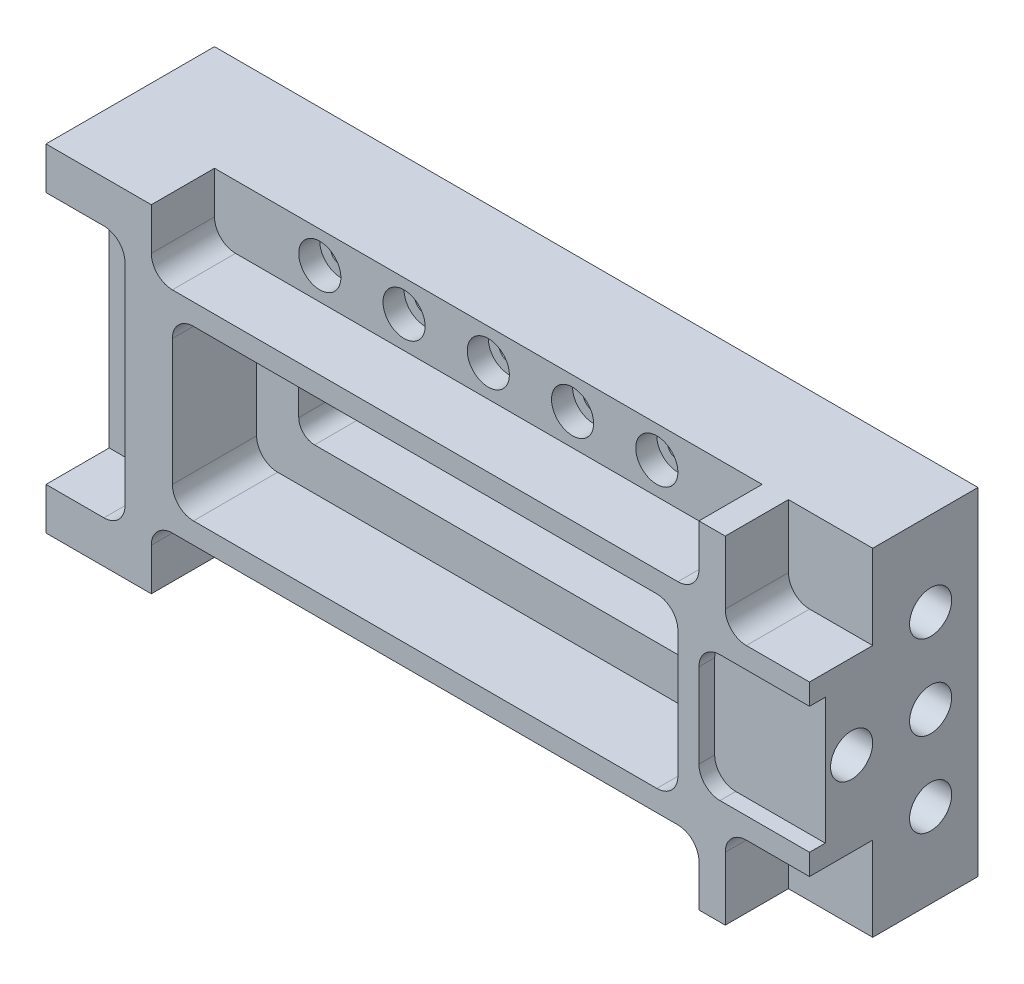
ISO-10303-21;
HEADER;
FILE_DESCRIPTION(('STEP AP214'),'2;1');
FILE_NAME('part.step','',(''),(''),'','','');
FILE_SCHEMA(('AUTOMOTIVE_DESIGN { 1 0 10303 214 1 1 1 1 }'));
ENDSEC;
DATA;
#1=APPLICATION_CONTEXT('core data for automotive mechanical design processes');
#2=APPLICATION_PROTOCOL_DEFINITION('international standard','automotive_design',2000,#1);
#3=PRODUCT_CONTEXT('',#1,'mechanical');
#4=PRODUCT('Part','Part','',(#3));
#5=PRODUCT_RELATED_PRODUCT_CATEGORY('part','',(#4));
#6=PRODUCT_DEFINITION_FORMATION('','',#4);
#7=PRODUCT_DEFINITION_CONTEXT('part definition',#1,'design');
#8=PRODUCT_DEFINITION('design','',#6,#7);
#9=PRODUCT_DEFINITION_SHAPE('','',#8);
#10=(LENGTH_UNIT() NAMED_UNIT(*) SI_UNIT(.MILLI.,.METRE.));
#11=(NAMED_UNIT(*) PLANE_ANGLE_UNIT() SI_UNIT($,.RADIAN.));
#12=(NAMED_UNIT(*) SI_UNIT($,.STERADIAN.) SOLID_ANGLE_UNIT());
#13=UNCERTAINTY_MEASURE_WITH_UNIT(LENGTH_MEASURE(1.E-05),#10,'distance_accuracy_value','');
#14=(GEOMETRIC_REPRESENTATION_CONTEXT(3) GLOBAL_UNCERTAINTY_ASSIGNED_CONTEXT((#13)) GLOBAL_UNIT_ASSIGNED_CONTEXT((#10,
#11,#12)) REPRESENTATION_CONTEXT('',''));
#15=CARTESIAN_POINT('',(0.,0.,0.));
#16=DIRECTION('',(0.,0.,1.));
#17=DIRECTION('',(1.,0.,0.));
#18=AXIS2_PLACEMENT_3D('',#15,#16,#17);
#19=CARTESIAN_POINT('',(50.8,-41.275,0.));
#20=DIRECTION('',(0.,0.,1.));
#21=DIRECTION('',(1.,0.,0.));
#22=AXIS2_PLACEMENT_3D('',#19,#20,#21);
#23=CYLINDRICAL_SURFACE('',#22,3.175);
#24=CARTESIAN_POINT('',(50.8,-41.275,0.));
#25=DIRECTION('',(0.,0.,1.));
#26=DIRECTION('',(1.,0.,0.));
#27=AXIS2_PLACEMENT_3D('',#24,#25,#26);
#28=CIRCLE('',#27,3.175);
#29=CARTESIAN_POINT('',(53.975,-41.275,0.));
#30=VERTEX_POINT('',#29);
#31=EDGE_CURVE('E852',#30,#30,#28,.T.);
#32=ORIENTED_EDGE('',*,*,#31,.F.);
#33=EDGE_LOOP('',(#32));
#34=FACE_BOUND('',#33,.T.);
#35=CARTESIAN_POINT('',(50.8,-41.275,25.4));
#36=DIRECTION('',(0.,0.,1.));
#37=DIRECTION('',(1.,0.,0.));
#38=AXIS2_PLACEMENT_3D('',#35,#36,#37);
#39=CIRCLE('',#38,3.175);
#40=CARTESIAN_POINT('',(53.975,-41.275,25.4));
#41=VERTEX_POINT('',#40);
#42=EDGE_CURVE('E767',#41,#41,#39,.F.);
#43=ORIENTED_EDGE('',*,*,#42,.F.);
#44=EDGE_LOOP('',(#43));
#45=FACE_BOUND('',#44,.T.);
#46=ADVANCED_FACE('F380',(#34,#45),#23,.F.);
#47=CARTESIAN_POINT('',(25.4,-41.275,0.));
#48=DIRECTION('',(0.,0.,1.));
#49=DIRECTION('',(1.,0.,0.));
#50=AXIS2_PLACEMENT_3D('',#47,#48,#49);
#51=CYLINDRICAL_SURFACE('',#50,3.175);
#52=CARTESIAN_POINT('',(25.4,-41.275,0.));
#53=DIRECTION('',(0.,0.,1.));
#54=DIRECTION('',(1.,0.,0.));
#55=AXIS2_PLACEMENT_3D('',#52,#53,#54);
#56=CIRCLE('',#55,3.175);
#57=CARTESIAN_POINT('',(28.575,-41.275,0.));
#58=VERTEX_POINT('',#57);
#59=EDGE_CURVE('E855',#58,#58,#56,.T.);
#60=ORIENTED_EDGE('',*,*,#59,.F.);
#61=EDGE_LOOP('',(#60));
#62=FACE_BOUND('',#61,.T.);
#63=CARTESIAN_POINT('',(25.4,-41.275,25.4));
#64=DIRECTION('',(0.,0.,1.));
#65=DIRECTION('',(1.,0.,0.));
#66=AXIS2_PLACEMENT_3D('',#63,#64,#65);
#67=CIRCLE('',#66,3.175);
#68=CARTESIAN_POINT('',(28.575,-41.275,25.4));
#69=VERTEX_POINT('',#68);
#70=EDGE_CURVE('E774',#69,#69,#67,.F.);
#71=ORIENTED_EDGE('',*,*,#70,.F.);
#72=EDGE_LOOP('',(#71));
#73=FACE_BOUND('',#72,.T.);
#74=ADVANCED_FACE('F1404',(#62,#73),#51,.F.);
#75=CARTESIAN_POINT('',(0.,-41.275,0.));
#76=DIRECTION('',(0.,0.,1.));
#77=DIRECTION('',(1.,0.,0.));
#78=AXIS2_PLACEMENT_3D('',#75,#76,#77);
#79=CYLINDRICAL_SURFACE('',#78,3.175);
#80=CARTESIAN_POINT('',(0.,-41.275,0.));
#81=DIRECTION('',(0.,0.,1.));
#82=DIRECTION('',(1.,0.,0.));
#83=AXIS2_PLACEMENT_3D('',#80,#81,#82);
#84=CIRCLE('',#83,3.175);
#85=CARTESIAN_POINT('',(3.175,-41.275,0.));
#86=VERTEX_POINT('',#85);
#87=EDGE_CURVE('E858',#86,#86,#84,.T.);
#88=ORIENTED_EDGE('',*,*,#87,.F.);
#89=EDGE_LOOP('',(#88));
#90=FACE_BOUND('',#89,.T.);
#91=CARTESIAN_POINT('',(0.,-41.275,25.4));
#92=DIRECTION('',(0.,0.,1.));
#93=DIRECTION('',(1.,0.,0.));
#94=AXIS2_PLACEMENT_3D('',#91,#92,#93);
#95=CIRCLE('',#94,3.175);
#96=CARTESIAN_POINT('',(3.175,-41.275,25.4));
#97=VERTEX_POINT('',#96);
#98=EDGE_CURVE('E781',#97,#97,#95,.F.);
#99=ORIENTED_EDGE('',*,*,#98,.F.);
#100=EDGE_LOOP('',(#99));
#101=FACE_BOUND('',#100,.T.);
#102=ADVANCED_FACE('F1410',(#90,#101),#79,.F.);
#103=CARTESIAN_POINT('',(-25.4,-41.275,0.));
#104=DIRECTION('',(0.,0.,1.));
#105=DIRECTION('',(1.,0.,0.));
#106=AXIS2_PLACEMENT_3D('',#103,#104,#105);
#107=CYLINDRICAL_SURFACE('',#106,3.175);
#108=CARTESIAN_POINT('',(-25.4,-41.275,0.));
#109=DIRECTION('',(0.,0.,1.));
#110=DIRECTION('',(1.,0.,0.));
#111=AXIS2_PLACEMENT_3D('',#108,#109,#110);
#112=CIRCLE('',#111,3.175);
#113=CARTESIAN_POINT('',(-22.225,-41.275,0.));
#114=VERTEX_POINT('',#113);
#115=EDGE_CURVE('E849',#114,#114,#112,.T.);
#116=ORIENTED_EDGE('',*,*,#115,.F.);
#117=EDGE_LOOP('',(#116));
#118=FACE_BOUND('',#117,.T.);
#119=CARTESIAN_POINT('',(-25.4,-41.275,25.4));
#120=DIRECTION('',(0.,0.,1.));
#121=DIRECTION('',(1.,0.,0.));
#122=AXIS2_PLACEMENT_3D('',#119,#120,#121);
#123=CIRCLE('',#122,3.175);
#124=CARTESIAN_POINT('',(-22.225,-41.275,25.4));
#125=VERTEX_POINT('',#124);
#126=EDGE_CURVE('E788',#125,#125,#123,.F.);
#127=ORIENTED_EDGE('',*,*,#126,.F.);
#128=EDGE_LOOP('',(#127));
#129=FACE_BOUND('',#128,.T.);
#130=ADVANCED_FACE('F1415',(#118,#129),#107,.F.);
#131=CARTESIAN_POINT('',(-50.8,-41.275,0.));
#132=DIRECTION('',(0.,0.,1.));
#133=DIRECTION('',(1.,0.,0.));
#134=AXIS2_PLACEMENT_3D('',#131,#132,#133);
#135=CYLINDRICAL_SURFACE('',#134,3.175);
#136=CARTESIAN_POINT('',(-50.8,-41.275,0.));
#137=DIRECTION('',(0.,0.,1.));
#138=DIRECTION('',(1.,0.,0.));
#139=AXIS2_PLACEMENT_3D('',#136,#137,#138);
#140=CIRCLE('',#139,3.175);
#141=CARTESIAN_POINT('',(-47.625,-41.275,0.));
#142=VERTEX_POINT('',#141);
#143=EDGE_CURVE('E846',#142,#142,#140,.T.);
#144=ORIENTED_EDGE('',*,*,#143,.F.);
#145=EDGE_LOOP('',(#144));
#146=FACE_BOUND('',#145,.T.);
#147=CARTESIAN_POINT('',(-50.8,-41.275,25.4));
#148=DIRECTION('',(0.,0.,1.));
#149=DIRECTION('',(1.,0.,0.));
#150=AXIS2_PLACEMENT_3D('',#147,#148,#149);
#151=CIRCLE('',#150,3.175);
#152=CARTESIAN_POINT('',(-47.625,-41.275,25.4));
#153=VERTEX_POINT('',#152);
#154=EDGE_CURVE('E795',#153,#153,#151,.F.);
#155=ORIENTED_EDGE('',*,*,#154,.F.);
#156=EDGE_LOOP('',(#155));
#157=FACE_BOUND('',#156,.T.);
#158=ADVANCED_FACE('F1938',(#146,#157),#135,.F.);
#159=CARTESIAN_POINT('',(50.8,41.275,0.));
#160=DIRECTION('',(0.,0.,1.));
#161=DIRECTION('',(1.,0.,0.));
#162=AXIS2_PLACEMENT_3D('',#159,#160,#161);
#163=CYLINDRICAL_SURFACE('',#162,3.17500000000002);
#164=CARTESIAN_POINT('',(50.8,41.275,0.));
#165=DIRECTION('',(0.,0.,1.));
#166=DIRECTION('',(1.,0.,0.));
#167=AXIS2_PLACEMENT_3D('',#164,#165,#166);
#168=CIRCLE('',#167,3.17500000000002);
#169=CARTESIAN_POINT('',(53.975,41.275,0.));
#170=VERTEX_POINT('',#169);
#171=EDGE_CURVE('E837',#170,#170,#168,.T.);
#172=ORIENTED_EDGE('',*,*,#171,.F.);
#173=EDGE_LOOP('',(#172));
#174=FACE_BOUND('',#173,.T.);
#175=CARTESIAN_POINT('',(50.8,41.275,25.4));
#176=DIRECTION('',(0.,0.,1.));
#177=DIRECTION('',(1.,0.,0.));
#178=AXIS2_PLACEMENT_3D('',#175,#176,#177);
#179=CIRCLE('',#178,3.17500000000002);
#180=CARTESIAN_POINT('',(53.975,41.275,25.4));
#181=VERTEX_POINT('',#180);
#182=EDGE_CURVE('E802',#181,#181,#179,.F.);
#183=ORIENTED_EDGE('',*,*,#182,.F.);
#184=EDGE_LOOP('',(#183));
#185=FACE_BOUND('',#184,.T.);
#186=ADVANCED_FACE('F1934',(#174,#185),#163,.F.);
#187=CARTESIAN_POINT('',(25.4,41.275,0.));
#188=DIRECTION('',(0.,0.,1.));
#189=DIRECTION('',(1.,0.,0.));
#190=AXIS2_PLACEMENT_3D('',#187,#188,#189);
#191=CYLINDRICAL_SURFACE('',#190,3.17499999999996);
#192=CARTESIAN_POINT('',(25.4,41.275,0.));
#193=DIRECTION('',(0.,0.,1.));
#194=DIRECTION('',(1.,0.,0.));
#195=AXIS2_PLACEMENT_3D('',#192,#193,#194);
#196=CIRCLE('',#195,3.17499999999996);
#197=CARTESIAN_POINT('',(28.575,41.275,0.));
#198=VERTEX_POINT('',#197);
#199=EDGE_CURVE('E840',#198,#198,#196,.T.);
#200=ORIENTED_EDGE('',*,*,#199,.F.);
#201=EDGE_LOOP('',(#200));
#202=FACE_BOUND('',#201,.T.);
#203=CARTESIAN_POINT('',(25.4,41.275,25.4));
#204=DIRECTION('',(0.,0.,1.));
#205=DIRECTION('',(1.,0.,0.));
#206=AXIS2_PLACEMENT_3D('',#203,#204,#205);
#207=CIRCLE('',#206,3.17499999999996);
#208=CARTESIAN_POINT('',(28.575,41.275,25.4));
#209=VERTEX_POINT('',#208);
#210=EDGE_CURVE('E809',#209,#209,#207,.F.);
#211=ORIENTED_EDGE('',*,*,#210,.F.);
#212=EDGE_LOOP('',(#211));
#213=FACE_BOUND('',#212,.T.);
#214=ADVANCED_FACE('F1937',(#202,#213),#191,.F.);
#215=CARTESIAN_POINT('',(0.,41.275,0.));
#216=DIRECTION('',(0.,0.,1.));
#217=DIRECTION('',(1.,0.,0.));
#218=AXIS2_PLACEMENT_3D('',#215,#216,#217);
#219=CYLINDRICAL_SURFACE('',#218,3.175);
#220=CARTESIAN_POINT('',(0.,41.275,0.));
#221=DIRECTION('',(0.,0.,1.));
#222=DIRECTION('',(1.,0.,0.));
#223=AXIS2_PLACEMENT_3D('',#220,#221,#222);
#224=CIRCLE('',#223,3.175);
#225=CARTESIAN_POINT('',(3.175,41.275,0.));
#226=VERTEX_POINT('',#225);
#227=EDGE_CURVE('E843',#226,#226,#224,.T.);
#228=ORIENTED_EDGE('',*,*,#227,.F.);
#229=EDGE_LOOP('',(#228));
#230=FACE_BOUND('',#229,.T.);
#231=CARTESIAN_POINT('',(0.,41.275,25.4));
#232=DIRECTION('',(0.,0.,1.));
#233=DIRECTION('',(1.,0.,0.));
#234=AXIS2_PLACEMENT_3D('',#231,#232,#233);
#235=CIRCLE('',#234,3.175);
#236=CARTESIAN_POINT('',(3.175,41.275,25.4));
#237=VERTEX_POINT('',#236);
#238=EDGE_CURVE('E816',#237,#237,#235,.F.);
#239=ORIENTED_EDGE('',*,*,#238,.F.);
#240=EDGE_LOOP('',(#239));
#241=FACE_BOUND('',#240,.T.);
#242=ADVANCED_FACE('F1932',(#230,#241),#219,.F.);
#243=CARTESIAN_POINT('',(-25.4,41.275,0.));
#244=DIRECTION('',(0.,0.,1.));
#245=DIRECTION('',(1.,0.,0.));
#246=AXIS2_PLACEMENT_3D('',#243,#244,#245);
#247=CYLINDRICAL_SURFACE('',#246,3.17500000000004);
#248=CARTESIAN_POINT('',(-25.4,41.275,0.));
#249=DIRECTION('',(0.,0.,1.));
#250=DIRECTION('',(1.,0.,0.));
#251=AXIS2_PLACEMENT_3D('',#248,#249,#250);
#252=CIRCLE('',#251,3.17500000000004);
#253=CARTESIAN_POINT('',(-22.225,41.275,0.));
#254=VERTEX_POINT('',#253);
#255=EDGE_CURVE('E834',#254,#254,#252,.T.);
#256=ORIENTED_EDGE('',*,*,#255,.F.);
#257=EDGE_LOOP('',(#256));
#258=FACE_BOUND('',#257,.T.);
#259=CARTESIAN_POINT('',(-25.4,41.275,25.4));
#260=DIRECTION('',(0.,0.,1.));
#261=DIRECTION('',(1.,0.,0.));
#262=AXIS2_PLACEMENT_3D('',#259,#260,#261);
#263=CIRCLE('',#262,3.17500000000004);
#264=CARTESIAN_POINT('',(-22.225,41.275,25.4));
#265=VERTEX_POINT('',#264);
#266=EDGE_CURVE('E823',#265,#265,#263,.F.);
#267=ORIENTED_EDGE('',*,*,#266,.F.);
#268=EDGE_LOOP('',(#267));
#269=FACE_BOUND('',#268,.T.);
#270=ADVANCED_FACE('F1928',(#258,#269),#247,.F.);
#271=CARTESIAN_POINT('',(-50.8,41.275,0.));
#272=DIRECTION('',(0.,0.,1.));
#273=DIRECTION('',(1.,0.,0.));
#274=AXIS2_PLACEMENT_3D('',#271,#272,#273);
#275=CYLINDRICAL_SURFACE('',#274,3.17499999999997);
#276=CARTESIAN_POINT('',(-50.8,41.275,0.));
#277=DIRECTION('',(0.,0.,1.));
#278=DIRECTION('',(1.,0.,0.));
#279=AXIS2_PLACEMENT_3D('',#276,#277,#278);
#280=CIRCLE('',#279,3.17499999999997);
#281=CARTESIAN_POINT('',(-47.625,41.275,0.));
#282=VERTEX_POINT('',#281);
#283=EDGE_CURVE('E831',#282,#282,#280,.T.);
#284=ORIENTED_EDGE('',*,*,#283,.F.);
#285=EDGE_LOOP('',(#284));
#286=FACE_BOUND('',#285,.T.);
#287=CARTESIAN_POINT('',(-50.8,41.275,25.4));
#288=DIRECTION('',(0.,0.,1.));
#289=DIRECTION('',(1.,0.,0.));
#290=AXIS2_PLACEMENT_3D('',#287,#288,#289);
#291=CIRCLE('',#290,3.17499999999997);
#292=CARTESIAN_POINT('',(-47.625,41.275,25.4));
#293=VERTEX_POINT('',#292);
#294=EDGE_CURVE('E830',#293,#293,#291,.F.);
#295=ORIENTED_EDGE('',*,*,#294,.F.);
#296=EDGE_LOOP('',(#295));
#297=FACE_BOUND('',#296,.T.);
#298=ADVANCED_FACE('F1756',(#286,#297),#275,.F.);
#299=CARTESIAN_POINT('',(-114.3,50.8,50.8));
#300=DIRECTION('',(1.,0.,0.));
#301=DIRECTION('',(0.,0.,-1.));
#302=AXIS2_PLACEMENT_3D('',#299,#300,#301);
#303=PLANE('',#302);
#304=CARTESIAN_POINT('',(-114.3,-25.4,14.2875));
#305=DIRECTION('',(1.,0.,0.));
#306=DIRECTION('',(0.,0.,-1.));
#307=AXIS2_PLACEMENT_3D('',#304,#305,#306);
#308=CIRCLE('',#307,7.92480000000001);
#309=CARTESIAN_POINT('',(-114.3,-25.4,6.36269999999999));
#310=VERTEX_POINT('',#309);
#311=EDGE_CURVE('E1362',#310,#310,#308,.T.);
#312=ORIENTED_EDGE('',*,*,#311,.T.);
#313=EDGE_LOOP('',(#312));
#314=FACE_BOUND('',#313,.T.);
#315=CARTESIAN_POINT('',(-114.3,25.4,14.2875));
#316=DIRECTION('',(1.,0.,0.));
#317=DIRECTION('',(0.,0.,-1.));
#318=AXIS2_PLACEMENT_3D('',#315,#316,#317);
#319=CIRCLE('',#318,7.92480000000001);
#320=CARTESIAN_POINT('',(-114.3,25.4,6.36269999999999));
#321=VERTEX_POINT('',#320);
#322=EDGE_CURVE('E1359',#321,#321,#319,.T.);
#323=ORIENTED_EDGE('',*,*,#322,.T.);
#324=EDGE_LOOP('',(#323));
#325=FACE_BOUND('',#324,.T.);
#326=CARTESIAN_POINT('',(-114.3,0.,14.2875));
#327=DIRECTION('',(1.,0.,0.));
#328=DIRECTION('',(0.,0.,-1.));
#329=AXIS2_PLACEMENT_3D('',#326,#327,#328);
#330=CIRCLE('',#329,7.92480000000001);
#331=CARTESIAN_POINT('',(-114.3,0.,6.36269999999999));
#332=VERTEX_POINT('',#331);
#333=EDGE_CURVE('E1356',#332,#332,#330,.T.);
#334=ORIENTED_EDGE('',*,*,#333,.T.);
#335=EDGE_LOOP('',(#334));
#336=FACE_BOUND('',#335,.T.);
#337=DIRECTION('',(0.,1.,0.));
#338=VECTOR('',#337,1.);
#339=CARTESIAN_POINT('',(-114.3,50.8,31.75));
#340=LINE('',#339,#338);
#341=CARTESIAN_POINT('',(-114.3,-38.1,31.75));
#342=VERTEX_POINT('',#341);
#343=CARTESIAN_POINT('',(-114.3,38.1,31.75));
#344=VERTEX_POINT('',#343);
#345=EDGE_CURVE('E1350',#342,#344,#340,.T.);
#346=ORIENTED_EDGE('',*,*,#345,.T.);
#347=DIRECTION('',(0.,0.,1.));
#348=VECTOR('',#347,1.);
#349=CARTESIAN_POINT('',(-114.3,38.1,50.8));
#350=LINE('',#349,#348);
#351=CARTESIAN_POINT('',(-114.3,38.1,50.8));
#352=VERTEX_POINT('',#351);
#353=EDGE_CURVE('E1180',#344,#352,#350,.T.);
#354=ORIENTED_EDGE('',*,*,#353,.T.);
#355=DIRECTION('',(0.,-1.,0.));
#356=VECTOR('',#355,1.);
#357=CARTESIAN_POINT('',(-114.3,50.8,50.8));
#358=LINE('',#357,#356);
#359=CARTESIAN_POINT('',(-114.3,50.8,50.8));
#360=VERTEX_POINT('',#359);
#361=EDGE_CURVE('E1314',#360,#352,#358,.T.);
#362=ORIENTED_EDGE('',*,*,#361,.F.);
#363=DIRECTION('',(0.,0.,-1.));
#364=VECTOR('',#363,1.);
#365=CARTESIAN_POINT('',(-114.3,50.8,50.8));
#366=LINE('',#365,#364);
#367=CARTESIAN_POINT('',(-114.3,50.8,0.));
#368=VERTEX_POINT('',#367);
#369=EDGE_CURVE('E1329',#360,#368,#366,.T.);
#370=ORIENTED_EDGE('',*,*,#369,.T.);
#371=DIRECTION('',(0.,-1.,0.));
#372=VECTOR('',#371,1.);
#373=CARTESIAN_POINT('',(-114.3,50.8,0.));
#374=LINE('',#373,#372);
#375=CARTESIAN_POINT('',(-114.3,-50.8,0.));
#376=VERTEX_POINT('',#375);
#377=EDGE_CURVE('E1288',#368,#376,#374,.T.);
#378=ORIENTED_EDGE('',*,*,#377,.T.);
#379=DIRECTION('',(0.,0.,-1.));
#380=VECTOR('',#379,1.);
#381=CARTESIAN_POINT('',(-114.3,-50.8,50.8));
#382=LINE('',#381,#380);
#383=CARTESIAN_POINT('',(-114.3,-50.8,50.8));
#384=VERTEX_POINT('',#383);
#385=EDGE_CURVE('E1336',#384,#376,#382,.T.);
#386=ORIENTED_EDGE('',*,*,#385,.F.);
#387=CARTESIAN_POINT('',(-114.3,-38.1,50.8));
#388=VERTEX_POINT('',#387);
#389=EDGE_CURVE('E1313',#388,#384,#358,.T.);
#390=ORIENTED_EDGE('',*,*,#389,.F.);
#391=DIRECTION('',(0.,0.,-1.));
#392=VECTOR('',#391,1.);
#393=CARTESIAN_POINT('',(-114.3,-38.1,50.8));
#394=LINE('',#393,#392);
#395=EDGE_CURVE('E1171',#388,#342,#394,.T.);
#396=ORIENTED_EDGE('',*,*,#395,.T.);
#397=EDGE_LOOP('',(#346,#354,#362,#370,#378,#386,#390,#396));
#398=FACE_BOUND('',#397,.T.);
#399=ADVANCED_FACE('F382',(#314,#325,#336,#398),#303,.F.);
#400=CARTESIAN_POINT('',(-114.3,-50.8,50.8));
#401=DIRECTION('',(0.,1.,0.));
#402=DIRECTION('',(0.,0.,1.));
#403=AXIS2_PLACEMENT_3D('',#400,#401,#402);
#404=PLANE('',#403);
#405=DIRECTION('',(1.,0.,0.));
#406=VECTOR('',#405,1.);
#407=CARTESIAN_POINT('',(-114.3,-50.8,31.75));
#408=LINE('',#407,#406);
#409=CARTESIAN_POINT('',(-82.55,-50.8,31.75));
#410=VERTEX_POINT('',#409);
#411=CARTESIAN_POINT('',(82.55,-50.8,31.75));
#412=VERTEX_POINT('',#411);
#413=EDGE_CURVE('E716',#410,#412,#408,.T.);
#414=ORIENTED_EDGE('',*,*,#413,.F.);
#415=DIRECTION('',(0.,0.,1.));
#416=VECTOR('',#415,1.);
#417=CARTESIAN_POINT('',(-82.55,-50.8,50.8));
#418=LINE('',#417,#416);
#419=CARTESIAN_POINT('',(-82.55,-50.8,50.8));
#420=VERTEX_POINT('',#419);
#421=EDGE_CURVE('E896',#410,#420,#418,.T.);
#422=ORIENTED_EDGE('',*,*,#421,.T.);
#423=DIRECTION('',(1.,0.,0.));
#424=VECTOR('',#423,1.);
#425=CARTESIAN_POINT('',(-114.3,-50.8,50.8));
#426=LINE('',#425,#424);
#427=EDGE_CURVE('E1318',#384,#420,#426,.T.);
#428=ORIENTED_EDGE('',*,*,#427,.F.);
#429=ORIENTED_EDGE('',*,*,#385,.T.);
#430=DIRECTION('',(1.,0.,0.));
#431=VECTOR('',#430,1.);
#432=CARTESIAN_POINT('',(-114.3,-50.8,0.));
#433=LINE('',#432,#431);
#434=CARTESIAN_POINT('',(115.8875,-50.8,0.));
#435=VERTEX_POINT('',#434);
#436=EDGE_CURVE('E1305',#376,#435,#433,.T.);
#437=ORIENTED_EDGE('',*,*,#436,.T.);
#438=DIRECTION('',(0.,0.,-1.));
#439=VECTOR('',#438,1.);
#440=CARTESIAN_POINT('',(115.8875,-50.8,50.8));
#441=LINE('',#440,#439);
#442=CARTESIAN_POINT('',(115.8875,-50.8,31.75));
#443=VERTEX_POINT('',#442);
#444=EDGE_CURVE('E1334',#443,#435,#441,.T.);
#445=ORIENTED_EDGE('',*,*,#444,.F.);
#446=DIRECTION('',(-1.,0.,0.));
#447=VECTOR('',#446,1.);
#448=CARTESIAN_POINT('',(-114.3,-50.8,31.75));
#449=LINE('',#448,#447);
#450=CARTESIAN_POINT('',(90.4875,-50.8,31.75));
#451=VERTEX_POINT('',#450);
#452=EDGE_CURVE('E1208',#443,#451,#449,.T.);
#453=ORIENTED_EDGE('',*,*,#452,.T.);
#454=DIRECTION('',(0.,0.,1.));
#455=VECTOR('',#454,1.);
#456=CARTESIAN_POINT('',(90.4875,-50.8,50.8));
#457=LINE('',#456,#455);
#458=CARTESIAN_POINT('',(90.4875,-50.8,50.8));
#459=VERTEX_POINT('',#458);
#460=EDGE_CURVE('E1205',#451,#459,#457,.T.);
#461=ORIENTED_EDGE('',*,*,#460,.T.);
#462=CARTESIAN_POINT('',(82.5499999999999,-50.8,50.8));
#463=VERTEX_POINT('',#462);
#464=EDGE_CURVE('E1317',#463,#459,#426,.T.);
#465=ORIENTED_EDGE('',*,*,#464,.F.);
#466=DIRECTION('',(0.,0.,-1.));
#467=VECTOR('',#466,1.);
#468=CARTESIAN_POINT('',(82.55,-50.8,50.8));
#469=LINE('',#468,#467);
#470=EDGE_CURVE('E403',#463,#412,#469,.T.);
#471=ORIENTED_EDGE('',*,*,#470,.T.);
#472=EDGE_LOOP('',(#414,#422,#428,#429,#437,#445,#453,#461,#465,#471));
#473=FACE_BOUND('',#472,.T.);
#474=ADVANCED_FACE('F1749',(#473),#404,.F.);
#475=CARTESIAN_POINT('',(115.8875,50.8,50.8));
#476=DIRECTION('',(-1.,0.,0.));
#477=DIRECTION('',(0.,0.,1.));
#478=AXIS2_PLACEMENT_3D('',#475,#476,#477);
#479=PLANE('',#478);
#480=CARTESIAN_POINT('',(115.8875,-25.4,14.2875));
#481=DIRECTION('',(1.,0.,0.));
#482=DIRECTION('',(0.,0.,-1.));
#483=AXIS2_PLACEMENT_3D('',#480,#481,#482);
#484=CIRCLE('',#483,6.35);
#485=CARTESIAN_POINT('',(115.8875,-25.4,7.9375));
#486=VERTEX_POINT('',#485);
#487=EDGE_CURVE('E1096',#486,#486,#484,.T.);
#488=ORIENTED_EDGE('',*,*,#487,.F.);
#489=EDGE_LOOP('',(#488));
#490=FACE_BOUND('',#489,.T.);
#491=CARTESIAN_POINT('',(115.8875,25.4,14.2875));
#492=DIRECTION('',(1.,0.,0.));
#493=DIRECTION('',(0.,0.,-1.));
#494=AXIS2_PLACEMENT_3D('',#491,#492,#493);
#495=CIRCLE('',#494,6.35);
#496=CARTESIAN_POINT('',(115.8875,25.4,7.9375));
#497=VERTEX_POINT('',#496);
#498=EDGE_CURVE('E1116',#497,#497,#495,.T.);
#499=ORIENTED_EDGE('',*,*,#498,.F.);
#500=EDGE_LOOP('',(#499));
#501=FACE_BOUND('',#500,.T.);
#502=CARTESIAN_POINT('',(115.8875,0.,14.2875));
#503=DIRECTION('',(1.,0.,0.));
#504=DIRECTION('',(0.,0.,-1.));
#505=AXIS2_PLACEMENT_3D('',#502,#503,#504);
#506=CIRCLE('',#505,6.35);
#507=CARTESIAN_POINT('',(115.8875,0.,7.9375));
#508=VERTEX_POINT('',#507);
#509=EDGE_CURVE('E1122',#508,#508,#506,.T.);
#510=ORIENTED_EDGE('',*,*,#509,.F.);
#511=EDGE_LOOP('',(#510));
#512=FACE_BOUND('',#511,.T.);
#513=CARTESIAN_POINT('',(115.8875,0.,38.1));
#514=DIRECTION('',(1.,0.,0.));
#515=DIRECTION('',(0.,0.,-1.));
#516=AXIS2_PLACEMENT_3D('',#513,#514,#515);
#517=CIRCLE('',#516,6.35);
#518=CARTESIAN_POINT('',(115.8875,0.,31.75));
#519=VERTEX_POINT('',#518);
#520=EDGE_CURVE('E1128',#519,#519,#517,.T.);
#521=ORIENTED_EDGE('',*,*,#520,.F.);
#522=EDGE_LOOP('',(#521));
#523=FACE_BOUND('',#522,.T.);
#524=DIRECTION('',(0.,-1.,0.));
#525=VECTOR('',#524,1.);
#526=CARTESIAN_POINT('',(115.8875,50.8,46.0502));
#527=LINE('',#526,#525);
#528=CARTESIAN_POINT('',(115.8875,19.05,46.0502));
#529=VERTEX_POINT('',#528);
#530=CARTESIAN_POINT('',(115.8875,-19.05,46.0502));
#531=VERTEX_POINT('',#530);
#532=EDGE_CURVE('E11',#529,#531,#527,.T.);
#533=ORIENTED_EDGE('',*,*,#532,.T.);
#534=DIRECTION('',(0.,0.,1.));
#535=VECTOR('',#534,1.);
#536=CARTESIAN_POINT('',(115.8875,-19.05,50.8));
#537=LINE('',#536,#535);
#538=CARTESIAN_POINT('',(115.8875,-19.05,50.8));
#539=VERTEX_POINT('',#538);
#540=EDGE_CURVE('E758',#531,#539,#537,.T.);
#541=ORIENTED_EDGE('',*,*,#540,.T.);
#542=DIRECTION('',(0.,1.,0.));
#543=VECTOR('',#542,1.);
#544=CARTESIAN_POINT('',(115.8875,50.8,50.8));
#545=LINE('',#544,#543);
#546=CARTESIAN_POINT('',(115.8875,-25.4,50.8));
#547=VERTEX_POINT('',#546);
#548=EDGE_CURVE('E1322',#547,#539,#545,.T.);
#549=ORIENTED_EDGE('',*,*,#548,.F.);
#550=DIRECTION('',(0.,0.,-1.));
#551=VECTOR('',#550,1.);
#552=CARTESIAN_POINT('',(115.8875,-25.4,50.8));
#553=LINE('',#552,#551);
#554=CARTESIAN_POINT('',(115.8875,-25.4,31.75));
#555=VERTEX_POINT('',#554);
#556=EDGE_CURVE('E1200',#547,#555,#553,.T.);
#557=ORIENTED_EDGE('',*,*,#556,.T.);
#558=DIRECTION('',(0.,-1.,0.));
#559=VECTOR('',#558,1.);
#560=CARTESIAN_POINT('',(115.8875,50.8,31.75));
#561=LINE('',#560,#559);
#562=EDGE_CURVE('E1345',#555,#443,#561,.T.);
#563=ORIENTED_EDGE('',*,*,#562,.T.);
#564=ORIENTED_EDGE('',*,*,#444,.T.);
#565=DIRECTION('',(0.,1.,0.));
#566=VECTOR('',#565,1.);
#567=CARTESIAN_POINT('',(115.8875,50.8,0.));
#568=LINE('',#567,#566);
#569=CARTESIAN_POINT('',(115.8875,50.8,0.));
#570=VERTEX_POINT('',#569);
#571=EDGE_CURVE('E1308',#435,#570,#568,.T.);
#572=ORIENTED_EDGE('',*,*,#571,.T.);
#573=DIRECTION('',(0.,0.,-1.));
#574=VECTOR('',#573,1.);
#575=CARTESIAN_POINT('',(115.8875,50.8,50.8));
#576=LINE('',#575,#574);
#577=CARTESIAN_POINT('',(115.8875,50.8,31.75));
#578=VERTEX_POINT('',#577);
#579=EDGE_CURVE('E1332',#578,#570,#576,.T.);
#580=ORIENTED_EDGE('',*,*,#579,.F.);
#581=DIRECTION('',(0.,1.,0.));
#582=VECTOR('',#581,1.);
#583=CARTESIAN_POINT('',(115.8875,50.8,31.75));
#584=LINE('',#583,#582);
#585=CARTESIAN_POINT('',(115.8875,25.4,31.75));
#586=VERTEX_POINT('',#585);
#587=EDGE_CURVE('E1236',#586,#578,#584,.T.);
#588=ORIENTED_EDGE('',*,*,#587,.F.);
#589=DIRECTION('',(0.,0.,1.));
#590=VECTOR('',#589,1.);
#591=CARTESIAN_POINT('',(115.8875,25.4,50.8));
#592=LINE('',#591,#590);
#593=CARTESIAN_POINT('',(115.8875,25.4,50.8));
#594=VERTEX_POINT('',#593);
#595=EDGE_CURVE('E1233',#586,#594,#592,.T.);
#596=ORIENTED_EDGE('',*,*,#595,.T.);
#597=CARTESIAN_POINT('',(115.8875,19.05,50.8));
#598=VERTEX_POINT('',#597);
#599=EDGE_CURVE('E1321',#598,#594,#545,.T.);
#600=ORIENTED_EDGE('',*,*,#599,.F.);
#601=DIRECTION('',(0.,0.,-1.));
#602=VECTOR('',#601,1.);
#603=CARTESIAN_POINT('',(115.8875,19.05,50.8));
#604=LINE('',#603,#602);
#605=EDGE_CURVE('E395',#598,#529,#604,.T.);
#606=ORIENTED_EDGE('',*,*,#605,.T.);
#607=EDGE_LOOP('',(#533,#541,#549,#557,#563,#564,#572,#580,#588,#596,#600,#606));
#608=FACE_BOUND('',#607,.T.);
#609=ADVANCED_FACE('F1746',(#490,#501,#512,#523,#608),#479,.F.);
#610=CARTESIAN_POINT('',(-114.3,50.8,50.8));
#611=DIRECTION('',(0.,-1.,0.));
#612=DIRECTION('',(0.,0.,-1.));
#613=AXIS2_PLACEMENT_3D('',#610,#611,#612);
#614=PLANE('',#613);
#615=DIRECTION('',(-1.,0.,0.));
#616=VECTOR('',#615,1.);
#617=CARTESIAN_POINT('',(-114.3,50.8,50.8));
#618=LINE('',#617,#616);
#619=CARTESIAN_POINT('',(-82.5500000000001,50.8,50.8));
#620=VERTEX_POINT('',#619);
#621=EDGE_CURVE('E1325',#620,#360,#618,.T.);
#622=ORIENTED_EDGE('',*,*,#621,.F.);
#623=DIRECTION('',(0.,0.,-1.));
#624=VECTOR('',#623,1.);
#625=CARTESIAN_POINT('',(-82.5500000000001,50.8,50.8));
#626=LINE('',#625,#624);
#627=CARTESIAN_POINT('',(-82.5500000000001,50.8,31.75));
#628=VERTEX_POINT('',#627);
#629=EDGE_CURVE('E935',#620,#628,#626,.T.);
#630=ORIENTED_EDGE('',*,*,#629,.T.);
#631=DIRECTION('',(1.,0.,0.));
#632=VECTOR('',#631,1.);
#633=CARTESIAN_POINT('',(-114.3,50.8,31.75));
#634=LINE('',#633,#632);
#635=CARTESIAN_POINT('',(82.5499999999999,50.8,31.75));
#636=VERTEX_POINT('',#635);
#637=EDGE_CURVE('E1374',#628,#636,#634,.T.);
#638=ORIENTED_EDGE('',*,*,#637,.T.);
#639=DIRECTION('',(0.,0.,1.));
#640=VECTOR('',#639,1.);
#641=CARTESIAN_POINT('',(82.5499999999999,50.8,50.8));
#642=LINE('',#641,#640);
#643=CARTESIAN_POINT('',(82.5499999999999,50.8,50.8));
#644=VERTEX_POINT('',#643);
#645=EDGE_CURVE('E927',#636,#644,#642,.T.);
#646=ORIENTED_EDGE('',*,*,#645,.T.);
#647=CARTESIAN_POINT('',(90.4875,50.8,50.8));
#648=VERTEX_POINT('',#647);
#649=EDGE_CURVE('E1326',#648,#644,#618,.T.);
#650=ORIENTED_EDGE('',*,*,#649,.F.);
#651=DIRECTION('',(0.,0.,-1.));
#652=VECTOR('',#651,1.);
#653=CARTESIAN_POINT('',(90.4875,50.8,50.8));
#654=LINE('',#653,#652);
#655=CARTESIAN_POINT('',(90.4875,50.8,31.75));
#656=VERTEX_POINT('',#655);
#657=EDGE_CURVE('E1228',#648,#656,#654,.T.);
#658=ORIENTED_EDGE('',*,*,#657,.T.);
#659=DIRECTION('',(-1.,0.,0.));
#660=VECTOR('',#659,1.);
#661=CARTESIAN_POINT('',(-114.3,50.8,31.75));
#662=LINE('',#661,#660);
#663=EDGE_CURVE('E1341',#578,#656,#662,.T.);
#664=ORIENTED_EDGE('',*,*,#663,.F.);
#665=ORIENTED_EDGE('',*,*,#579,.T.);
#666=DIRECTION('',(-1.,0.,0.));
#667=VECTOR('',#666,1.);
#668=CARTESIAN_POINT('',(-114.3,50.8,0.));
#669=LINE('',#668,#667);
#670=EDGE_CURVE('E1311',#570,#368,#669,.T.);
#671=ORIENTED_EDGE('',*,*,#670,.T.);
#672=ORIENTED_EDGE('',*,*,#369,.F.);
#673=EDGE_LOOP('',(#622,#630,#638,#646,#650,#658,#664,#665,#671,#672));
#674=FACE_BOUND('',#673,.T.);
#675=ADVANCED_FACE('F1743',(#674),#614,.F.);
#676=CARTESIAN_POINT('',(-114.3,-50.8,50.8));
#677=DIRECTION('',(0.,0.,1.));
#678=DIRECTION('',(1.,0.,0.));
#679=AXIS2_PLACEMENT_3D('',#676,#677,#678);
#680=PLANE('',#679);
#681=DIRECTION('',(1.,0.,0.));
#682=VECTOR('',#681,1.);
#683=CARTESIAN_POINT('',(88.9,-19.05,50.8));
#684=LINE('',#683,#682);
#685=CARTESIAN_POINT('',(88.9,-19.05,50.8));
#686=VERTEX_POINT('',#685);
#687=EDGE_CURVE('E739',#686,#539,#684,.T.);
#688=ORIENTED_EDGE('',*,*,#687,.F.);
#689=CARTESIAN_POINT('',(88.9,-12.7,50.8));
#690=DIRECTION('',(0.,0.,1.));
#691=DIRECTION('',(-1.,0.,0.));
#692=AXIS2_PLACEMENT_3D('',#689,#690,#691);
#693=CIRCLE('',#692,6.35);
#694=CARTESIAN_POINT('',(82.55,-12.7,50.8));
#695=VERTEX_POINT('',#694);
#696=EDGE_CURVE('E734',#695,#686,#693,.T.);
#697=ORIENTED_EDGE('',*,*,#696,.F.);
#698=DIRECTION('',(0.,-1.,0.));
#699=VECTOR('',#698,1.);
#700=CARTESIAN_POINT('',(82.55,12.7,50.8));
#701=LINE('',#700,#699);
#702=CARTESIAN_POINT('',(82.55,12.7,50.8));
#703=VERTEX_POINT('',#702);
#704=EDGE_CURVE('E732',#703,#695,#701,.T.);
#705=ORIENTED_EDGE('',*,*,#704,.F.);
#706=CARTESIAN_POINT('',(88.9,12.7,50.8));
#707=DIRECTION('',(0.,0.,1.));
#708=DIRECTION('',(-1.,0.,0.));
#709=AXIS2_PLACEMENT_3D('',#706,#707,#708);
#710=CIRCLE('',#709,6.35);
#711=CARTESIAN_POINT('',(88.9,19.05,50.8));
#712=VERTEX_POINT('',#711);
#713=EDGE_CURVE('E720',#712,#703,#710,.T.);
#714=ORIENTED_EDGE('',*,*,#713,.F.);
#715=DIRECTION('',(-1.,0.,0.));
#716=VECTOR('',#715,1.);
#717=CARTESIAN_POINT('',(-114.3,19.05,50.8));
#718=LINE('',#717,#716);
#719=EDGE_CURVE('E388',#598,#712,#718,.T.);
#720=ORIENTED_EDGE('',*,*,#719,.F.);
#721=ORIENTED_EDGE('',*,*,#599,.T.);
#722=DIRECTION('',(1.,0.,0.));
#723=VECTOR('',#722,1.);
#724=CARTESIAN_POINT('',(136.525,25.4,50.8));
#725=LINE('',#724,#723);
#726=CARTESIAN_POINT('',(96.8375,25.4,50.8));
#727=VERTEX_POINT('',#726);
#728=EDGE_CURVE('E1214',#727,#594,#725,.T.);
#729=ORIENTED_EDGE('',*,*,#728,.F.);
#730=CARTESIAN_POINT('',(96.8375,31.75,50.8));
#731=DIRECTION('',(0.,0.,1.));
#732=DIRECTION('',(1.,0.,0.));
#733=AXIS2_PLACEMENT_3D('',#730,#731,#732);
#734=CIRCLE('',#733,6.35);
#735=CARTESIAN_POINT('',(90.4875,31.75,50.8));
#736=VERTEX_POINT('',#735);
#737=EDGE_CURVE('E1211',#736,#727,#734,.T.);
#738=ORIENTED_EDGE('',*,*,#737,.F.);
#739=DIRECTION('',(0.,-1.,0.));
#740=VECTOR('',#739,1.);
#741=CARTESIAN_POINT('',(90.4875,-50.8,50.8));
#742=LINE('',#741,#740);
#743=EDGE_CURVE('E1339',#648,#736,#742,.T.);
#744=ORIENTED_EDGE('',*,*,#743,.F.);
#745=ORIENTED_EDGE('',*,*,#649,.T.);
#746=DIRECTION('',(0.,1.,0.));
#747=VECTOR('',#746,1.);
#748=CARTESIAN_POINT('',(82.5499999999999,63.5,50.8));
#749=LINE('',#748,#747);
#750=CARTESIAN_POINT('',(82.5499999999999,38.1,50.8));
#751=VERTEX_POINT('',#750);
#752=EDGE_CURVE('E908',#751,#644,#749,.T.);
#753=ORIENTED_EDGE('',*,*,#752,.F.);
#754=CARTESIAN_POINT('',(76.1999999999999,38.1,50.8));
#755=DIRECTION('',(0.,0.,1.));
#756=DIRECTION('',(-1.,0.,0.));
#757=AXIS2_PLACEMENT_3D('',#754,#755,#756);
#758=CIRCLE('',#757,6.35);
#759=CARTESIAN_POINT('',(76.1999999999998,31.75,50.8));
#760=VERTEX_POINT('',#759);
#761=EDGE_CURVE('E905',#760,#751,#758,.T.);
#762=ORIENTED_EDGE('',*,*,#761,.F.);
#763=DIRECTION('',(1.,0.,0.));
#764=VECTOR('',#763,1.);
#765=CARTESIAN_POINT('',(-76.2000000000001,31.75,50.8));
#766=LINE('',#765,#764);
#767=CARTESIAN_POINT('',(-76.2000000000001,31.75,50.8));
#768=VERTEX_POINT('',#767);
#769=EDGE_CURVE('E902',#768,#760,#766,.T.);
#770=ORIENTED_EDGE('',*,*,#769,.F.);
#771=CARTESIAN_POINT('',(-76.2000000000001,38.1,50.8));
#772=DIRECTION('',(0.,0.,1.));
#773=DIRECTION('',(-1.,0.,0.));
#774=AXIS2_PLACEMENT_3D('',#771,#772,#773);
#775=CIRCLE('',#774,6.35);
#776=CARTESIAN_POINT('',(-82.5500000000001,38.1,50.8));
#777=VERTEX_POINT('',#776);
#778=EDGE_CURVE('E899',#777,#768,#775,.T.);
#779=ORIENTED_EDGE('',*,*,#778,.F.);
#780=DIRECTION('',(0.,-1.,0.));
#781=VECTOR('',#780,1.);
#782=CARTESIAN_POINT('',(-82.5500000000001,-50.8,50.8));
#783=LINE('',#782,#781);
#784=EDGE_CURVE('E1371',#620,#777,#783,.T.);
#785=ORIENTED_EDGE('',*,*,#784,.F.);
#786=ORIENTED_EDGE('',*,*,#621,.T.);
#787=ORIENTED_EDGE('',*,*,#361,.T.);
#788=DIRECTION('',(-1.,0.,0.));
#789=VECTOR('',#788,1.);
#790=CARTESIAN_POINT('',(-120.65,38.1,50.8));
#791=LINE('',#790,#789);
#792=CARTESIAN_POINT('',(-96.8375,38.1,50.8));
#793=VERTEX_POINT('',#792);
#794=EDGE_CURVE('E1152',#793,#352,#791,.T.);
#795=ORIENTED_EDGE('',*,*,#794,.F.);
#796=CARTESIAN_POINT('',(-96.8375,31.75,50.8));
#797=DIRECTION('',(0.,0.,1.));
#798=DIRECTION('',(1.,0.,0.));
#799=AXIS2_PLACEMENT_3D('',#796,#797,#798);
#800=CIRCLE('',#799,6.35);
#801=CARTESIAN_POINT('',(-90.4875,31.75,50.8));
#802=VERTEX_POINT('',#801);
#803=EDGE_CURVE('E1149',#802,#793,#800,.T.);
#804=ORIENTED_EDGE('',*,*,#803,.F.);
#805=DIRECTION('',(0.,1.,0.));
#806=VECTOR('',#805,1.);
#807=CARTESIAN_POINT('',(-90.4875,31.75,50.8));
#808=LINE('',#807,#806);
#809=CARTESIAN_POINT('',(-90.4875,-31.75,50.8));
#810=VERTEX_POINT('',#809);
#811=EDGE_CURVE('E1146',#810,#802,#808,.T.);
#812=ORIENTED_EDGE('',*,*,#811,.F.);
#813=CARTESIAN_POINT('',(-96.8375,-31.75,50.8));
#814=DIRECTION('',(0.,0.,1.));
#815=DIRECTION('',(-1.,0.,0.));
#816=AXIS2_PLACEMENT_3D('',#813,#814,#815);
#817=CIRCLE('',#816,6.35);
#818=CARTESIAN_POINT('',(-96.8375,-38.1,50.8));
#819=VERTEX_POINT('',#818);
#820=EDGE_CURVE('E1143',#819,#810,#817,.T.);
#821=ORIENTED_EDGE('',*,*,#820,.F.);
#822=DIRECTION('',(1.,0.,0.));
#823=VECTOR('',#822,1.);
#824=CARTESIAN_POINT('',(-114.3,-38.1,50.8));
#825=LINE('',#824,#823);
#826=EDGE_CURVE('E1348',#388,#819,#825,.T.);
#827=ORIENTED_EDGE('',*,*,#826,.F.);
#828=ORIENTED_EDGE('',*,*,#389,.T.);
#829=ORIENTED_EDGE('',*,*,#427,.T.);
#830=DIRECTION('',(0.,-1.,0.));
#831=VECTOR('',#830,1.);
#832=CARTESIAN_POINT('',(-82.55,-60.325,50.8));
#833=LINE('',#832,#831);
#834=CARTESIAN_POINT('',(-82.55,-38.1,50.8));
#835=VERTEX_POINT('',#834);
#836=EDGE_CURVE('E861',#835,#420,#833,.T.);
#837=ORIENTED_EDGE('',*,*,#836,.F.);
#838=CARTESIAN_POINT('',(-76.2,-38.1,50.8));
#839=DIRECTION('',(0.,0.,1.));
#840=DIRECTION('',(1.,0.,0.));
#841=AXIS2_PLACEMENT_3D('',#838,#839,#840);
#842=CIRCLE('',#841,6.35);
#843=CARTESIAN_POINT('',(-76.1999999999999,-31.75,50.8));
#844=VERTEX_POINT('',#843);
#845=EDGE_CURVE('E869',#844,#835,#842,.T.);
#846=ORIENTED_EDGE('',*,*,#845,.F.);
#847=DIRECTION('',(-1.,0.,0.));
#848=VECTOR('',#847,1.);
#849=CARTESIAN_POINT('',(-76.1999999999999,-31.75,50.8));
#850=LINE('',#849,#848);
#851=CARTESIAN_POINT('',(76.1999999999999,-31.75,50.8));
#852=VERTEX_POINT('',#851);
#853=EDGE_CURVE('E866',#852,#844,#850,.T.);
#854=ORIENTED_EDGE('',*,*,#853,.F.);
#855=CARTESIAN_POINT('',(76.2,-38.1,50.8));
#856=DIRECTION('',(0.,0.,1.));
#857=DIRECTION('',(1.,0.,0.));
#858=AXIS2_PLACEMENT_3D('',#855,#856,#857);
#859=CIRCLE('',#858,6.35);
#860=CARTESIAN_POINT('',(82.55,-38.1,50.8));
#861=VERTEX_POINT('',#860);
#862=EDGE_CURVE('E863',#861,#852,#859,.T.);
#863=ORIENTED_EDGE('',*,*,#862,.F.);
#864=DIRECTION('',(0.,1.,0.));
#865=VECTOR('',#864,1.);
#866=CARTESIAN_POINT('',(82.55,-50.8,50.8));
#867=LINE('',#866,#865);
#868=EDGE_CURVE('E1377',#463,#861,#867,.T.);
#869=ORIENTED_EDGE('',*,*,#868,.F.);
#870=ORIENTED_EDGE('',*,*,#464,.T.);
#871=DIRECTION('',(0.,-1.,0.));
#872=VECTOR('',#871,1.);
#873=CARTESIAN_POINT('',(90.4875,-57.15,50.8));
#874=LINE('',#873,#872);
#875=CARTESIAN_POINT('',(90.4875,-31.75,50.8));
#876=VERTEX_POINT('',#875);
#877=EDGE_CURVE('E1186',#876,#459,#874,.T.);
#878=ORIENTED_EDGE('',*,*,#877,.F.);
#879=CARTESIAN_POINT('',(96.8375,-31.75,50.8));
#880=DIRECTION('',(0.,0.,1.));
#881=DIRECTION('',(-1.,0.,0.));
#882=AXIS2_PLACEMENT_3D('',#879,#880,#881);
#883=CIRCLE('',#882,6.35);
#884=CARTESIAN_POINT('',(96.8375,-25.4,50.8));
#885=VERTEX_POINT('',#884);
#886=EDGE_CURVE('E1183',#885,#876,#883,.T.);
#887=ORIENTED_EDGE('',*,*,#886,.F.);
#888=DIRECTION('',(-1.,0.,0.));
#889=VECTOR('',#888,1.);
#890=CARTESIAN_POINT('',(-114.3,-25.4,50.8));
#891=LINE('',#890,#889);
#892=EDGE_CURVE('E1343',#547,#885,#891,.T.);
#893=ORIENTED_EDGE('',*,*,#892,.F.);
#894=ORIENTED_EDGE('',*,*,#548,.T.);
#895=EDGE_LOOP('',(#688,#697,#705,#714,#720,#721,#729,#738,#744,#745,#753,#762,#770,#779,#785,
#786,#787,#795,#804,#812,#821,#827,#828,#829,#837,#846,#854,#863,#869,#870,#878,#887,#893,#894));
#896=FACE_BOUND('',#895,.T.);
#897=CARTESIAN_POINT('',(-69.85,19.05,50.8));
#898=DIRECTION('',(0.,0.,1.));
#899=DIRECTION('',(-1.,0.,0.));
#900=AXIS2_PLACEMENT_3D('',#897,#898,#899);
#901=CIRCLE('',#900,6.35);
#902=CARTESIAN_POINT('',(-69.8499999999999,25.4,50.8));
#903=VERTEX_POINT('',#902);
#904=CARTESIAN_POINT('',(-76.2,19.05,50.8));
#905=VERTEX_POINT('',#904);
#906=EDGE_CURVE('E1238',#903,#905,#901,.T.);
#907=ORIENTED_EDGE('',*,*,#906,.F.);
#908=DIRECTION('',(-1.,0.,0.));
#909=VECTOR('',#908,1.);
#910=CARTESIAN_POINT('',(-69.8499999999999,25.4,50.8));
#911=LINE('',#910,#909);
#912=CARTESIAN_POINT('',(69.8499999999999,25.4,50.8));
#913=VERTEX_POINT('',#912);
#914=EDGE_CURVE('E1258',#913,#903,#911,.T.);
#915=ORIENTED_EDGE('',*,*,#914,.F.);
#916=CARTESIAN_POINT('',(69.85,19.05,50.8));
#917=DIRECTION('',(0.,0.,1.));
#918=DIRECTION('',(1.,0.,0.));
#919=AXIS2_PLACEMENT_3D('',#916,#917,#918);
#920=CIRCLE('',#919,6.35);
#921=CARTESIAN_POINT('',(76.2,19.05,50.8));
#922=VERTEX_POINT('',#921);
#923=EDGE_CURVE('E1255',#922,#913,#920,.T.);
#924=ORIENTED_EDGE('',*,*,#923,.F.);
#925=DIRECTION('',(0.,1.,0.));
#926=VECTOR('',#925,1.);
#927=CARTESIAN_POINT('',(76.2,19.05,50.8));
#928=LINE('',#927,#926);
#929=CARTESIAN_POINT('',(76.2,-19.05,50.8));
#930=VERTEX_POINT('',#929);
#931=EDGE_CURVE('E1252',#930,#922,#928,.T.);
#932=ORIENTED_EDGE('',*,*,#931,.F.);
#933=CARTESIAN_POINT('',(69.85,-19.05,50.8));
#934=DIRECTION('',(0.,0.,1.));
#935=DIRECTION('',(-1.,0.,0.));
#936=AXIS2_PLACEMENT_3D('',#933,#934,#935);
#937=CIRCLE('',#936,6.35);
#938=CARTESIAN_POINT('',(69.8499999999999,-25.4,50.8));
#939=VERTEX_POINT('',#938);
#940=EDGE_CURVE('E1249',#939,#930,#937,.T.);
#941=ORIENTED_EDGE('',*,*,#940,.F.);
#942=DIRECTION('',(1.,0.,0.));
#943=VECTOR('',#942,1.);
#944=CARTESIAN_POINT('',(-69.8499999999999,-25.4,50.8));
#945=LINE('',#944,#943);
#946=CARTESIAN_POINT('',(-69.8499999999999,-25.4,50.8));
#947=VERTEX_POINT('',#946);
#948=EDGE_CURVE('E1246',#947,#939,#945,.T.);
#949=ORIENTED_EDGE('',*,*,#948,.F.);
#950=CARTESIAN_POINT('',(-69.85,-19.05,50.8));
#951=DIRECTION('',(0.,0.,1.));
#952=DIRECTION('',(-1.,0.,0.));
#953=AXIS2_PLACEMENT_3D('',#950,#951,#952);
#954=CIRCLE('',#953,6.35);
#955=CARTESIAN_POINT('',(-76.2,-19.05,50.8));
#956=VERTEX_POINT('',#955);
#957=EDGE_CURVE('E1243',#956,#947,#954,.T.);
#958=ORIENTED_EDGE('',*,*,#957,.F.);
#959=DIRECTION('',(0.,-1.,0.));
#960=VECTOR('',#959,1.);
#961=CARTESIAN_POINT('',(-76.2,19.05,50.8));
#962=LINE('',#961,#960);
#963=EDGE_CURVE('E1240',#905,#956,#962,.T.);
#964=ORIENTED_EDGE('',*,*,#963,.F.);
#965=EDGE_LOOP('',(#907,#915,#924,#932,#941,#949,#958,#964));
#966=FACE_BOUND('',#965,.T.);
#967=ADVANCED_FACE('F728',(#896,#966),#680,.T.);
#968=CARTESIAN_POINT('',(-114.3,-50.8,0.));
#969=DIRECTION('',(0.,0.,1.));
#970=DIRECTION('',(1.,0.,0.));
#971=AXIS2_PLACEMENT_3D('',#968,#969,#970);
#972=PLANE('',#971);
#973=ORIENTED_EDGE('',*,*,#283,.T.);
#974=EDGE_LOOP('',(#973));
#975=FACE_BOUND('',#974,.T.);
#976=ORIENTED_EDGE('',*,*,#255,.T.);
#977=EDGE_LOOP('',(#976));
#978=FACE_BOUND('',#977,.T.);
#979=ORIENTED_EDGE('',*,*,#171,.T.);
#980=EDGE_LOOP('',(#979));
#981=FACE_BOUND('',#980,.T.);
#982=ORIENTED_EDGE('',*,*,#199,.T.);
#983=EDGE_LOOP('',(#982));
#984=FACE_BOUND('',#983,.T.);
#985=ORIENTED_EDGE('',*,*,#227,.T.);
#986=EDGE_LOOP('',(#985));
#987=FACE_BOUND('',#986,.T.);
#988=ORIENTED_EDGE('',*,*,#143,.T.);
#989=EDGE_LOOP('',(#988));
#990=FACE_BOUND('',#989,.T.);
#991=ORIENTED_EDGE('',*,*,#115,.T.);
#992=EDGE_LOOP('',(#991));
#993=FACE_BOUND('',#992,.T.);
#994=ORIENTED_EDGE('',*,*,#31,.T.);
#995=EDGE_LOOP('',(#994));
#996=FACE_BOUND('',#995,.T.);
#997=ORIENTED_EDGE('',*,*,#59,.T.);
#998=EDGE_LOOP('',(#997));
#999=FACE_BOUND('',#998,.T.);
#1000=ORIENTED_EDGE('',*,*,#87,.T.);
#1001=EDGE_LOOP('',(#1000));
#1002=FACE_BOUND('',#1001,.T.);
#1003=CARTESIAN_POINT('',(50.8,-6.35000000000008,0.));
#1004=DIRECTION('',(0.,0.,1.));
#1005=DIRECTION('',(1.,0.,0.));
#1006=AXIS2_PLACEMENT_3D('',#1003,#1004,#1005);
#1007=CIRCLE('',#1006,3.17500000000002);
#1008=CARTESIAN_POINT('',(53.975,-6.35000000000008,0.));
#1009=VERTEX_POINT('',#1008);
#1010=EDGE_CURVE('E941',#1009,#1009,#1007,.T.);
#1011=ORIENTED_EDGE('',*,*,#1010,.T.);
#1012=EDGE_LOOP('',(#1011));
#1013=FACE_BOUND('',#1012,.T.);
#1014=CARTESIAN_POINT('',(38.1,-6.35000000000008,0.));
#1015=DIRECTION('',(0.,0.,1.));
#1016=DIRECTION('',(1.,0.,0.));
#1017=AXIS2_PLACEMENT_3D('',#1014,#1015,#1016);
#1018=CIRCLE('',#1017,3.17499999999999);
#1019=CARTESIAN_POINT('',(41.275,-6.35000000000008,0.));
#1020=VERTEX_POINT('',#1019);
#1021=EDGE_CURVE('E947',#1020,#1020,#1018,.T.);
#1022=ORIENTED_EDGE('',*,*,#1021,.T.);
#1023=EDGE_LOOP('',(#1022));
#1024=FACE_BOUND('',#1023,.T.);
#1025=CARTESIAN_POINT('',(25.4,-6.35000000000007,0.));
#1026=DIRECTION('',(0.,0.,1.));
#1027=DIRECTION('',(1.,0.,0.));
#1028=AXIS2_PLACEMENT_3D('',#1025,#1026,#1027);
#1029=CIRCLE('',#1028,3.17499999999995);
#1030=CARTESIAN_POINT('',(28.575,-6.35000000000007,0.));
#1031=VERTEX_POINT('',#1030);
#1032=EDGE_CURVE('E953',#1031,#1031,#1029,.T.);
#1033=ORIENTED_EDGE('',*,*,#1032,.T.);
#1034=EDGE_LOOP('',(#1033));
#1035=FACE_BOUND('',#1034,.T.);
#1036=CARTESIAN_POINT('',(12.7,-6.35000000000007,0.));
#1037=DIRECTION('',(0.,0.,1.));
#1038=DIRECTION('',(1.,0.,0.));
#1039=AXIS2_PLACEMENT_3D('',#1036,#1037,#1038);
#1040=CIRCLE('',#1039,3.17499999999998);
#1041=CARTESIAN_POINT('',(15.875,-6.35000000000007,0.));
#1042=VERTEX_POINT('',#1041);
#1043=EDGE_CURVE('E959',#1042,#1042,#1040,.T.);
#1044=ORIENTED_EDGE('',*,*,#1043,.T.);
#1045=EDGE_LOOP('',(#1044));
#1046=FACE_BOUND('',#1045,.T.);
#1047=CARTESIAN_POINT('',(0.,-6.35000000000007,0.));
#1048=DIRECTION('',(0.,0.,1.));
#1049=DIRECTION('',(1.,0.,0.));
#1050=AXIS2_PLACEMENT_3D('',#1047,#1048,#1049);
#1051=CIRCLE('',#1050,3.175);
#1052=CARTESIAN_POINT('',(3.175,-6.35000000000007,0.));
#1053=VERTEX_POINT('',#1052);
#1054=EDGE_CURVE('E965',#1053,#1053,#1051,.T.);
#1055=ORIENTED_EDGE('',*,*,#1054,.T.);
#1056=EDGE_LOOP('',(#1055));
#1057=FACE_BOUND('',#1056,.T.);
#1058=CARTESIAN_POINT('',(-12.7,-6.35000000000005,0.));
#1059=DIRECTION('',(0.,0.,1.));
#1060=DIRECTION('',(1.,0.,0.));
#1061=AXIS2_PLACEMENT_3D('',#1058,#1059,#1060);
#1062=CIRCLE('',#1061,3.17500000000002);
#1063=CARTESIAN_POINT('',(-9.525,-6.35000000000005,0.));
#1064=VERTEX_POINT('',#1063);
#1065=EDGE_CURVE('E971',#1064,#1064,#1062,.T.);
#1066=ORIENTED_EDGE('',*,*,#1065,.T.);
#1067=EDGE_LOOP('',(#1066));
#1068=FACE_BOUND('',#1067,.T.);
#1069=CARTESIAN_POINT('',(-25.4,-6.35000000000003,0.));
#1070=DIRECTION('',(0.,0.,1.));
#1071=DIRECTION('',(1.,0.,0.));
#1072=AXIS2_PLACEMENT_3D('',#1069,#1070,#1071);
#1073=CIRCLE('',#1072,3.17499999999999);
#1074=CARTESIAN_POINT('',(-22.225,-6.35000000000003,0.));
#1075=VERTEX_POINT('',#1074);
#1076=EDGE_CURVE('E977',#1075,#1075,#1073,.T.);
#1077=ORIENTED_EDGE('',*,*,#1076,.T.);
#1078=EDGE_LOOP('',(#1077));
#1079=FACE_BOUND('',#1078,.T.);
#1080=CARTESIAN_POINT('',(-38.1,-6.34999999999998,0.));
#1081=DIRECTION('',(0.,0.,1.));
#1082=DIRECTION('',(1.,0.,0.));
#1083=AXIS2_PLACEMENT_3D('',#1080,#1081,#1082);
#1084=CIRCLE('',#1083,3.17500000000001);
#1085=CARTESIAN_POINT('',(-34.925,-6.34999999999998,0.));
#1086=VERTEX_POINT('',#1085);
#1087=EDGE_CURVE('E983',#1086,#1086,#1084,.T.);
#1088=ORIENTED_EDGE('',*,*,#1087,.T.);
#1089=EDGE_LOOP('',(#1088));
#1090=FACE_BOUND('',#1089,.T.);
#1091=CARTESIAN_POINT('',(-50.8,-6.35,0.));
#1092=DIRECTION('',(0.,0.,1.));
#1093=DIRECTION('',(1.,0.,0.));
#1094=AXIS2_PLACEMENT_3D('',#1091,#1092,#1093);
#1095=CIRCLE('',#1094,3.175);
#1096=CARTESIAN_POINT('',(-47.625,-6.35,0.));
#1097=VERTEX_POINT('',#1096);
#1098=EDGE_CURVE('E989',#1097,#1097,#1095,.T.);
#1099=ORIENTED_EDGE('',*,*,#1098,.T.);
#1100=EDGE_LOOP('',(#1099));
#1101=FACE_BOUND('',#1100,.T.);
#1102=CARTESIAN_POINT('',(50.8,6.35,0.));
#1103=DIRECTION('',(0.,0.,1.));
#1104=DIRECTION('',(1.,0.,0.));
#1105=AXIS2_PLACEMENT_3D('',#1102,#1103,#1104);
#1106=CIRCLE('',#1105,3.175);
#1107=CARTESIAN_POINT('',(53.975,6.35,0.));
#1108=VERTEX_POINT('',#1107);
#1109=EDGE_CURVE('E995',#1108,#1108,#1106,.T.);
#1110=ORIENTED_EDGE('',*,*,#1109,.T.);
#1111=EDGE_LOOP('',(#1110));
#1112=FACE_BOUND('',#1111,.T.);
#1113=CARTESIAN_POINT('',(38.1,6.35,0.));
#1114=DIRECTION('',(0.,0.,1.));
#1115=DIRECTION('',(1.,0.,0.));
#1116=AXIS2_PLACEMENT_3D('',#1113,#1114,#1115);
#1117=CIRCLE('',#1116,3.17500000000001);
#1118=CARTESIAN_POINT('',(41.275,6.35,0.));
#1119=VERTEX_POINT('',#1118);
#1120=EDGE_CURVE('E1001',#1119,#1119,#1117,.T.);
#1121=ORIENTED_EDGE('',*,*,#1120,.T.);
#1122=EDGE_LOOP('',(#1121));
#1123=FACE_BOUND('',#1122,.T.);
#1124=CARTESIAN_POINT('',(25.4,6.35,0.));
#1125=DIRECTION('',(0.,0.,1.));
#1126=DIRECTION('',(1.,0.,0.));
#1127=AXIS2_PLACEMENT_3D('',#1124,#1125,#1126);
#1128=CIRCLE('',#1127,3.175);
#1129=CARTESIAN_POINT('',(28.575,6.35,0.));
#1130=VERTEX_POINT('',#1129);
#1131=EDGE_CURVE('E1007',#1130,#1130,#1128,.T.);
#1132=ORIENTED_EDGE('',*,*,#1131,.T.);
#1133=EDGE_LOOP('',(#1132));
#1134=FACE_BOUND('',#1133,.T.);
#1135=CARTESIAN_POINT('',(12.7,6.35,0.));
#1136=DIRECTION('',(0.,0.,1.));
#1137=DIRECTION('',(1.,0.,0.));
#1138=AXIS2_PLACEMENT_3D('',#1135,#1136,#1137);
#1139=CIRCLE('',#1138,3.175);
#1140=CARTESIAN_POINT('',(15.875,6.35,0.));
#1141=VERTEX_POINT('',#1140);
#1142=EDGE_CURVE('E1013',#1141,#1141,#1139,.T.);
#1143=ORIENTED_EDGE('',*,*,#1142,.T.);
#1144=EDGE_LOOP('',(#1143));
#1145=FACE_BOUND('',#1144,.T.);
#1146=CARTESIAN_POINT('',(0.,6.35000000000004,0.));
#1147=DIRECTION('',(0.,0.,1.));
#1148=DIRECTION('',(1.,0.,0.));
#1149=AXIS2_PLACEMENT_3D('',#1146,#1147,#1148);
#1150=CIRCLE('',#1149,3.175);
#1151=CARTESIAN_POINT('',(3.175,6.35000000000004,0.));
#1152=VERTEX_POINT('',#1151);
#1153=EDGE_CURVE('E1019',#1152,#1152,#1150,.T.);
#1154=ORIENTED_EDGE('',*,*,#1153,.T.);
#1155=EDGE_LOOP('',(#1154));
#1156=FACE_BOUND('',#1155,.T.);
#1157=CARTESIAN_POINT('',(-12.7,6.35,0.));
#1158=DIRECTION('',(0.,0.,1.));
#1159=DIRECTION('',(1.,0.,0.));
#1160=AXIS2_PLACEMENT_3D('',#1157,#1158,#1159);
#1161=CIRCLE('',#1160,3.175);
#1162=CARTESIAN_POINT('',(-9.525,6.35,0.));
#1163=VERTEX_POINT('',#1162);
#1164=EDGE_CURVE('E1025',#1163,#1163,#1161,.T.);
#1165=ORIENTED_EDGE('',*,*,#1164,.T.);
#1166=EDGE_LOOP('',(#1165));
#1167=FACE_BOUND('',#1166,.T.);
#1168=CARTESIAN_POINT('',(-25.4,6.35,0.));
#1169=DIRECTION('',(0.,0.,1.));
#1170=DIRECTION('',(1.,0.,0.));
#1171=AXIS2_PLACEMENT_3D('',#1168,#1169,#1170);
#1172=CIRCLE('',#1171,3.175);
#1173=CARTESIAN_POINT('',(-22.225,6.35,0.));
#1174=VERTEX_POINT('',#1173);
#1175=EDGE_CURVE('E1031',#1174,#1174,#1172,.T.);
#1176=ORIENTED_EDGE('',*,*,#1175,.T.);
#1177=EDGE_LOOP('',(#1176));
#1178=FACE_BOUND('',#1177,.T.);
#1179=CARTESIAN_POINT('',(-38.1,6.35,0.));
#1180=DIRECTION('',(0.,0.,1.));
#1181=DIRECTION('',(1.,0.,0.));
#1182=AXIS2_PLACEMENT_3D('',#1179,#1180,#1181);
#1183=CIRCLE('',#1182,3.175);
#1184=CARTESIAN_POINT('',(-34.925,6.35,0.));
#1185=VERTEX_POINT('',#1184);
#1186=EDGE_CURVE('E1037',#1185,#1185,#1183,.T.);
#1187=ORIENTED_EDGE('',*,*,#1186,.T.);
#1188=EDGE_LOOP('',(#1187));
#1189=FACE_BOUND('',#1188,.T.);
#1190=CARTESIAN_POINT('',(-50.8,6.35,0.));
#1191=DIRECTION('',(0.,0.,1.));
#1192=DIRECTION('',(1.,0.,0.));
#1193=AXIS2_PLACEMENT_3D('',#1190,#1191,#1192);
#1194=CIRCLE('',#1193,3.175);
#1195=CARTESIAN_POINT('',(-47.625,6.35,0.));
#1196=VERTEX_POINT('',#1195);
#1197=EDGE_CURVE('E1043',#1196,#1196,#1194,.T.);
#1198=ORIENTED_EDGE('',*,*,#1197,.T.);
#1199=EDGE_LOOP('',(#1198));
#1200=FACE_BOUND('',#1199,.T.);
#1201=ORIENTED_EDGE('',*,*,#377,.F.);
#1202=ORIENTED_EDGE('',*,*,#670,.F.);
#1203=ORIENTED_EDGE('',*,*,#571,.F.);
#1204=ORIENTED_EDGE('',*,*,#436,.F.);
#1205=EDGE_LOOP('',(#1201,#1202,#1203,#1204));
#1206=FACE_BOUND('',#1205,.T.);
#1207=ADVANCED_FACE('F1736',(#975,#978,#981,#984,#987,#990,#993,#996,#999,#1002,#1013,#1024,
#1035,#1046,#1057,#1068,#1079,#1090,#1101,#1112,#1123,#1134,#1145,#1156,#1167,#1178,#1189,#1200,
#1206),#972,.F.);
#1208=CARTESIAN_POINT('',(-69.85,19.05,25.4));
#1209=DIRECTION('',(0.,0.,1.));
#1210=DIRECTION('',(1.,0.,0.));
#1211=AXIS2_PLACEMENT_3D('',#1208,#1209,#1210);
#1212=CYLINDRICAL_SURFACE('',#1211,6.35);
#1213=ORIENTED_EDGE('',*,*,#906,.T.);
#1214=DIRECTION('',(0.,0.,1.));
#1215=VECTOR('',#1214,1.);
#1216=CARTESIAN_POINT('',(-76.2,19.05,25.4));
#1217=LINE('',#1216,#1215);
#1218=CARTESIAN_POINT('',(-76.2,19.05,25.4));
#1219=VERTEX_POINT('',#1218);
#1220=EDGE_CURVE('E1285',#1219,#905,#1217,.T.);
#1221=ORIENTED_EDGE('',*,*,#1220,.F.);
#1222=CARTESIAN_POINT('',(-69.85,19.05,25.4));
#1223=DIRECTION('',(0.,0.,1.));
#1224=DIRECTION('',(-1.,0.,0.));
#1225=AXIS2_PLACEMENT_3D('',#1222,#1223,#1224);
#1226=CIRCLE('',#1225,6.35);
#1227=CARTESIAN_POINT('',(-69.8499999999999,25.4,25.4));
#1228=VERTEX_POINT('',#1227);
#1229=EDGE_CURVE('E1261',#1228,#1219,#1226,.T.);
#1230=ORIENTED_EDGE('',*,*,#1229,.F.);
#1231=DIRECTION('',(0.,0.,1.));
#1232=VECTOR('',#1231,1.);
#1233=CARTESIAN_POINT('',(-69.8499999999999,25.4,25.4));
#1234=LINE('',#1233,#1232);
#1235=EDGE_CURVE('E1286',#1228,#903,#1234,.T.);
#1236=ORIENTED_EDGE('',*,*,#1235,.T.);
#1237=EDGE_LOOP('',(#1213,#1221,#1230,#1236));
#1238=FACE_BOUND('',#1237,.T.);
#1239=ADVANCED_FACE('F1710',(#1238),#1212,.F.);
#1240=CARTESIAN_POINT('',(-69.8499999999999,25.4,25.4));
#1241=DIRECTION('',(0.,1.,0.));
#1242=DIRECTION('',(0.,0.,1.));
#1243=AXIS2_PLACEMENT_3D('',#1240,#1241,#1242);
#1244=PLANE('',#1243);
#1245=ORIENTED_EDGE('',*,*,#914,.T.);
#1246=ORIENTED_EDGE('',*,*,#1235,.F.);
#1247=DIRECTION('',(-1.,0.,0.));
#1248=VECTOR('',#1247,1.);
#1249=CARTESIAN_POINT('',(-69.8499999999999,25.4,25.4));
#1250=LINE('',#1249,#1248);
#1251=CARTESIAN_POINT('',(69.8499999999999,25.4,25.4));
#1252=VERTEX_POINT('',#1251);
#1253=EDGE_CURVE('E1282',#1252,#1228,#1250,.T.);
#1254=ORIENTED_EDGE('',*,*,#1253,.F.);
#1255=DIRECTION('',(0.,0.,1.));
#1256=VECTOR('',#1255,1.);
#1257=CARTESIAN_POINT('',(69.8499999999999,25.4,25.4));
#1258=LINE('',#1257,#1256);
#1259=EDGE_CURVE('E1289',#1252,#913,#1258,.T.);
#1260=ORIENTED_EDGE('',*,*,#1259,.T.);
#1261=EDGE_LOOP('',(#1245,#1246,#1254,#1260));
#1262=FACE_BOUND('',#1261,.T.);
#1263=ADVANCED_FACE('F1706',(#1262),#1244,.F.);
#1264=CARTESIAN_POINT('',(69.85,19.05,25.4));
#1265=DIRECTION('',(0.,0.,1.));
#1266=DIRECTION('',(1.,0.,0.));
#1267=AXIS2_PLACEMENT_3D('',#1264,#1265,#1266);
#1268=CYLINDRICAL_SURFACE('',#1267,6.35);
#1269=ORIENTED_EDGE('',*,*,#923,.T.);
#1270=ORIENTED_EDGE('',*,*,#1259,.F.);
#1271=CARTESIAN_POINT('',(69.85,19.05,25.4));
#1272=DIRECTION('',(0.,0.,1.));
#1273=DIRECTION('',(1.,0.,0.));
#1274=AXIS2_PLACEMENT_3D('',#1271,#1272,#1273);
#1275=CIRCLE('',#1274,6.35);
#1276=CARTESIAN_POINT('',(76.2,19.05,25.4));
#1277=VERTEX_POINT('',#1276);
#1278=EDGE_CURVE('E1279',#1277,#1252,#1275,.T.);
#1279=ORIENTED_EDGE('',*,*,#1278,.F.);
#1280=DIRECTION('',(0.,0.,1.));
#1281=VECTOR('',#1280,1.);
#1282=CARTESIAN_POINT('',(76.2,19.05,25.4));
#1283=LINE('',#1282,#1281);
#1284=EDGE_CURVE('E1291',#1277,#922,#1283,.T.);
#1285=ORIENTED_EDGE('',*,*,#1284,.T.);
#1286=EDGE_LOOP('',(#1269,#1270,#1279,#1285));
#1287=FACE_BOUND('',#1286,.T.);
#1288=ADVANCED_FACE('F1709',(#1287),#1268,.F.);
#1289=CARTESIAN_POINT('',(76.2,19.05,25.4));
#1290=DIRECTION('',(1.,0.,0.));
#1291=DIRECTION('',(0.,0.,-1.));
#1292=AXIS2_PLACEMENT_3D('',#1289,#1290,#1291);
#1293=PLANE('',#1292);
#1294=ORIENTED_EDGE('',*,*,#931,.T.);
#1295=ORIENTED_EDGE('',*,*,#1284,.F.);
#1296=DIRECTION('',(0.,1.,0.));
#1297=VECTOR('',#1296,1.);
#1298=CARTESIAN_POINT('',(76.2,19.05,25.4));
#1299=LINE('',#1298,#1297);
#1300=CARTESIAN_POINT('',(76.2,-19.05,25.4));
#1301=VERTEX_POINT('',#1300);
#1302=EDGE_CURVE('E1276',#1301,#1277,#1299,.T.);
#1303=ORIENTED_EDGE('',*,*,#1302,.F.);
#1304=DIRECTION('',(0.,0.,1.));
#1305=VECTOR('',#1304,1.);
#1306=CARTESIAN_POINT('',(76.2,-19.05,25.4));
#1307=LINE('',#1306,#1305);
#1308=EDGE_CURVE('E1293',#1301,#930,#1307,.T.);
#1309=ORIENTED_EDGE('',*,*,#1308,.T.);
#1310=EDGE_LOOP('',(#1294,#1295,#1303,#1309));
#1311=FACE_BOUND('',#1310,.T.);
#1312=ADVANCED_FACE('F1714',(#1311),#1293,.F.);
#1313=CARTESIAN_POINT('',(69.85,-19.05,25.4));
#1314=DIRECTION('',(0.,0.,1.));
#1315=DIRECTION('',(1.,0.,0.));
#1316=AXIS2_PLACEMENT_3D('',#1313,#1314,#1315);
#1317=CYLINDRICAL_SURFACE('',#1316,6.35);
#1318=ORIENTED_EDGE('',*,*,#940,.T.);
#1319=ORIENTED_EDGE('',*,*,#1308,.F.);
#1320=CARTESIAN_POINT('',(69.85,-19.05,25.4));
#1321=DIRECTION('',(0.,0.,1.));
#1322=DIRECTION('',(-1.,0.,0.));
#1323=AXIS2_PLACEMENT_3D('',#1320,#1321,#1322);
#1324=CIRCLE('',#1323,6.35);
#1325=CARTESIAN_POINT('',(69.8499999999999,-25.4,25.4));
#1326=VERTEX_POINT('',#1325);
#1327=EDGE_CURVE('E1273',#1326,#1301,#1324,.T.);
#1328=ORIENTED_EDGE('',*,*,#1327,.F.);
#1329=DIRECTION('',(0.,0.,1.));
#1330=VECTOR('',#1329,1.);
#1331=CARTESIAN_POINT('',(69.8499999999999,-25.4,25.4));
#1332=LINE('',#1331,#1330);
#1333=EDGE_CURVE('E1295',#1326,#939,#1332,.T.);
#1334=ORIENTED_EDGE('',*,*,#1333,.T.);
#1335=EDGE_LOOP('',(#1318,#1319,#1328,#1334));
#1336=FACE_BOUND('',#1335,.T.);
#1337=ADVANCED_FACE('F1718',(#1336),#1317,.F.);
#1338=CARTESIAN_POINT('',(-69.8499999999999,-25.4,25.4));
#1339=DIRECTION('',(0.,-1.,0.));
#1340=DIRECTION('',(0.,0.,-1.));
#1341=AXIS2_PLACEMENT_3D('',#1338,#1339,#1340);
#1342=PLANE('',#1341);
#1343=ORIENTED_EDGE('',*,*,#948,.T.);
#1344=ORIENTED_EDGE('',*,*,#1333,.F.);
#1345=DIRECTION('',(1.,0.,0.));
#1346=VECTOR('',#1345,1.);
#1347=CARTESIAN_POINT('',(-69.8499999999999,-25.4,25.4));
#1348=LINE('',#1347,#1346);
#1349=CARTESIAN_POINT('',(-69.8499999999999,-25.4,25.4));
#1350=VERTEX_POINT('',#1349);
#1351=EDGE_CURVE('E1270',#1350,#1326,#1348,.T.);
#1352=ORIENTED_EDGE('',*,*,#1351,.F.);
#1353=DIRECTION('',(0.,0.,1.));
#1354=VECTOR('',#1353,1.);
#1355=CARTESIAN_POINT('',(-69.8499999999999,-25.4,25.4));
#1356=LINE('',#1355,#1354);
#1357=EDGE_CURVE('E1297',#1350,#947,#1356,.T.);
#1358=ORIENTED_EDGE('',*,*,#1357,.T.);
#1359=EDGE_LOOP('',(#1343,#1344,#1352,#1358));
#1360=FACE_BOUND('',#1359,.T.);
#1361=ADVANCED_FACE('F1722',(#1360),#1342,.F.);
#1362=CARTESIAN_POINT('',(-69.85,-19.05,25.4));
#1363=DIRECTION('',(0.,0.,1.));
#1364=DIRECTION('',(1.,0.,0.));
#1365=AXIS2_PLACEMENT_3D('',#1362,#1363,#1364);
#1366=CYLINDRICAL_SURFACE('',#1365,6.35);
#1367=ORIENTED_EDGE('',*,*,#957,.T.);
#1368=ORIENTED_EDGE('',*,*,#1357,.F.);
#1369=CARTESIAN_POINT('',(-69.85,-19.05,25.4));
#1370=DIRECTION('',(0.,0.,1.));
#1371=DIRECTION('',(-1.,0.,0.));
#1372=AXIS2_PLACEMENT_3D('',#1369,#1370,#1371);
#1373=CIRCLE('',#1372,6.35);
#1374=CARTESIAN_POINT('',(-76.2,-19.05,25.4));
#1375=VERTEX_POINT('',#1374);
#1376=EDGE_CURVE('E1267',#1375,#1350,#1373,.T.);
#1377=ORIENTED_EDGE('',*,*,#1376,.F.);
#1378=DIRECTION('',(0.,0.,1.));
#1379=VECTOR('',#1378,1.);
#1380=CARTESIAN_POINT('',(-76.2,-19.05,25.4));
#1381=LINE('',#1380,#1379);
#1382=EDGE_CURVE('E1299',#1375,#956,#1381,.T.);
#1383=ORIENTED_EDGE('',*,*,#1382,.T.);
#1384=EDGE_LOOP('',(#1367,#1368,#1377,#1383));
#1385=FACE_BOUND('',#1384,.T.);
#1386=ADVANCED_FACE('F1726',(#1385),#1366,.F.);
#1387=CARTESIAN_POINT('',(-76.2,19.05,25.4));
#1388=DIRECTION('',(-1.,0.,0.));
#1389=DIRECTION('',(0.,0.,1.));
#1390=AXIS2_PLACEMENT_3D('',#1387,#1388,#1389);
#1391=PLANE('',#1390);
#1392=ORIENTED_EDGE('',*,*,#963,.T.);
#1393=ORIENTED_EDGE('',*,*,#1382,.F.);
#1394=DIRECTION('',(0.,-1.,0.));
#1395=VECTOR('',#1394,1.);
#1396=CARTESIAN_POINT('',(-76.2,19.05,25.4));
#1397=LINE('',#1396,#1395);
#1398=EDGE_CURVE('E1264',#1219,#1375,#1397,.T.);
#1399=ORIENTED_EDGE('',*,*,#1398,.F.);
#1400=ORIENTED_EDGE('',*,*,#1220,.T.);
#1401=EDGE_LOOP('',(#1392,#1393,#1399,#1400));
#1402=FACE_BOUND('',#1401,.T.);
#1403=ADVANCED_FACE('F1704',(#1402),#1391,.F.);
#1404=CARTESIAN_POINT('',(-69.85,19.05,25.4));
#1405=DIRECTION('',(0.,0.,-1.));
#1406=DIRECTION('',(-1.,0.,0.));
#1407=AXIS2_PLACEMENT_3D('',#1404,#1405,#1406);
#1408=PLANE('',#1407);
#1409=DIRECTION('',(1.,0.,0.));
#1410=VECTOR('',#1409,1.);
#1411=CARTESIAN_POINT('',(-58.7375,-12.7,25.4));
#1412=LINE('',#1411,#1410);
#1413=CARTESIAN_POINT('',(-58.7375,-12.7,25.4));
#1414=VERTEX_POINT('',#1413);
#1415=CARTESIAN_POINT('',(58.7375,-12.7,25.4));
#1416=VERTEX_POINT('',#1415);
#1417=EDGE_CURVE('E1048',#1414,#1416,#1412,.T.);
#1418=ORIENTED_EDGE('',*,*,#1417,.F.);
#1419=CARTESIAN_POINT('',(-58.7375,-7.9375,25.4));
#1420=DIRECTION('',(0.,0.,1.));
#1421=DIRECTION('',(-1.,0.,0.));
#1422=AXIS2_PLACEMENT_3D('',#1419,#1420,#1421);
#1423=CIRCLE('',#1422,4.7625);
#1424=CARTESIAN_POINT('',(-63.5,-7.93749999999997,25.4));
#1425=VERTEX_POINT('',#1424);
#1426=EDGE_CURVE('E1046',#1425,#1414,#1423,.T.);
#1427=ORIENTED_EDGE('',*,*,#1426,.F.);
#1428=DIRECTION('',(0.,-1.,0.));
#1429=VECTOR('',#1428,1.);
#1430=CARTESIAN_POINT('',(-63.5,7.93749999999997,25.4));
#1431=LINE('',#1430,#1429);
#1432=CARTESIAN_POINT('',(-63.5,7.93749999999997,25.4));
#1433=VERTEX_POINT('',#1432);
#1434=EDGE_CURVE('E1066',#1433,#1425,#1431,.T.);
#1435=ORIENTED_EDGE('',*,*,#1434,.F.);
#1436=CARTESIAN_POINT('',(-58.7375,7.9375,25.4));
#1437=DIRECTION('',(0.,0.,1.));
#1438=DIRECTION('',(-1.,0.,0.));
#1439=AXIS2_PLACEMENT_3D('',#1436,#1437,#1438);
#1440=CIRCLE('',#1439,4.7625);
#1441=CARTESIAN_POINT('',(-58.7375,12.7,25.4));
#1442=VERTEX_POINT('',#1441);
#1443=EDGE_CURVE('E1063',#1442,#1433,#1440,.T.);
#1444=ORIENTED_EDGE('',*,*,#1443,.F.);
#1445=DIRECTION('',(-1.,0.,0.));
#1446=VECTOR('',#1445,1.);
#1447=CARTESIAN_POINT('',(-58.7375,12.7,25.4));
#1448=LINE('',#1447,#1446);
#1449=CARTESIAN_POINT('',(58.7375,12.7,25.4));
#1450=VERTEX_POINT('',#1449);
#1451=EDGE_CURVE('E1060',#1450,#1442,#1448,.T.);
#1452=ORIENTED_EDGE('',*,*,#1451,.F.);
#1453=CARTESIAN_POINT('',(58.7375,7.9375,25.4));
#1454=DIRECTION('',(0.,0.,1.));
#1455=DIRECTION('',(1.,0.,0.));
#1456=AXIS2_PLACEMENT_3D('',#1453,#1454,#1455);
#1457=CIRCLE('',#1456,4.7625);
#1458=CARTESIAN_POINT('',(63.5,7.93749999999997,25.4));
#1459=VERTEX_POINT('',#1458);
#1460=EDGE_CURVE('E1057',#1459,#1450,#1457,.T.);
#1461=ORIENTED_EDGE('',*,*,#1460,.F.);
#1462=DIRECTION('',(0.,1.,0.));
#1463=VECTOR('',#1462,1.);
#1464=CARTESIAN_POINT('',(63.5,7.93749999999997,25.4));
#1465=LINE('',#1464,#1463);
#1466=CARTESIAN_POINT('',(63.5,-7.93749999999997,25.4));
#1467=VERTEX_POINT('',#1466);
#1468=EDGE_CURVE('E1054',#1467,#1459,#1465,.T.);
#1469=ORIENTED_EDGE('',*,*,#1468,.F.);
#1470=CARTESIAN_POINT('',(58.7375,-7.9375,25.4));
#1471=DIRECTION('',(0.,0.,1.));
#1472=DIRECTION('',(-1.,0.,0.));
#1473=AXIS2_PLACEMENT_3D('',#1470,#1471,#1472);
#1474=CIRCLE('',#1473,4.7625);
#1475=EDGE_CURVE('E1051',#1416,#1467,#1474,.T.);
#1476=ORIENTED_EDGE('',*,*,#1475,.F.);
#1477=EDGE_LOOP('',(#1418,#1427,#1435,#1444,#1452,#1461,#1469,#1476));
#1478=FACE_BOUND('',#1477,.T.);
#1479=ORIENTED_EDGE('',*,*,#1229,.T.);
#1480=ORIENTED_EDGE('',*,*,#1398,.T.);
#1481=ORIENTED_EDGE('',*,*,#1376,.T.);
#1482=ORIENTED_EDGE('',*,*,#1351,.T.);
#1483=ORIENTED_EDGE('',*,*,#1327,.T.);
#1484=ORIENTED_EDGE('',*,*,#1302,.T.);
#1485=ORIENTED_EDGE('',*,*,#1278,.T.);
#1486=ORIENTED_EDGE('',*,*,#1253,.T.);
#1487=EDGE_LOOP('',(#1479,#1480,#1481,#1482,#1483,#1484,#1485,#1486));
#1488=FACE_BOUND('',#1487,.T.);
#1489=ADVANCED_FACE('F1690',(#1478,#1488),#1408,.F.);
#1490=CARTESIAN_POINT('',(96.8375,31.75,31.75));
#1491=DIRECTION('',(0.,0.,1.));
#1492=DIRECTION('',(1.,0.,0.));
#1493=AXIS2_PLACEMENT_3D('',#1490,#1491,#1492);
#1494=PLANE('',#1493);
#1495=ORIENTED_EDGE('',*,*,#587,.T.);
#1496=ORIENTED_EDGE('',*,*,#663,.T.);
#1497=DIRECTION('',(0.,-1.,0.));
#1498=VECTOR('',#1497,1.);
#1499=CARTESIAN_POINT('',(90.4875,61.9125,31.75));
#1500=LINE('',#1499,#1498);
#1501=CARTESIAN_POINT('',(90.4875,31.75,31.75));
#1502=VERTEX_POINT('',#1501);
#1503=EDGE_CURVE('E1217',#656,#1502,#1500,.T.);
#1504=ORIENTED_EDGE('',*,*,#1503,.T.);
#1505=CARTESIAN_POINT('',(96.8375,31.75,31.75));
#1506=DIRECTION('',(0.,0.,1.));
#1507=DIRECTION('',(1.,0.,0.));
#1508=AXIS2_PLACEMENT_3D('',#1505,#1506,#1507);
#1509=CIRCLE('',#1508,6.35);
#1510=CARTESIAN_POINT('',(96.8375,25.4,31.75));
#1511=VERTEX_POINT('',#1510);
#1512=EDGE_CURVE('E1219',#1502,#1511,#1509,.T.);
#1513=ORIENTED_EDGE('',*,*,#1512,.T.);
#1514=DIRECTION('',(1.,0.,0.));
#1515=VECTOR('',#1514,1.);
#1516=CARTESIAN_POINT('',(136.525,25.4,31.75));
#1517=LINE('',#1516,#1515);
#1518=EDGE_CURVE('E1222',#1511,#586,#1517,.T.);
#1519=ORIENTED_EDGE('',*,*,#1518,.T.);
#1520=EDGE_LOOP('',(#1495,#1496,#1504,#1513,#1519));
#1521=FACE_BOUND('',#1520,.T.);
#1522=ADVANCED_FACE('F1686',(#1521),#1494,.T.);
#1523=CARTESIAN_POINT('',(136.525,25.4,31.75));
#1524=DIRECTION('',(0.,-1.,0.));
#1525=DIRECTION('',(0.,0.,-1.));
#1526=AXIS2_PLACEMENT_3D('',#1523,#1524,#1525);
#1527=PLANE('',#1526);
#1528=ORIENTED_EDGE('',*,*,#1518,.F.);
#1529=DIRECTION('',(0.,0.,1.));
#1530=VECTOR('',#1529,1.);
#1531=CARTESIAN_POINT('',(96.8375,25.4,31.75));
#1532=LINE('',#1531,#1530);
#1533=EDGE_CURVE('E1226',#1511,#727,#1532,.T.);
#1534=ORIENTED_EDGE('',*,*,#1533,.T.);
#1535=ORIENTED_EDGE('',*,*,#728,.T.);
#1536=ORIENTED_EDGE('',*,*,#595,.F.);
#1537=EDGE_LOOP('',(#1528,#1534,#1535,#1536));
#1538=FACE_BOUND('',#1537,.T.);
#1539=ADVANCED_FACE('F1689',(#1538),#1527,.F.);
#1540=CARTESIAN_POINT('',(90.4875,61.9125,31.75));
#1541=DIRECTION('',(-1.,0.,0.));
#1542=DIRECTION('',(0.,0.,1.));
#1543=AXIS2_PLACEMENT_3D('',#1540,#1541,#1542);
#1544=PLANE('',#1543);
#1545=ORIENTED_EDGE('',*,*,#743,.T.);
#1546=DIRECTION('',(0.,0.,1.));
#1547=VECTOR('',#1546,1.);
#1548=CARTESIAN_POINT('',(90.4875,31.75,31.75));
#1549=LINE('',#1548,#1547);
#1550=EDGE_CURVE('E1225',#1502,#736,#1549,.T.);
#1551=ORIENTED_EDGE('',*,*,#1550,.F.);
#1552=ORIENTED_EDGE('',*,*,#1503,.F.);
#1553=ORIENTED_EDGE('',*,*,#657,.F.);
#1554=EDGE_LOOP('',(#1545,#1551,#1552,#1553));
#1555=FACE_BOUND('',#1554,.T.);
#1556=ADVANCED_FACE('F1694',(#1555),#1544,.F.);
#1557=CARTESIAN_POINT('',(96.8375,31.75,31.75));
#1558=DIRECTION('',(0.,0.,1.));
#1559=DIRECTION('',(1.,0.,0.));
#1560=AXIS2_PLACEMENT_3D('',#1557,#1558,#1559);
#1561=CYLINDRICAL_SURFACE('',#1560,6.35);
#1562=ORIENTED_EDGE('',*,*,#737,.T.);
#1563=ORIENTED_EDGE('',*,*,#1533,.F.);
#1564=ORIENTED_EDGE('',*,*,#1512,.F.);
#1565=ORIENTED_EDGE('',*,*,#1550,.T.);
#1566=EDGE_LOOP('',(#1562,#1563,#1564,#1565));
#1567=FACE_BOUND('',#1566,.T.);
#1568=ADVANCED_FACE('F1674',(#1567),#1561,.F.);
#1569=CARTESIAN_POINT('',(96.8375,-31.75,31.75));
#1570=DIRECTION('',(0.,0.,-1.));
#1571=DIRECTION('',(-1.,0.,0.));
#1572=AXIS2_PLACEMENT_3D('',#1569,#1570,#1571);
#1573=PLANE('',#1572);
#1574=ORIENTED_EDGE('',*,*,#562,.F.);
#1575=DIRECTION('',(-1.,0.,0.));
#1576=VECTOR('',#1575,1.);
#1577=CARTESIAN_POINT('',(136.525,-25.4,31.75));
#1578=LINE('',#1577,#1576);
#1579=CARTESIAN_POINT('',(96.8375,-25.4,31.75));
#1580=VERTEX_POINT('',#1579);
#1581=EDGE_CURVE('E1189',#555,#1580,#1578,.T.);
#1582=ORIENTED_EDGE('',*,*,#1581,.T.);
#1583=CARTESIAN_POINT('',(96.8375,-31.75,31.75));
#1584=DIRECTION('',(0.,0.,1.));
#1585=DIRECTION('',(-1.,0.,0.));
#1586=AXIS2_PLACEMENT_3D('',#1583,#1584,#1585);
#1587=CIRCLE('',#1586,6.35);
#1588=CARTESIAN_POINT('',(90.4875,-31.75,31.75));
#1589=VERTEX_POINT('',#1588);
#1590=EDGE_CURVE('E1191',#1580,#1589,#1587,.T.);
#1591=ORIENTED_EDGE('',*,*,#1590,.T.);
#1592=DIRECTION('',(0.,-1.,0.));
#1593=VECTOR('',#1592,1.);
#1594=CARTESIAN_POINT('',(90.4875,-57.15,31.75));
#1595=LINE('',#1594,#1593);
#1596=EDGE_CURVE('E1194',#1589,#451,#1595,.T.);
#1597=ORIENTED_EDGE('',*,*,#1596,.T.);
#1598=ORIENTED_EDGE('',*,*,#452,.F.);
#1599=EDGE_LOOP('',(#1574,#1582,#1591,#1597,#1598));
#1600=FACE_BOUND('',#1599,.T.);
#1601=ADVANCED_FACE('F1670',(#1600),#1573,.F.);
#1602=CARTESIAN_POINT('',(90.4875,-57.15,31.75));
#1603=DIRECTION('',(-1.,0.,0.));
#1604=DIRECTION('',(0.,0.,1.));
#1605=AXIS2_PLACEMENT_3D('',#1602,#1603,#1604);
#1606=PLANE('',#1605);
#1607=ORIENTED_EDGE('',*,*,#1596,.F.);
#1608=DIRECTION('',(0.,0.,1.));
#1609=VECTOR('',#1608,1.);
#1610=CARTESIAN_POINT('',(90.4875,-31.75,31.75));
#1611=LINE('',#1610,#1609);
#1612=EDGE_CURVE('E1198',#1589,#876,#1611,.T.);
#1613=ORIENTED_EDGE('',*,*,#1612,.T.);
#1614=ORIENTED_EDGE('',*,*,#877,.T.);
#1615=ORIENTED_EDGE('',*,*,#460,.F.);
#1616=EDGE_LOOP('',(#1607,#1613,#1614,#1615));
#1617=FACE_BOUND('',#1616,.T.);
#1618=ADVANCED_FACE('F1673',(#1617),#1606,.F.);
#1619=CARTESIAN_POINT('',(136.525,-25.4,31.75));
#1620=DIRECTION('',(0.,1.,0.));
#1621=DIRECTION('',(0.,0.,1.));
#1622=AXIS2_PLACEMENT_3D('',#1619,#1620,#1621);
#1623=PLANE('',#1622);
#1624=ORIENTED_EDGE('',*,*,#892,.T.);
#1625=DIRECTION('',(0.,0.,1.));
#1626=VECTOR('',#1625,1.);
#1627=CARTESIAN_POINT('',(96.8375,-25.4,31.75));
#1628=LINE('',#1627,#1626);
#1629=EDGE_CURVE('E1197',#1580,#885,#1628,.T.);
#1630=ORIENTED_EDGE('',*,*,#1629,.F.);
#1631=ORIENTED_EDGE('',*,*,#1581,.F.);
#1632=ORIENTED_EDGE('',*,*,#556,.F.);
#1633=EDGE_LOOP('',(#1624,#1630,#1631,#1632));
#1634=FACE_BOUND('',#1633,.T.);
#1635=ADVANCED_FACE('F1678',(#1634),#1623,.F.);
#1636=CARTESIAN_POINT('',(96.8375,-31.75,31.75));
#1637=DIRECTION('',(0.,0.,1.));
#1638=DIRECTION('',(1.,0.,0.));
#1639=AXIS2_PLACEMENT_3D('',#1636,#1637,#1638);
#1640=CYLINDRICAL_SURFACE('',#1639,6.35);
#1641=ORIENTED_EDGE('',*,*,#886,.T.);
#1642=ORIENTED_EDGE('',*,*,#1612,.F.);
#1643=ORIENTED_EDGE('',*,*,#1590,.F.);
#1644=ORIENTED_EDGE('',*,*,#1629,.T.);
#1645=EDGE_LOOP('',(#1641,#1642,#1643,#1644));
#1646=FACE_BOUND('',#1645,.T.);
#1647=ADVANCED_FACE('F1650',(#1646),#1640,.F.);
#1648=CARTESIAN_POINT('',(-96.8375,-31.75,31.75));
#1649=DIRECTION('',(0.,0.,-1.));
#1650=DIRECTION('',(-1.,0.,0.));
#1651=AXIS2_PLACEMENT_3D('',#1648,#1649,#1650);
#1652=PLANE('',#1651);
#1653=DIRECTION('',(1.,0.,0.));
#1654=VECTOR('',#1653,1.);
#1655=CARTESIAN_POINT('',(-120.65,-38.1,31.75));
#1656=LINE('',#1655,#1654);
#1657=CARTESIAN_POINT('',(-96.8375,-38.1,31.75));
#1658=VERTEX_POINT('',#1657);
#1659=EDGE_CURVE('E1154',#342,#1658,#1656,.T.);
#1660=ORIENTED_EDGE('',*,*,#1659,.T.);
#1661=CARTESIAN_POINT('',(-96.8375,-31.75,31.75));
#1662=DIRECTION('',(0.,0.,1.));
#1663=DIRECTION('',(-1.,0.,0.));
#1664=AXIS2_PLACEMENT_3D('',#1661,#1662,#1663);
#1665=CIRCLE('',#1664,6.35);
#1666=CARTESIAN_POINT('',(-90.4875,-31.75,31.75));
#1667=VERTEX_POINT('',#1666);
#1668=EDGE_CURVE('E1156',#1658,#1667,#1665,.T.);
#1669=ORIENTED_EDGE('',*,*,#1668,.T.);
#1670=DIRECTION('',(0.,1.,0.));
#1671=VECTOR('',#1670,1.);
#1672=CARTESIAN_POINT('',(-90.4875,31.75,31.75));
#1673=LINE('',#1672,#1671);
#1674=CARTESIAN_POINT('',(-90.4875,31.75,31.75));
#1675=VERTEX_POINT('',#1674);
#1676=EDGE_CURVE('E1159',#1667,#1675,#1673,.T.);
#1677=ORIENTED_EDGE('',*,*,#1676,.T.);
#1678=CARTESIAN_POINT('',(-96.8375,31.75,31.75));
#1679=DIRECTION('',(0.,0.,1.));
#1680=DIRECTION('',(1.,0.,0.));
#1681=AXIS2_PLACEMENT_3D('',#1678,#1679,#1680);
#1682=CIRCLE('',#1681,6.35);
#1683=CARTESIAN_POINT('',(-96.8375,38.1,31.75));
#1684=VERTEX_POINT('',#1683);
#1685=EDGE_CURVE('E1162',#1675,#1684,#1682,.T.);
#1686=ORIENTED_EDGE('',*,*,#1685,.T.);
#1687=DIRECTION('',(-1.,0.,0.));
#1688=VECTOR('',#1687,1.);
#1689=CARTESIAN_POINT('',(-120.65,38.1,31.75));
#1690=LINE('',#1689,#1688);
#1691=EDGE_CURVE('E1165',#1684,#344,#1690,.T.);
#1692=ORIENTED_EDGE('',*,*,#1691,.T.);
#1693=ORIENTED_EDGE('',*,*,#345,.F.);
#1694=EDGE_LOOP('',(#1660,#1669,#1677,#1686,#1692,#1693));
#1695=FACE_BOUND('',#1694,.T.);
#1696=ADVANCED_FACE('F1646',(#1695),#1652,.F.);
#1697=CARTESIAN_POINT('',(-120.65,38.1,31.75));
#1698=DIRECTION('',(0.,1.,0.));
#1699=DIRECTION('',(0.,0.,1.));
#1700=AXIS2_PLACEMENT_3D('',#1697,#1698,#1699);
#1701=PLANE('',#1700);
#1702=ORIENTED_EDGE('',*,*,#1691,.F.);
#1703=DIRECTION('',(0.,0.,1.));
#1704=VECTOR('',#1703,1.);
#1705=CARTESIAN_POINT('',(-96.8375,38.1,31.75));
#1706=LINE('',#1705,#1704);
#1707=EDGE_CURVE('E1169',#1684,#793,#1706,.T.);
#1708=ORIENTED_EDGE('',*,*,#1707,.T.);
#1709=ORIENTED_EDGE('',*,*,#794,.T.);
#1710=ORIENTED_EDGE('',*,*,#353,.F.);
#1711=EDGE_LOOP('',(#1702,#1708,#1709,#1710));
#1712=FACE_BOUND('',#1711,.T.);
#1713=ADVANCED_FACE('F1649',(#1712),#1701,.F.);
#1714=CARTESIAN_POINT('',(-120.65,-38.1,31.75));
#1715=DIRECTION('',(0.,-1.,0.));
#1716=DIRECTION('',(0.,0.,-1.));
#1717=AXIS2_PLACEMENT_3D('',#1714,#1715,#1716);
#1718=PLANE('',#1717);
#1719=ORIENTED_EDGE('',*,*,#826,.T.);
#1720=DIRECTION('',(0.,0.,1.));
#1721=VECTOR('',#1720,1.);
#1722=CARTESIAN_POINT('',(-96.8375,-38.1,31.75));
#1723=LINE('',#1722,#1721);
#1724=EDGE_CURVE('E1168',#1658,#819,#1723,.T.);
#1725=ORIENTED_EDGE('',*,*,#1724,.F.);
#1726=ORIENTED_EDGE('',*,*,#1659,.F.);
#1727=ORIENTED_EDGE('',*,*,#395,.F.);
#1728=EDGE_LOOP('',(#1719,#1725,#1726,#1727));
#1729=FACE_BOUND('',#1728,.T.);
#1730=ADVANCED_FACE('F1654',(#1729),#1718,.F.);
#1731=CARTESIAN_POINT('',(-96.8375,31.75,31.75));
#1732=DIRECTION('',(0.,0.,1.));
#1733=DIRECTION('',(1.,0.,0.));
#1734=AXIS2_PLACEMENT_3D('',#1731,#1732,#1733);
#1735=CYLINDRICAL_SURFACE('',#1734,6.35);
#1736=ORIENTED_EDGE('',*,*,#803,.T.);
#1737=ORIENTED_EDGE('',*,*,#1707,.F.);
#1738=ORIENTED_EDGE('',*,*,#1685,.F.);
#1739=DIRECTION('',(0.,0.,1.));
#1740=VECTOR('',#1739,1.);
#1741=CARTESIAN_POINT('',(-90.4875,31.75,31.75));
#1742=LINE('',#1741,#1740);
#1743=EDGE_CURVE('E1172',#1675,#802,#1742,.T.);
#1744=ORIENTED_EDGE('',*,*,#1743,.T.);
#1745=EDGE_LOOP('',(#1736,#1737,#1738,#1744));
#1746=FACE_BOUND('',#1745,.T.);
#1747=ADVANCED_FACE('F1656',(#1746),#1735,.F.);
#1748=CARTESIAN_POINT('',(-90.4875,31.75,31.75));
#1749=DIRECTION('',(1.,0.,0.));
#1750=DIRECTION('',(0.,0.,-1.));
#1751=AXIS2_PLACEMENT_3D('',#1748,#1749,#1750);
#1752=PLANE('',#1751);
#1753=ORIENTED_EDGE('',*,*,#811,.T.);
#1754=ORIENTED_EDGE('',*,*,#1743,.F.);
#1755=ORIENTED_EDGE('',*,*,#1676,.F.);
#1756=DIRECTION('',(0.,0.,1.));
#1757=VECTOR('',#1756,1.);
#1758=CARTESIAN_POINT('',(-90.4875,-31.75,31.75));
#1759=LINE('',#1758,#1757);
#1760=EDGE_CURVE('E1174',#1667,#810,#1759,.T.);
#1761=ORIENTED_EDGE('',*,*,#1760,.T.);
#1762=EDGE_LOOP('',(#1753,#1754,#1755,#1761));
#1763=FACE_BOUND('',#1762,.T.);
#1764=ADVANCED_FACE('F1659',(#1763),#1752,.F.);
#1765=CARTESIAN_POINT('',(-96.8375,-31.75,31.75));
#1766=DIRECTION('',(0.,0.,1.));
#1767=DIRECTION('',(1.,0.,0.));
#1768=AXIS2_PLACEMENT_3D('',#1765,#1766,#1767);
#1769=CYLINDRICAL_SURFACE('',#1768,6.35);
#1770=ORIENTED_EDGE('',*,*,#820,.T.);
#1771=ORIENTED_EDGE('',*,*,#1760,.F.);
#1772=ORIENTED_EDGE('',*,*,#1668,.F.);
#1773=ORIENTED_EDGE('',*,*,#1724,.T.);
#1774=EDGE_LOOP('',(#1770,#1771,#1772,#1773));
#1775=FACE_BOUND('',#1774,.T.);
#1776=ADVANCED_FACE('F1644',(#1775),#1769,.F.);
#1777=CARTESIAN_POINT('',(-88.9,0.,14.2875));
#1778=DIRECTION('',(-1.,0.,0.));
#1779=DIRECTION('',(0.,0.,1.));
#1780=AXIS2_PLACEMENT_3D('',#1777,#1778,#1779);
#1781=CYLINDRICAL_SURFACE('',#1780,6.35);
#1782=CARTESIAN_POINT('',(-112.7252,0.,14.2875));
#1783=DIRECTION('',(1.,0.,0.));
#1784=DIRECTION('',(0.,0.,-1.));
#1785=AXIS2_PLACEMENT_3D('',#1782,#1783,#1784);
#1786=CIRCLE('',#1785,6.35);
#1787=CARTESIAN_POINT('',(-112.7252,0.,7.9375));
#1788=VERTEX_POINT('',#1787);
#1789=EDGE_CURVE('E1368',#1788,#1788,#1786,.F.);
#1790=ORIENTED_EDGE('',*,*,#1789,.T.);
#1791=EDGE_LOOP('',(#1790));
#1792=FACE_BOUND('',#1791,.T.);
#1793=CARTESIAN_POINT('',(-88.9,0.,14.2875));
#1794=DIRECTION('',(-1.,0.,0.));
#1795=DIRECTION('',(0.,0.,1.));
#1796=AXIS2_PLACEMENT_3D('',#1793,#1794,#1795);
#1797=CIRCLE('',#1796,6.35);
#1798=CARTESIAN_POINT('',(-88.9,0.,20.6375));
#1799=VERTEX_POINT('',#1798);
#1800=EDGE_CURVE('E1140',#1799,#1799,#1797,.T.);
#1801=ORIENTED_EDGE('',*,*,#1800,.F.);
#1802=EDGE_LOOP('',(#1801));
#1803=FACE_BOUND('',#1802,.T.);
#1804=ADVANCED_FACE('F1640',(#1792,#1803),#1781,.F.);
#1805=CARTESIAN_POINT('',(-88.9,0.,14.2875));
#1806=DIRECTION('',(-1.,0.,0.));
#1807=DIRECTION('',(0.,0.,1.));
#1808=AXIS2_PLACEMENT_3D('',#1805,#1806,#1807);
#1809=PLANE('',#1808);
#1810=ORIENTED_EDGE('',*,*,#1800,.T.);
#1811=EDGE_LOOP('',(#1810));
#1812=FACE_BOUND('',#1811,.T.);
#1813=ADVANCED_FACE('F1636',(#1812),#1809,.T.);
#1814=CARTESIAN_POINT('',(-88.9,-25.4,14.2875));
#1815=DIRECTION('',(-1.,0.,0.));
#1816=DIRECTION('',(0.,0.,1.));
#1817=AXIS2_PLACEMENT_3D('',#1814,#1815,#1816);
#1818=CYLINDRICAL_SURFACE('',#1817,6.35);
#1819=CARTESIAN_POINT('',(-112.7252,-25.4,14.2875));
#1820=DIRECTION('',(1.,0.,0.));
#1821=DIRECTION('',(0.,0.,-1.));
#1822=AXIS2_PLACEMENT_3D('',#1819,#1820,#1821);
#1823=CIRCLE('',#1822,6.35);
#1824=CARTESIAN_POINT('',(-112.7252,-25.4,7.9375));
#1825=VERTEX_POINT('',#1824);
#1826=EDGE_CURVE('E1353',#1825,#1825,#1823,.F.);
#1827=ORIENTED_EDGE('',*,*,#1826,.T.);
#1828=EDGE_LOOP('',(#1827));
#1829=FACE_BOUND('',#1828,.T.);
#1830=CARTESIAN_POINT('',(-88.9,-25.4,14.2875));
#1831=DIRECTION('',(-1.,0.,0.));
#1832=DIRECTION('',(0.,0.,1.));
#1833=AXIS2_PLACEMENT_3D('',#1830,#1831,#1832);
#1834=CIRCLE('',#1833,6.35);
#1835=CARTESIAN_POINT('',(-88.9,-25.4,20.6375));
#1836=VERTEX_POINT('',#1835);
#1837=EDGE_CURVE('E1137',#1836,#1836,#1834,.T.);
#1838=ORIENTED_EDGE('',*,*,#1837,.F.);
#1839=EDGE_LOOP('',(#1838));
#1840=FACE_BOUND('',#1839,.T.);
#1841=ADVANCED_FACE('F1632',(#1829,#1840),#1818,.F.);
#1842=CARTESIAN_POINT('',(-88.9,-25.4,14.2875));
#1843=DIRECTION('',(-1.,0.,0.));
#1844=DIRECTION('',(0.,0.,1.));
#1845=AXIS2_PLACEMENT_3D('',#1842,#1843,#1844);
#1846=PLANE('',#1845);
#1847=ORIENTED_EDGE('',*,*,#1837,.T.);
#1848=EDGE_LOOP('',(#1847));
#1849=FACE_BOUND('',#1848,.T.);
#1850=ADVANCED_FACE('F1628',(#1849),#1846,.T.);
#1851=CARTESIAN_POINT('',(-88.9,25.4,14.2875));
#1852=DIRECTION('',(-1.,0.,0.));
#1853=DIRECTION('',(0.,0.,1.));
#1854=AXIS2_PLACEMENT_3D('',#1851,#1852,#1853);
#1855=CYLINDRICAL_SURFACE('',#1854,6.35);
#1856=CARTESIAN_POINT('',(-112.7252,25.4,14.2875));
#1857=DIRECTION('',(1.,0.,0.));
#1858=DIRECTION('',(0.,0.,-1.));
#1859=AXIS2_PLACEMENT_3D('',#1856,#1857,#1858);
#1860=CIRCLE('',#1859,6.35);
#1861=CARTESIAN_POINT('',(-112.7252,25.4,7.9375));
#1862=VERTEX_POINT('',#1861);
#1863=EDGE_CURVE('E1365',#1862,#1862,#1860,.F.);
#1864=ORIENTED_EDGE('',*,*,#1863,.T.);
#1865=EDGE_LOOP('',(#1864));
#1866=FACE_BOUND('',#1865,.T.);
#1867=CARTESIAN_POINT('',(-88.9,25.4,14.2875));
#1868=DIRECTION('',(-1.,0.,0.));
#1869=DIRECTION('',(0.,0.,1.));
#1870=AXIS2_PLACEMENT_3D('',#1867,#1868,#1869);
#1871=CIRCLE('',#1870,6.35);
#1872=CARTESIAN_POINT('',(-88.9,25.4,20.6375));
#1873=VERTEX_POINT('',#1872);
#1874=EDGE_CURVE('E1134',#1873,#1873,#1871,.T.);
#1875=ORIENTED_EDGE('',*,*,#1874,.F.);
#1876=EDGE_LOOP('',(#1875));
#1877=FACE_BOUND('',#1876,.T.);
#1878=ADVANCED_FACE('F1624',(#1866,#1877),#1855,.F.);
#1879=CARTESIAN_POINT('',(-88.9,25.4,14.2875));
#1880=DIRECTION('',(-1.,0.,0.));
#1881=DIRECTION('',(0.,0.,1.));
#1882=AXIS2_PLACEMENT_3D('',#1879,#1880,#1881);
#1883=PLANE('',#1882);
#1884=ORIENTED_EDGE('',*,*,#1874,.T.);
#1885=EDGE_LOOP('',(#1884));
#1886=FACE_BOUND('',#1885,.T.);
#1887=ADVANCED_FACE('F1620',(#1886),#1883,.T.);
#1888=CARTESIAN_POINT('',(-112.7252,-25.4,14.2875));
#1889=DIRECTION('',(-1.,0.,0.));
#1890=DIRECTION('',(0.,0.,1.));
#1891=AXIS2_PLACEMENT_3D('',#1888,#1889,#1890);
#1892=CONICAL_SURFACE('',#1891,6.35,0.785398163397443);
#1893=ORIENTED_EDGE('',*,*,#311,.F.);
#1894=EDGE_LOOP('',(#1893));
#1895=FACE_BOUND('',#1894,.T.);
#1896=ORIENTED_EDGE('',*,*,#1826,.F.);
#1897=EDGE_LOOP('',(#1896));
#1898=FACE_BOUND('',#1897,.T.);
#1899=ADVANCED_FACE('F1616',(#1895,#1898),#1892,.F.);
#1900=CARTESIAN_POINT('',(-112.7252,25.4,14.2875));
#1901=DIRECTION('',(-1.,0.,0.));
#1902=DIRECTION('',(0.,0.,1.));
#1903=AXIS2_PLACEMENT_3D('',#1900,#1901,#1902);
#1904=CONICAL_SURFACE('',#1903,6.35,0.785398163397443);
#1905=ORIENTED_EDGE('',*,*,#322,.F.);
#1906=EDGE_LOOP('',(#1905));
#1907=FACE_BOUND('',#1906,.T.);
#1908=ORIENTED_EDGE('',*,*,#1863,.F.);
#1909=EDGE_LOOP('',(#1908));
#1910=FACE_BOUND('',#1909,.T.);
#1911=ADVANCED_FACE('F1612',(#1907,#1910),#1904,.F.);
#1912=CARTESIAN_POINT('',(-112.7252,0.,14.2875));
#1913=DIRECTION('',(-1.,0.,0.));
#1914=DIRECTION('',(0.,0.,1.));
#1915=AXIS2_PLACEMENT_3D('',#1912,#1913,#1914);
#1916=CONICAL_SURFACE('',#1915,6.35,0.785398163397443);
#1917=ORIENTED_EDGE('',*,*,#333,.F.);
#1918=EDGE_LOOP('',(#1917));
#1919=FACE_BOUND('',#1918,.T.);
#1920=ORIENTED_EDGE('',*,*,#1789,.F.);
#1921=EDGE_LOOP('',(#1920));
#1922=FACE_BOUND('',#1921,.T.);
#1923=ADVANCED_FACE('F1608',(#1919,#1922),#1916,.F.);
#1924=CARTESIAN_POINT('',(90.4875,0.,38.1));
#1925=DIRECTION('',(1.,0.,0.));
#1926=DIRECTION('',(0.,0.,-1.));
#1927=AXIS2_PLACEMENT_3D('',#1924,#1925,#1926);
#1928=CYLINDRICAL_SURFACE('',#1927,6.35);
#1929=CARTESIAN_POINT('',(90.4875,0.,38.1));
#1930=DIRECTION('',(1.,0.,0.));
#1931=DIRECTION('',(0.,0.,-1.));
#1932=AXIS2_PLACEMENT_3D('',#1929,#1930,#1931);
#1933=CIRCLE('',#1932,6.35);
#1934=CARTESIAN_POINT('',(90.4875,0.,31.75));
#1935=VERTEX_POINT('',#1934);
#1936=EDGE_CURVE('E1131',#1935,#1935,#1933,.T.);
#1937=ORIENTED_EDGE('',*,*,#1936,.F.);
#1938=EDGE_LOOP('',(#1937));
#1939=FACE_BOUND('',#1938,.T.);
#1940=ORIENTED_EDGE('',*,*,#520,.T.);
#1941=EDGE_LOOP('',(#1940));
#1942=FACE_BOUND('',#1941,.T.);
#1943=ADVANCED_FACE('F1604',(#1939,#1942),#1928,.F.);
#1944=CARTESIAN_POINT('',(90.4875,0.,38.1));
#1945=DIRECTION('',(1.,0.,0.));
#1946=DIRECTION('',(0.,0.,-1.));
#1947=AXIS2_PLACEMENT_3D('',#1944,#1945,#1946);
#1948=PLANE('',#1947);
#1949=ORIENTED_EDGE('',*,*,#1936,.T.);
#1950=EDGE_LOOP('',(#1949));
#1951=FACE_BOUND('',#1950,.T.);
#1952=ADVANCED_FACE('F1600',(#1951),#1948,.T.);
#1953=CARTESIAN_POINT('',(90.4875,0.,14.2875));
#1954=DIRECTION('',(1.,0.,0.));
#1955=DIRECTION('',(0.,0.,-1.));
#1956=AXIS2_PLACEMENT_3D('',#1953,#1954,#1955);
#1957=CYLINDRICAL_SURFACE('',#1956,6.35);
#1958=CARTESIAN_POINT('',(90.4875,0.,14.2875));
#1959=DIRECTION('',(1.,0.,0.));
#1960=DIRECTION('',(0.,0.,-1.));
#1961=AXIS2_PLACEMENT_3D('',#1958,#1959,#1960);
#1962=CIRCLE('',#1961,6.35);
#1963=CARTESIAN_POINT('',(90.4875,0.,7.9375));
#1964=VERTEX_POINT('',#1963);
#1965=EDGE_CURVE('E1125',#1964,#1964,#1962,.T.);
#1966=ORIENTED_EDGE('',*,*,#1965,.F.);
#1967=EDGE_LOOP('',(#1966));
#1968=FACE_BOUND('',#1967,.T.);
#1969=ORIENTED_EDGE('',*,*,#509,.T.);
#1970=EDGE_LOOP('',(#1969));
#1971=FACE_BOUND('',#1970,.T.);
#1972=ADVANCED_FACE('F1596',(#1968,#1971),#1957,.F.);
#1973=CARTESIAN_POINT('',(90.4875,0.,14.2875));
#1974=DIRECTION('',(1.,0.,0.));
#1975=DIRECTION('',(0.,0.,-1.));
#1976=AXIS2_PLACEMENT_3D('',#1973,#1974,#1975);
#1977=PLANE('',#1976);
#1978=ORIENTED_EDGE('',*,*,#1965,.T.);
#1979=EDGE_LOOP('',(#1978));
#1980=FACE_BOUND('',#1979,.T.);
#1981=ADVANCED_FACE('F1592',(#1980),#1977,.T.);
#1982=CARTESIAN_POINT('',(90.4875,25.4,14.2875));
#1983=DIRECTION('',(1.,0.,0.));
#1984=DIRECTION('',(0.,0.,-1.));
#1985=AXIS2_PLACEMENT_3D('',#1982,#1983,#1984);
#1986=CYLINDRICAL_SURFACE('',#1985,6.35);
#1987=CARTESIAN_POINT('',(90.4875,25.4,14.2875));
#1988=DIRECTION('',(1.,0.,0.));
#1989=DIRECTION('',(0.,0.,-1.));
#1990=AXIS2_PLACEMENT_3D('',#1987,#1988,#1989);
#1991=CIRCLE('',#1990,6.35);
#1992=CARTESIAN_POINT('',(90.4875,25.4,7.9375));
#1993=VERTEX_POINT('',#1992);
#1994=EDGE_CURVE('E1119',#1993,#1993,#1991,.T.);
#1995=ORIENTED_EDGE('',*,*,#1994,.F.);
#1996=EDGE_LOOP('',(#1995));
#1997=FACE_BOUND('',#1996,.T.);
#1998=ORIENTED_EDGE('',*,*,#498,.T.);
#1999=EDGE_LOOP('',(#1998));
#2000=FACE_BOUND('',#1999,.T.);
#2001=ADVANCED_FACE('F1588',(#1997,#2000),#1986,.F.);
#2002=CARTESIAN_POINT('',(90.4875,25.4,14.2875));
#2003=DIRECTION('',(1.,0.,0.));
#2004=DIRECTION('',(0.,0.,-1.));
#2005=AXIS2_PLACEMENT_3D('',#2002,#2003,#2004);
#2006=PLANE('',#2005);
#2007=ORIENTED_EDGE('',*,*,#1994,.T.);
#2008=EDGE_LOOP('',(#2007));
#2009=FACE_BOUND('',#2008,.T.);
#2010=ADVANCED_FACE('F1584',(#2009),#2006,.T.);
#2011=CARTESIAN_POINT('',(90.4875,-25.4,14.2875));
#2012=DIRECTION('',(1.,0.,0.));
#2013=DIRECTION('',(0.,0.,-1.));
#2014=AXIS2_PLACEMENT_3D('',#2011,#2012,#2013);
#2015=CYLINDRICAL_SURFACE('',#2014,6.35);
#2016=CARTESIAN_POINT('',(90.4875,-25.4,14.2875));
#2017=DIRECTION('',(1.,0.,0.));
#2018=DIRECTION('',(0.,0.,-1.));
#2019=AXIS2_PLACEMENT_3D('',#2016,#2017,#2018);
#2020=CIRCLE('',#2019,6.35);
#2021=CARTESIAN_POINT('',(90.4875,-25.4,7.9375));
#2022=VERTEX_POINT('',#2021);
#2023=EDGE_CURVE('E1113',#2022,#2022,#2020,.T.);
#2024=ORIENTED_EDGE('',*,*,#2023,.F.);
#2025=EDGE_LOOP('',(#2024));
#2026=FACE_BOUND('',#2025,.T.);
#2027=ORIENTED_EDGE('',*,*,#487,.T.);
#2028=EDGE_LOOP('',(#2027));
#2029=FACE_BOUND('',#2028,.T.);
#2030=ADVANCED_FACE('F1580',(#2026,#2029),#2015,.F.);
#2031=CARTESIAN_POINT('',(90.4875,-25.4,14.2875));
#2032=DIRECTION('',(1.,0.,0.));
#2033=DIRECTION('',(0.,0.,-1.));
#2034=AXIS2_PLACEMENT_3D('',#2031,#2032,#2033);
#2035=PLANE('',#2034);
#2036=ORIENTED_EDGE('',*,*,#2023,.T.);
#2037=EDGE_LOOP('',(#2036));
#2038=FACE_BOUND('',#2037,.T.);
#2039=ADVANCED_FACE('F1576',(#2038),#2035,.T.);
#2040=CARTESIAN_POINT('',(-58.7375,-7.9375,6.35));
#2041=DIRECTION('',(0.,0.,1.));
#2042=DIRECTION('',(1.,0.,0.));
#2043=AXIS2_PLACEMENT_3D('',#2040,#2041,#2042);
#2044=CYLINDRICAL_SURFACE('',#2043,4.7625);
#2045=ORIENTED_EDGE('',*,*,#1426,.T.);
#2046=DIRECTION('',(0.,0.,1.));
#2047=VECTOR('',#2046,1.);
#2048=CARTESIAN_POINT('',(-58.7375,-12.7,6.35));
#2049=LINE('',#2048,#2047);
#2050=CARTESIAN_POINT('',(-58.7375,-12.7,6.35));
#2051=VERTEX_POINT('',#2050);
#2052=EDGE_CURVE('E1093',#2051,#1414,#2049,.T.);
#2053=ORIENTED_EDGE('',*,*,#2052,.F.);
#2054=CARTESIAN_POINT('',(-58.7375,-7.9375,6.35));
#2055=DIRECTION('',(0.,0.,1.));
#2056=DIRECTION('',(-1.,0.,0.));
#2057=AXIS2_PLACEMENT_3D('',#2054,#2055,#2056);
#2058=CIRCLE('',#2057,4.7625);
#2059=CARTESIAN_POINT('',(-63.5,-7.93749999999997,6.35));
#2060=VERTEX_POINT('',#2059);
#2061=EDGE_CURVE('E1069',#2060,#2051,#2058,.T.);
#2062=ORIENTED_EDGE('',*,*,#2061,.F.);
#2063=DIRECTION('',(0.,0.,1.));
#2064=VECTOR('',#2063,1.);
#2065=CARTESIAN_POINT('',(-63.5,-7.93749999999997,6.35));
#2066=LINE('',#2065,#2064);
#2067=EDGE_CURVE('E1094',#2060,#1425,#2066,.T.);
#2068=ORIENTED_EDGE('',*,*,#2067,.T.);
#2069=EDGE_LOOP('',(#2045,#2053,#2062,#2068));
#2070=FACE_BOUND('',#2069,.T.);
#2071=ADVANCED_FACE('F1550',(#2070),#2044,.F.);
#2072=CARTESIAN_POINT('',(-63.5,7.93749999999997,6.35));
#2073=DIRECTION('',(-1.,0.,0.));
#2074=DIRECTION('',(0.,0.,1.));
#2075=AXIS2_PLACEMENT_3D('',#2072,#2073,#2074);
#2076=PLANE('',#2075);
#2077=ORIENTED_EDGE('',*,*,#1434,.T.);
#2078=ORIENTED_EDGE('',*,*,#2067,.F.);
#2079=DIRECTION('',(0.,-1.,0.));
#2080=VECTOR('',#2079,1.);
#2081=CARTESIAN_POINT('',(-63.5,7.93749999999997,6.35));
#2082=LINE('',#2081,#2080);
#2083=CARTESIAN_POINT('',(-63.5,7.93749999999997,6.35));
#2084=VERTEX_POINT('',#2083);
#2085=EDGE_CURVE('E1090',#2084,#2060,#2082,.T.);
#2086=ORIENTED_EDGE('',*,*,#2085,.F.);
#2087=DIRECTION('',(0.,0.,1.));
#2088=VECTOR('',#2087,1.);
#2089=CARTESIAN_POINT('',(-63.5,7.93749999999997,6.35));
#2090=LINE('',#2089,#2088);
#2091=EDGE_CURVE('E1097',#2084,#1433,#2090,.T.);
#2092=ORIENTED_EDGE('',*,*,#2091,.T.);
#2093=EDGE_LOOP('',(#2077,#2078,#2086,#2092));
#2094=FACE_BOUND('',#2093,.T.);
#2095=ADVANCED_FACE('F1546',(#2094),#2076,.F.);
#2096=CARTESIAN_POINT('',(-58.7375,7.9375,6.35));
#2097=DIRECTION('',(0.,0.,1.));
#2098=DIRECTION('',(1.,0.,0.));
#2099=AXIS2_PLACEMENT_3D('',#2096,#2097,#2098);
#2100=CYLINDRICAL_SURFACE('',#2099,4.7625);
#2101=ORIENTED_EDGE('',*,*,#1443,.T.);
#2102=ORIENTED_EDGE('',*,*,#2091,.F.);
#2103=CARTESIAN_POINT('',(-58.7375,7.9375,6.35));
#2104=DIRECTION('',(0.,0.,1.));
#2105=DIRECTION('',(-1.,0.,0.));
#2106=AXIS2_PLACEMENT_3D('',#2103,#2104,#2105);
#2107=CIRCLE('',#2106,4.7625);
#2108=CARTESIAN_POINT('',(-58.7375,12.7,6.35));
#2109=VERTEX_POINT('',#2108);
#2110=EDGE_CURVE('E1087',#2109,#2084,#2107,.T.);
#2111=ORIENTED_EDGE('',*,*,#2110,.F.);
#2112=DIRECTION('',(0.,0.,1.));
#2113=VECTOR('',#2112,1.);
#2114=CARTESIAN_POINT('',(-58.7375,12.7,6.35));
#2115=LINE('',#2114,#2113);
#2116=EDGE_CURVE('E1099',#2109,#1442,#2115,.T.);
#2117=ORIENTED_EDGE('',*,*,#2116,.T.);
#2118=EDGE_LOOP('',(#2101,#2102,#2111,#2117));
#2119=FACE_BOUND('',#2118,.T.);
#2120=ADVANCED_FACE('F1549',(#2119),#2100,.F.);
#2121=CARTESIAN_POINT('',(-58.7375,12.7,6.35));
#2122=DIRECTION('',(0.,1.,0.));
#2123=DIRECTION('',(0.,0.,1.));
#2124=AXIS2_PLACEMENT_3D('',#2121,#2122,#2123);
#2125=PLANE('',#2124);
#2126=ORIENTED_EDGE('',*,*,#1451,.T.);
#2127=ORIENTED_EDGE('',*,*,#2116,.F.);
#2128=DIRECTION('',(-1.,0.,0.));
#2129=VECTOR('',#2128,1.);
#2130=CARTESIAN_POINT('',(-58.7375,12.7,6.35));
#2131=LINE('',#2130,#2129);
#2132=CARTESIAN_POINT('',(58.7375,12.7,6.35));
#2133=VERTEX_POINT('',#2132);
#2134=EDGE_CURVE('E1084',#2133,#2109,#2131,.T.);
#2135=ORIENTED_EDGE('',*,*,#2134,.F.);
#2136=DIRECTION('',(0.,0.,1.));
#2137=VECTOR('',#2136,1.);
#2138=CARTESIAN_POINT('',(58.7375,12.7,6.35));
#2139=LINE('',#2138,#2137);
#2140=EDGE_CURVE('E1101',#2133,#1450,#2139,.T.);
#2141=ORIENTED_EDGE('',*,*,#2140,.T.);
#2142=EDGE_LOOP('',(#2126,#2127,#2135,#2141));
#2143=FACE_BOUND('',#2142,.T.);
#2144=ADVANCED_FACE('F1554',(#2143),#2125,.F.);
#2145=CARTESIAN_POINT('',(58.7375,7.9375,6.35));
#2146=DIRECTION('',(0.,0.,1.));
#2147=DIRECTION('',(1.,0.,0.));
#2148=AXIS2_PLACEMENT_3D('',#2145,#2146,#2147);
#2149=CYLINDRICAL_SURFACE('',#2148,4.7625);
#2150=ORIENTED_EDGE('',*,*,#1460,.T.);
#2151=ORIENTED_EDGE('',*,*,#2140,.F.);
#2152=CARTESIAN_POINT('',(58.7375,7.9375,6.35));
#2153=DIRECTION('',(0.,0.,1.));
#2154=DIRECTION('',(1.,0.,0.));
#2155=AXIS2_PLACEMENT_3D('',#2152,#2153,#2154);
#2156=CIRCLE('',#2155,4.7625);
#2157=CARTESIAN_POINT('',(63.5,7.93749999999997,6.35));
#2158=VERTEX_POINT('',#2157);
#2159=EDGE_CURVE('E1081',#2158,#2133,#2156,.T.);
#2160=ORIENTED_EDGE('',*,*,#2159,.F.);
#2161=DIRECTION('',(0.,0.,1.));
#2162=VECTOR('',#2161,1.);
#2163=CARTESIAN_POINT('',(63.5,7.93749999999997,6.35));
#2164=LINE('',#2163,#2162);
#2165=EDGE_CURVE('E1103',#2158,#1459,#2164,.T.);
#2166=ORIENTED_EDGE('',*,*,#2165,.T.);
#2167=EDGE_LOOP('',(#2150,#2151,#2160,#2166));
#2168=FACE_BOUND('',#2167,.T.);
#2169=ADVANCED_FACE('F1558',(#2168),#2149,.F.);
#2170=CARTESIAN_POINT('',(63.5,7.93749999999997,6.35));
#2171=DIRECTION('',(1.,0.,0.));
#2172=DIRECTION('',(0.,0.,-1.));
#2173=AXIS2_PLACEMENT_3D('',#2170,#2171,#2172);
#2174=PLANE('',#2173);
#2175=ORIENTED_EDGE('',*,*,#1468,.T.);
#2176=ORIENTED_EDGE('',*,*,#2165,.F.);
#2177=DIRECTION('',(0.,1.,0.));
#2178=VECTOR('',#2177,1.);
#2179=CARTESIAN_POINT('',(63.5,7.93749999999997,6.35));
#2180=LINE('',#2179,#2178);
#2181=CARTESIAN_POINT('',(63.5,-7.93749999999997,6.35));
#2182=VERTEX_POINT('',#2181);
#2183=EDGE_CURVE('E1078',#2182,#2158,#2180,.T.);
#2184=ORIENTED_EDGE('',*,*,#2183,.F.);
#2185=DIRECTION('',(0.,0.,1.));
#2186=VECTOR('',#2185,1.);
#2187=CARTESIAN_POINT('',(63.5,-7.93749999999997,6.35));
#2188=LINE('',#2187,#2186);
#2189=EDGE_CURVE('E1105',#2182,#1467,#2188,.T.);
#2190=ORIENTED_EDGE('',*,*,#2189,.T.);
#2191=EDGE_LOOP('',(#2175,#2176,#2184,#2190));
#2192=FACE_BOUND('',#2191,.T.);
#2193=ADVANCED_FACE('F1562',(#2192),#2174,.F.);
#2194=CARTESIAN_POINT('',(58.7375,-7.9375,6.35));
#2195=DIRECTION('',(0.,0.,1.));
#2196=DIRECTION('',(1.,0.,0.));
#2197=AXIS2_PLACEMENT_3D('',#2194,#2195,#2196);
#2198=CYLINDRICAL_SURFACE('',#2197,4.7625);
#2199=ORIENTED_EDGE('',*,*,#1475,.T.);
#2200=ORIENTED_EDGE('',*,*,#2189,.F.);
#2201=CARTESIAN_POINT('',(58.7375,-7.9375,6.35));
#2202=DIRECTION('',(0.,0.,1.));
#2203=DIRECTION('',(-1.,0.,0.));
#2204=AXIS2_PLACEMENT_3D('',#2201,#2202,#2203);
#2205=CIRCLE('',#2204,4.7625);
#2206=CARTESIAN_POINT('',(58.7375,-12.7,6.35));
#2207=VERTEX_POINT('',#2206);
#2208=EDGE_CURVE('E1075',#2207,#2182,#2205,.T.);
#2209=ORIENTED_EDGE('',*,*,#2208,.F.);
#2210=DIRECTION('',(0.,0.,1.));
#2211=VECTOR('',#2210,1.);
#2212=CARTESIAN_POINT('',(58.7375,-12.7,6.35));
#2213=LINE('',#2212,#2211);
#2214=EDGE_CURVE('E1107',#2207,#1416,#2213,.T.);
#2215=ORIENTED_EDGE('',*,*,#2214,.T.);
#2216=EDGE_LOOP('',(#2199,#2200,#2209,#2215));
#2217=FACE_BOUND('',#2216,.T.);
#2218=ADVANCED_FACE('F1566',(#2217),#2198,.F.);
#2219=CARTESIAN_POINT('',(-58.7375,-12.7,6.35));
#2220=DIRECTION('',(0.,-1.,0.));
#2221=DIRECTION('',(1.,0.,0.));
#2222=AXIS2_PLACEMENT_3D('',#2219,#2220,#2221);
#2223=PLANE('',#2222);
#2224=ORIENTED_EDGE('',*,*,#1417,.T.);
#2225=ORIENTED_EDGE('',*,*,#2214,.F.);
#2226=DIRECTION('',(1.,0.,0.));
#2227=VECTOR('',#2226,1.);
#2228=CARTESIAN_POINT('',(-58.7375,-12.7,6.35));
#2229=LINE('',#2228,#2227);
#2230=EDGE_CURVE('E1072',#2051,#2207,#2229,.T.);
#2231=ORIENTED_EDGE('',*,*,#2230,.F.);
#2232=ORIENTED_EDGE('',*,*,#2052,.T.);
#2233=EDGE_LOOP('',(#2224,#2225,#2231,#2232));
#2234=FACE_BOUND('',#2233,.T.);
#2235=ADVANCED_FACE('F1544',(#2234),#2223,.F.);
#2236=CARTESIAN_POINT('',(-58.7375,-7.9375,6.35));
#2237=DIRECTION('',(0.,0.,-1.));
#2238=DIRECTION('',(-1.,0.,0.));
#2239=AXIS2_PLACEMENT_3D('',#2236,#2237,#2238);
#2240=PLANE('',#2239);
#2241=CARTESIAN_POINT('',(50.8,-6.35000000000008,6.35));
#2242=DIRECTION('',(0.,0.,1.));
#2243=DIRECTION('',(1.,0.,0.));
#2244=AXIS2_PLACEMENT_3D('',#2241,#2242,#2243);
#2245=CIRCLE('',#2244,3.17500000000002);
#2246=CARTESIAN_POINT('',(53.975,-6.35000000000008,6.35));
#2247=VERTEX_POINT('',#2246);
#2248=EDGE_CURVE('E938',#2247,#2247,#2245,.T.);
#2249=ORIENTED_EDGE('',*,*,#2248,.F.);
#2250=EDGE_LOOP('',(#2249));
#2251=FACE_BOUND('',#2250,.T.);
#2252=CARTESIAN_POINT('',(38.1,-6.35000000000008,6.35));
#2253=DIRECTION('',(0.,0.,1.));
#2254=DIRECTION('',(1.,0.,0.));
#2255=AXIS2_PLACEMENT_3D('',#2252,#2253,#2254);
#2256=CIRCLE('',#2255,3.17499999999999);
#2257=CARTESIAN_POINT('',(41.275,-6.35000000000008,6.35));
#2258=VERTEX_POINT('',#2257);
#2259=EDGE_CURVE('E944',#2258,#2258,#2256,.T.);
#2260=ORIENTED_EDGE('',*,*,#2259,.F.);
#2261=EDGE_LOOP('',(#2260));
#2262=FACE_BOUND('',#2261,.T.);
#2263=CARTESIAN_POINT('',(25.4,-6.35000000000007,6.35));
#2264=DIRECTION('',(0.,0.,1.));
#2265=DIRECTION('',(1.,0.,0.));
#2266=AXIS2_PLACEMENT_3D('',#2263,#2264,#2265);
#2267=CIRCLE('',#2266,3.17499999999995);
#2268=CARTESIAN_POINT('',(28.575,-6.35000000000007,6.35));
#2269=VERTEX_POINT('',#2268);
#2270=EDGE_CURVE('E950',#2269,#2269,#2267,.T.);
#2271=ORIENTED_EDGE('',*,*,#2270,.F.);
#2272=EDGE_LOOP('',(#2271));
#2273=FACE_BOUND('',#2272,.T.);
#2274=CARTESIAN_POINT('',(12.7,-6.35000000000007,6.35));
#2275=DIRECTION('',(0.,0.,1.));
#2276=DIRECTION('',(1.,0.,0.));
#2277=AXIS2_PLACEMENT_3D('',#2274,#2275,#2276);
#2278=CIRCLE('',#2277,3.17499999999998);
#2279=CARTESIAN_POINT('',(15.875,-6.35000000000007,6.35));
#2280=VERTEX_POINT('',#2279);
#2281=EDGE_CURVE('E956',#2280,#2280,#2278,.T.);
#2282=ORIENTED_EDGE('',*,*,#2281,.F.);
#2283=EDGE_LOOP('',(#2282));
#2284=FACE_BOUND('',#2283,.T.);
#2285=CARTESIAN_POINT('',(0.,-6.35000000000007,6.35));
#2286=DIRECTION('',(0.,0.,1.));
#2287=DIRECTION('',(1.,0.,0.));
#2288=AXIS2_PLACEMENT_3D('',#2285,#2286,#2287);
#2289=CIRCLE('',#2288,3.175);
#2290=CARTESIAN_POINT('',(3.175,-6.35000000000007,6.35));
#2291=VERTEX_POINT('',#2290);
#2292=EDGE_CURVE('E962',#2291,#2291,#2289,.T.);
#2293=ORIENTED_EDGE('',*,*,#2292,.F.);
#2294=EDGE_LOOP('',(#2293));
#2295=FACE_BOUND('',#2294,.T.);
#2296=CARTESIAN_POINT('',(-12.7,-6.35000000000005,6.35));
#2297=DIRECTION('',(0.,0.,1.));
#2298=DIRECTION('',(1.,0.,0.));
#2299=AXIS2_PLACEMENT_3D('',#2296,#2297,#2298);
#2300=CIRCLE('',#2299,3.17500000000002);
#2301=CARTESIAN_POINT('',(-9.525,-6.35000000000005,6.35));
#2302=VERTEX_POINT('',#2301);
#2303=EDGE_CURVE('E968',#2302,#2302,#2300,.T.);
#2304=ORIENTED_EDGE('',*,*,#2303,.F.);
#2305=EDGE_LOOP('',(#2304));
#2306=FACE_BOUND('',#2305,.T.);
#2307=CARTESIAN_POINT('',(-25.4,-6.35000000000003,6.35));
#2308=DIRECTION('',(0.,0.,1.));
#2309=DIRECTION('',(1.,0.,0.));
#2310=AXIS2_PLACEMENT_3D('',#2307,#2308,#2309);
#2311=CIRCLE('',#2310,3.17499999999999);
#2312=CARTESIAN_POINT('',(-22.225,-6.35000000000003,6.35));
#2313=VERTEX_POINT('',#2312);
#2314=EDGE_CURVE('E974',#2313,#2313,#2311,.T.);
#2315=ORIENTED_EDGE('',*,*,#2314,.F.);
#2316=EDGE_LOOP('',(#2315));
#2317=FACE_BOUND('',#2316,.T.);
#2318=CARTESIAN_POINT('',(-38.1,-6.34999999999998,6.35));
#2319=DIRECTION('',(0.,0.,1.));
#2320=DIRECTION('',(1.,0.,0.));
#2321=AXIS2_PLACEMENT_3D('',#2318,#2319,#2320);
#2322=CIRCLE('',#2321,3.17500000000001);
#2323=CARTESIAN_POINT('',(-34.925,-6.34999999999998,6.35));
#2324=VERTEX_POINT('',#2323);
#2325=EDGE_CURVE('E980',#2324,#2324,#2322,.T.);
#2326=ORIENTED_EDGE('',*,*,#2325,.F.);
#2327=EDGE_LOOP('',(#2326));
#2328=FACE_BOUND('',#2327,.T.);
#2329=CARTESIAN_POINT('',(-50.8,-6.35,6.35));
#2330=DIRECTION('',(0.,0.,1.));
#2331=DIRECTION('',(1.,0.,0.));
#2332=AXIS2_PLACEMENT_3D('',#2329,#2330,#2331);
#2333=CIRCLE('',#2332,3.175);
#2334=CARTESIAN_POINT('',(-47.625,-6.35,6.35));
#2335=VERTEX_POINT('',#2334);
#2336=EDGE_CURVE('E986',#2335,#2335,#2333,.T.);
#2337=ORIENTED_EDGE('',*,*,#2336,.F.);
#2338=EDGE_LOOP('',(#2337));
#2339=FACE_BOUND('',#2338,.T.);
#2340=CARTESIAN_POINT('',(50.8,6.35,6.35));
#2341=DIRECTION('',(0.,0.,1.));
#2342=DIRECTION('',(1.,0.,0.));
#2343=AXIS2_PLACEMENT_3D('',#2340,#2341,#2342);
#2344=CIRCLE('',#2343,3.175);
#2345=CARTESIAN_POINT('',(53.975,6.35,6.35));
#2346=VERTEX_POINT('',#2345);
#2347=EDGE_CURVE('E992',#2346,#2346,#2344,.T.);
#2348=ORIENTED_EDGE('',*,*,#2347,.F.);
#2349=EDGE_LOOP('',(#2348));
#2350=FACE_BOUND('',#2349,.T.);
#2351=CARTESIAN_POINT('',(38.1,6.35,6.35));
#2352=DIRECTION('',(0.,0.,1.));
#2353=DIRECTION('',(1.,0.,0.));
#2354=AXIS2_PLACEMENT_3D('',#2351,#2352,#2353);
#2355=CIRCLE('',#2354,3.17500000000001);
#2356=CARTESIAN_POINT('',(41.275,6.35,6.35));
#2357=VERTEX_POINT('',#2356);
#2358=EDGE_CURVE('E998',#2357,#2357,#2355,.T.);
#2359=ORIENTED_EDGE('',*,*,#2358,.F.);
#2360=EDGE_LOOP('',(#2359));
#2361=FACE_BOUND('',#2360,.T.);
#2362=CARTESIAN_POINT('',(25.4,6.35,6.35));
#2363=DIRECTION('',(0.,0.,1.));
#2364=DIRECTION('',(1.,0.,0.));
#2365=AXIS2_PLACEMENT_3D('',#2362,#2363,#2364);
#2366=CIRCLE('',#2365,3.175);
#2367=CARTESIAN_POINT('',(28.575,6.35,6.35));
#2368=VERTEX_POINT('',#2367);
#2369=EDGE_CURVE('E1004',#2368,#2368,#2366,.T.);
#2370=ORIENTED_EDGE('',*,*,#2369,.F.);
#2371=EDGE_LOOP('',(#2370));
#2372=FACE_BOUND('',#2371,.T.);
#2373=CARTESIAN_POINT('',(12.7,6.35,6.35));
#2374=DIRECTION('',(0.,0.,1.));
#2375=DIRECTION('',(1.,0.,0.));
#2376=AXIS2_PLACEMENT_3D('',#2373,#2374,#2375);
#2377=CIRCLE('',#2376,3.175);
#2378=CARTESIAN_POINT('',(15.875,6.35,6.35));
#2379=VERTEX_POINT('',#2378);
#2380=EDGE_CURVE('E1010',#2379,#2379,#2377,.T.);
#2381=ORIENTED_EDGE('',*,*,#2380,.F.);
#2382=EDGE_LOOP('',(#2381));
#2383=FACE_BOUND('',#2382,.T.);
#2384=CARTESIAN_POINT('',(0.,6.35000000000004,6.35));
#2385=DIRECTION('',(0.,0.,1.));
#2386=DIRECTION('',(1.,0.,0.));
#2387=AXIS2_PLACEMENT_3D('',#2384,#2385,#2386);
#2388=CIRCLE('',#2387,3.175);
#2389=CARTESIAN_POINT('',(3.175,6.35000000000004,6.35));
#2390=VERTEX_POINT('',#2389);
#2391=EDGE_CURVE('E1016',#2390,#2390,#2388,.T.);
#2392=ORIENTED_EDGE('',*,*,#2391,.F.);
#2393=EDGE_LOOP('',(#2392));
#2394=FACE_BOUND('',#2393,.T.);
#2395=CARTESIAN_POINT('',(-12.7,6.35,6.35));
#2396=DIRECTION('',(0.,0.,1.));
#2397=DIRECTION('',(1.,0.,0.));
#2398=AXIS2_PLACEMENT_3D('',#2395,#2396,#2397);
#2399=CIRCLE('',#2398,3.175);
#2400=CARTESIAN_POINT('',(-9.525,6.35,6.35));
#2401=VERTEX_POINT('',#2400);
#2402=EDGE_CURVE('E1022',#2401,#2401,#2399,.T.);
#2403=ORIENTED_EDGE('',*,*,#2402,.F.);
#2404=EDGE_LOOP('',(#2403));
#2405=FACE_BOUND('',#2404,.T.);
#2406=CARTESIAN_POINT('',(-25.4,6.35,6.35));
#2407=DIRECTION('',(0.,0.,1.));
#2408=DIRECTION('',(1.,0.,0.));
#2409=AXIS2_PLACEMENT_3D('',#2406,#2407,#2408);
#2410=CIRCLE('',#2409,3.175);
#2411=CARTESIAN_POINT('',(-22.225,6.35,6.35));
#2412=VERTEX_POINT('',#2411);
#2413=EDGE_CURVE('E1028',#2412,#2412,#2410,.T.);
#2414=ORIENTED_EDGE('',*,*,#2413,.F.);
#2415=EDGE_LOOP('',(#2414));
#2416=FACE_BOUND('',#2415,.T.);
#2417=CARTESIAN_POINT('',(-38.1,6.35,6.35));
#2418=DIRECTION('',(0.,0.,1.));
#2419=DIRECTION('',(1.,0.,0.));
#2420=AXIS2_PLACEMENT_3D('',#2417,#2418,#2419);
#2421=CIRCLE('',#2420,3.175);
#2422=CARTESIAN_POINT('',(-34.925,6.35,6.35));
#2423=VERTEX_POINT('',#2422);
#2424=EDGE_CURVE('E1034',#2423,#2423,#2421,.T.);
#2425=ORIENTED_EDGE('',*,*,#2424,.F.);
#2426=EDGE_LOOP('',(#2425));
#2427=FACE_BOUND('',#2426,.T.);
#2428=CARTESIAN_POINT('',(-50.8,6.35,6.35));
#2429=DIRECTION('',(0.,0.,1.));
#2430=DIRECTION('',(1.,0.,0.));
#2431=AXIS2_PLACEMENT_3D('',#2428,#2429,#2430);
#2432=CIRCLE('',#2431,3.175);
#2433=CARTESIAN_POINT('',(-47.625,6.35,6.35));
#2434=VERTEX_POINT('',#2433);
#2435=EDGE_CURVE('E1040',#2434,#2434,#2432,.T.);
#2436=ORIENTED_EDGE('',*,*,#2435,.F.);
#2437=EDGE_LOOP('',(#2436));
#2438=FACE_BOUND('',#2437,.T.);
#2439=ORIENTED_EDGE('',*,*,#2061,.T.);
#2440=ORIENTED_EDGE('',*,*,#2230,.T.);
#2441=ORIENTED_EDGE('',*,*,#2208,.T.);
#2442=ORIENTED_EDGE('',*,*,#2183,.T.);
#2443=ORIENTED_EDGE('',*,*,#2159,.T.);
#2444=ORIENTED_EDGE('',*,*,#2134,.T.);
#2445=ORIENTED_EDGE('',*,*,#2110,.T.);
#2446=ORIENTED_EDGE('',*,*,#2085,.T.);
#2447=EDGE_LOOP('',(#2439,#2440,#2441,#2442,#2443,#2444,#2445,#2446));
#2448=FACE_BOUND('',#2447,.T.);
#2449=ADVANCED_FACE('F1540',(#2251,#2262,#2273,#2284,#2295,#2306,#2317,#2328,#2339,#2350,#2361,
#2372,#2383,#2394,#2405,#2416,#2427,#2438,#2448),#2240,.F.);
#2450=CARTESIAN_POINT('',(-50.8,6.35,0.));
#2451=DIRECTION('',(0.,0.,1.));
#2452=DIRECTION('',(1.,0.,0.));
#2453=AXIS2_PLACEMENT_3D('',#2450,#2451,#2452);
#2454=CYLINDRICAL_SURFACE('',#2453,3.175);
#2455=ORIENTED_EDGE('',*,*,#1197,.F.);
#2456=EDGE_LOOP('',(#2455));
#2457=FACE_BOUND('',#2456,.T.);
#2458=ORIENTED_EDGE('',*,*,#2435,.T.);
#2459=EDGE_LOOP('',(#2458));
#2460=FACE_BOUND('',#2459,.T.);
#2461=ADVANCED_FACE('F1536',(#2457,#2460),#2454,.F.);
#2462=CARTESIAN_POINT('',(-38.1,6.35,0.));
#2463=DIRECTION('',(0.,0.,1.));
#2464=DIRECTION('',(1.,0.,0.));
#2465=AXIS2_PLACEMENT_3D('',#2462,#2463,#2464);
#2466=CYLINDRICAL_SURFACE('',#2465,3.175);
#2467=ORIENTED_EDGE('',*,*,#1186,.F.);
#2468=EDGE_LOOP('',(#2467));
#2469=FACE_BOUND('',#2468,.T.);
#2470=ORIENTED_EDGE('',*,*,#2424,.T.);
#2471=EDGE_LOOP('',(#2470));
#2472=FACE_BOUND('',#2471,.T.);
#2473=ADVANCED_FACE('F1532',(#2469,#2472),#2466,.F.);
#2474=CARTESIAN_POINT('',(-25.4,6.35,0.));
#2475=DIRECTION('',(0.,0.,1.));
#2476=DIRECTION('',(1.,0.,0.));
#2477=AXIS2_PLACEMENT_3D('',#2474,#2475,#2476);
#2478=CYLINDRICAL_SURFACE('',#2477,3.175);
#2479=ORIENTED_EDGE('',*,*,#1175,.F.);
#2480=EDGE_LOOP('',(#2479));
#2481=FACE_BOUND('',#2480,.T.);
#2482=ORIENTED_EDGE('',*,*,#2413,.T.);
#2483=EDGE_LOOP('',(#2482));
#2484=FACE_BOUND('',#2483,.T.);
#2485=ADVANCED_FACE('F1528',(#2481,#2484),#2478,.F.);
#2486=CARTESIAN_POINT('',(-12.7,6.35,0.));
#2487=DIRECTION('',(0.,0.,1.));
#2488=DIRECTION('',(1.,0.,0.));
#2489=AXIS2_PLACEMENT_3D('',#2486,#2487,#2488);
#2490=CYLINDRICAL_SURFACE('',#2489,3.175);
#2491=ORIENTED_EDGE('',*,*,#1164,.F.);
#2492=EDGE_LOOP('',(#2491));
#2493=FACE_BOUND('',#2492,.T.);
#2494=ORIENTED_EDGE('',*,*,#2402,.T.);
#2495=EDGE_LOOP('',(#2494));
#2496=FACE_BOUND('',#2495,.T.);
#2497=ADVANCED_FACE('F1524',(#2493,#2496),#2490,.F.);
#2498=CARTESIAN_POINT('',(0.,6.35000000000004,0.));
#2499=DIRECTION('',(0.,0.,1.));
#2500=DIRECTION('',(1.,0.,0.));
#2501=AXIS2_PLACEMENT_3D('',#2498,#2499,#2500);
#2502=CYLINDRICAL_SURFACE('',#2501,3.175);
#2503=ORIENTED_EDGE('',*,*,#1153,.F.);
#2504=EDGE_LOOP('',(#2503));
#2505=FACE_BOUND('',#2504,.T.);
#2506=ORIENTED_EDGE('',*,*,#2391,.T.);
#2507=EDGE_LOOP('',(#2506));
#2508=FACE_BOUND('',#2507,.T.);
#2509=ADVANCED_FACE('F1520',(#2505,#2508),#2502,.F.);
#2510=CARTESIAN_POINT('',(12.7,6.35,0.));
#2511=DIRECTION('',(0.,0.,1.));
#2512=DIRECTION('',(1.,0.,0.));
#2513=AXIS2_PLACEMENT_3D('',#2510,#2511,#2512);
#2514=CYLINDRICAL_SURFACE('',#2513,3.175);
#2515=ORIENTED_EDGE('',*,*,#1142,.F.);
#2516=EDGE_LOOP('',(#2515));
#2517=FACE_BOUND('',#2516,.T.);
#2518=ORIENTED_EDGE('',*,*,#2380,.T.);
#2519=EDGE_LOOP('',(#2518));
#2520=FACE_BOUND('',#2519,.T.);
#2521=ADVANCED_FACE('F1516',(#2517,#2520),#2514,.F.);
#2522=CARTESIAN_POINT('',(25.4,6.35,0.));
#2523=DIRECTION('',(0.,0.,1.));
#2524=DIRECTION('',(1.,0.,0.));
#2525=AXIS2_PLACEMENT_3D('',#2522,#2523,#2524);
#2526=CYLINDRICAL_SURFACE('',#2525,3.175);
#2527=ORIENTED_EDGE('',*,*,#1131,.F.);
#2528=EDGE_LOOP('',(#2527));
#2529=FACE_BOUND('',#2528,.T.);
#2530=ORIENTED_EDGE('',*,*,#2369,.T.);
#2531=EDGE_LOOP('',(#2530));
#2532=FACE_BOUND('',#2531,.T.);
#2533=ADVANCED_FACE('F1512',(#2529,#2532),#2526,.F.);
#2534=CARTESIAN_POINT('',(38.1,6.35,0.));
#2535=DIRECTION('',(0.,0.,1.));
#2536=DIRECTION('',(1.,0.,0.));
#2537=AXIS2_PLACEMENT_3D('',#2534,#2535,#2536);
#2538=CYLINDRICAL_SURFACE('',#2537,3.17500000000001);
#2539=ORIENTED_EDGE('',*,*,#1120,.F.);
#2540=EDGE_LOOP('',(#2539));
#2541=FACE_BOUND('',#2540,.T.);
#2542=ORIENTED_EDGE('',*,*,#2358,.T.);
#2543=EDGE_LOOP('',(#2542));
#2544=FACE_BOUND('',#2543,.T.);
#2545=ADVANCED_FACE('F1508',(#2541,#2544),#2538,.F.);
#2546=CARTESIAN_POINT('',(50.8,6.35,0.));
#2547=DIRECTION('',(0.,0.,1.));
#2548=DIRECTION('',(1.,0.,0.));
#2549=AXIS2_PLACEMENT_3D('',#2546,#2547,#2548);
#2550=CYLINDRICAL_SURFACE('',#2549,3.175);
#2551=ORIENTED_EDGE('',*,*,#1109,.F.);
#2552=EDGE_LOOP('',(#2551));
#2553=FACE_BOUND('',#2552,.T.);
#2554=ORIENTED_EDGE('',*,*,#2347,.T.);
#2555=EDGE_LOOP('',(#2554));
#2556=FACE_BOUND('',#2555,.T.);
#2557=ADVANCED_FACE('F1504',(#2553,#2556),#2550,.F.);
#2558=CARTESIAN_POINT('',(-50.8,-6.35,0.));
#2559=DIRECTION('',(0.,0.,1.));
#2560=DIRECTION('',(1.,0.,0.));
#2561=AXIS2_PLACEMENT_3D('',#2558,#2559,#2560);
#2562=CYLINDRICAL_SURFACE('',#2561,3.175);
#2563=ORIENTED_EDGE('',*,*,#1098,.F.);
#2564=EDGE_LOOP('',(#2563));
#2565=FACE_BOUND('',#2564,.T.);
#2566=ORIENTED_EDGE('',*,*,#2336,.T.);
#2567=EDGE_LOOP('',(#2566));
#2568=FACE_BOUND('',#2567,.T.);
#2569=ADVANCED_FACE('F1500',(#2565,#2568),#2562,.F.);
#2570=CARTESIAN_POINT('',(-38.1,-6.34999999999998,0.));
#2571=DIRECTION('',(0.,0.,1.));
#2572=DIRECTION('',(1.,0.,0.));
#2573=AXIS2_PLACEMENT_3D('',#2570,#2571,#2572);
#2574=CYLINDRICAL_SURFACE('',#2573,3.17500000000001);
#2575=ORIENTED_EDGE('',*,*,#1087,.F.);
#2576=EDGE_LOOP('',(#2575));
#2577=FACE_BOUND('',#2576,.T.);
#2578=ORIENTED_EDGE('',*,*,#2325,.T.);
#2579=EDGE_LOOP('',(#2578));
#2580=FACE_BOUND('',#2579,.T.);
#2581=ADVANCED_FACE('F1496',(#2577,#2580),#2574,.F.);
#2582=CARTESIAN_POINT('',(-25.4,-6.35000000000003,0.));
#2583=DIRECTION('',(0.,0.,1.));
#2584=DIRECTION('',(1.,0.,0.));
#2585=AXIS2_PLACEMENT_3D('',#2582,#2583,#2584);
#2586=CYLINDRICAL_SURFACE('',#2585,3.17499999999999);
#2587=ORIENTED_EDGE('',*,*,#1076,.F.);
#2588=EDGE_LOOP('',(#2587));
#2589=FACE_BOUND('',#2588,.T.);
#2590=ORIENTED_EDGE('',*,*,#2314,.T.);
#2591=EDGE_LOOP('',(#2590));
#2592=FACE_BOUND('',#2591,.T.);
#2593=ADVANCED_FACE('F1492',(#2589,#2592),#2586,.F.);
#2594=CARTESIAN_POINT('',(-12.7,-6.35000000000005,0.));
#2595=DIRECTION('',(0.,0.,1.));
#2596=DIRECTION('',(1.,0.,0.));
#2597=AXIS2_PLACEMENT_3D('',#2594,#2595,#2596);
#2598=CYLINDRICAL_SURFACE('',#2597,3.17500000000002);
#2599=ORIENTED_EDGE('',*,*,#1065,.F.);
#2600=EDGE_LOOP('',(#2599));
#2601=FACE_BOUND('',#2600,.T.);
#2602=ORIENTED_EDGE('',*,*,#2303,.T.);
#2603=EDGE_LOOP('',(#2602));
#2604=FACE_BOUND('',#2603,.T.);
#2605=ADVANCED_FACE('F1488',(#2601,#2604),#2598,.F.);
#2606=CARTESIAN_POINT('',(0.,-6.35000000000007,0.));
#2607=DIRECTION('',(0.,0.,1.));
#2608=DIRECTION('',(1.,0.,0.));
#2609=AXIS2_PLACEMENT_3D('',#2606,#2607,#2608);
#2610=CYLINDRICAL_SURFACE('',#2609,3.175);
#2611=ORIENTED_EDGE('',*,*,#1054,.F.);
#2612=EDGE_LOOP('',(#2611));
#2613=FACE_BOUND('',#2612,.T.);
#2614=ORIENTED_EDGE('',*,*,#2292,.T.);
#2615=EDGE_LOOP('',(#2614));
#2616=FACE_BOUND('',#2615,.T.);
#2617=ADVANCED_FACE('F1484',(#2613,#2616),#2610,.F.);
#2618=CARTESIAN_POINT('',(12.7,-6.35000000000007,0.));
#2619=DIRECTION('',(0.,0.,1.));
#2620=DIRECTION('',(1.,0.,0.));
#2621=AXIS2_PLACEMENT_3D('',#2618,#2619,#2620);
#2622=CYLINDRICAL_SURFACE('',#2621,3.17499999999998);
#2623=ORIENTED_EDGE('',*,*,#1043,.F.);
#2624=EDGE_LOOP('',(#2623));
#2625=FACE_BOUND('',#2624,.T.);
#2626=ORIENTED_EDGE('',*,*,#2281,.T.);
#2627=EDGE_LOOP('',(#2626));
#2628=FACE_BOUND('',#2627,.T.);
#2629=ADVANCED_FACE('F1480',(#2625,#2628),#2622,.F.);
#2630=CARTESIAN_POINT('',(25.4,-6.35000000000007,0.));
#2631=DIRECTION('',(0.,0.,1.));
#2632=DIRECTION('',(1.,0.,0.));
#2633=AXIS2_PLACEMENT_3D('',#2630,#2631,#2632);
#2634=CYLINDRICAL_SURFACE('',#2633,3.17499999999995);
#2635=ORIENTED_EDGE('',*,*,#1032,.F.);
#2636=EDGE_LOOP('',(#2635));
#2637=FACE_BOUND('',#2636,.T.);
#2638=ORIENTED_EDGE('',*,*,#2270,.T.);
#2639=EDGE_LOOP('',(#2638));
#2640=FACE_BOUND('',#2639,.T.);
#2641=ADVANCED_FACE('F1476',(#2637,#2640),#2634,.F.);
#2642=CARTESIAN_POINT('',(38.1,-6.35000000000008,0.));
#2643=DIRECTION('',(0.,0.,1.));
#2644=DIRECTION('',(1.,0.,0.));
#2645=AXIS2_PLACEMENT_3D('',#2642,#2643,#2644);
#2646=CYLINDRICAL_SURFACE('',#2645,3.17499999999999);
#2647=ORIENTED_EDGE('',*,*,#1021,.F.);
#2648=EDGE_LOOP('',(#2647));
#2649=FACE_BOUND('',#2648,.T.);
#2650=ORIENTED_EDGE('',*,*,#2259,.T.);
#2651=EDGE_LOOP('',(#2650));
#2652=FACE_BOUND('',#2651,.T.);
#2653=ADVANCED_FACE('F1472',(#2649,#2652),#2646,.F.);
#2654=CARTESIAN_POINT('',(50.8,-6.35000000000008,0.));
#2655=DIRECTION('',(0.,0.,1.));
#2656=DIRECTION('',(1.,0.,0.));
#2657=AXIS2_PLACEMENT_3D('',#2654,#2655,#2656);
#2658=CYLINDRICAL_SURFACE('',#2657,3.17500000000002);
#2659=ORIENTED_EDGE('',*,*,#1010,.F.);
#2660=EDGE_LOOP('',(#2659));
#2661=FACE_BOUND('',#2660,.T.);
#2662=ORIENTED_EDGE('',*,*,#2248,.T.);
#2663=EDGE_LOOP('',(#2662));
#2664=FACE_BOUND('',#2663,.T.);
#2665=ADVANCED_FACE('F1450',(#2661,#2664),#2658,.F.);
#2666=CARTESIAN_POINT('',(-76.2000000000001,38.1,31.75));
#2667=DIRECTION('',(0.,0.,-1.));
#2668=DIRECTION('',(-1.,0.,0.));
#2669=AXIS2_PLACEMENT_3D('',#2666,#2667,#2668);
#2670=PLANE('',#2669);
#2671=CARTESIAN_POINT('',(50.8,41.275,31.75));
#2672=DIRECTION('',(0.,0.,1.));
#2673=DIRECTION('',(1.,0.,0.));
#2674=AXIS2_PLACEMENT_3D('',#2671,#2672,#2673);
#2675=CIRCLE('',#2674,6.35000000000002);
#2676=CARTESIAN_POINT('',(57.15,41.275,31.75));
#2677=VERTEX_POINT('',#2676);
#2678=EDGE_CURVE('E796',#2677,#2677,#2675,.T.);
#2679=ORIENTED_EDGE('',*,*,#2678,.F.);
#2680=EDGE_LOOP('',(#2679));
#2681=FACE_BOUND('',#2680,.T.);
#2682=CARTESIAN_POINT('',(25.4,41.275,31.75));
#2683=DIRECTION('',(0.,0.,1.));
#2684=DIRECTION('',(1.,0.,0.));
#2685=AXIS2_PLACEMENT_3D('',#2682,#2683,#2684);
#2686=CIRCLE('',#2685,6.34999999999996);
#2687=CARTESIAN_POINT('',(31.75,41.275,31.75));
#2688=VERTEX_POINT('',#2687);
#2689=EDGE_CURVE('E803',#2688,#2688,#2686,.T.);
#2690=ORIENTED_EDGE('',*,*,#2689,.F.);
#2691=EDGE_LOOP('',(#2690));
#2692=FACE_BOUND('',#2691,.T.);
#2693=CARTESIAN_POINT('',(0.,41.275,31.75));
#2694=DIRECTION('',(0.,0.,1.));
#2695=DIRECTION('',(1.,0.,0.));
#2696=AXIS2_PLACEMENT_3D('',#2693,#2694,#2695);
#2697=CIRCLE('',#2696,6.35);
#2698=CARTESIAN_POINT('',(6.35,41.275,31.75));
#2699=VERTEX_POINT('',#2698);
#2700=EDGE_CURVE('E810',#2699,#2699,#2697,.T.);
#2701=ORIENTED_EDGE('',*,*,#2700,.F.);
#2702=EDGE_LOOP('',(#2701));
#2703=FACE_BOUND('',#2702,.T.);
#2704=CARTESIAN_POINT('',(-25.4,41.275,31.75));
#2705=DIRECTION('',(0.,0.,1.));
#2706=DIRECTION('',(1.,0.,0.));
#2707=AXIS2_PLACEMENT_3D('',#2704,#2705,#2706);
#2708=CIRCLE('',#2707,6.35000000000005);
#2709=CARTESIAN_POINT('',(-19.05,41.275,31.75));
#2710=VERTEX_POINT('',#2709);
#2711=EDGE_CURVE('E817',#2710,#2710,#2708,.T.);
#2712=ORIENTED_EDGE('',*,*,#2711,.F.);
#2713=EDGE_LOOP('',(#2712));
#2714=FACE_BOUND('',#2713,.T.);
#2715=CARTESIAN_POINT('',(-50.8,41.275,31.75));
#2716=DIRECTION('',(0.,0.,1.));
#2717=DIRECTION('',(1.,0.,0.));
#2718=AXIS2_PLACEMENT_3D('',#2715,#2716,#2717);
#2719=CIRCLE('',#2718,6.34999999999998);
#2720=CARTESIAN_POINT('',(-44.45,41.275,31.75));
#2721=VERTEX_POINT('',#2720);
#2722=EDGE_CURVE('E824',#2721,#2721,#2719,.T.);
#2723=ORIENTED_EDGE('',*,*,#2722,.F.);
#2724=EDGE_LOOP('',(#2723));
#2725=FACE_BOUND('',#2724,.T.);
#2726=DIRECTION('',(0.,-1.,0.));
#2727=VECTOR('',#2726,1.);
#2728=CARTESIAN_POINT('',(-82.5500000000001,63.5,31.75));
#2729=LINE('',#2728,#2727);
#2730=CARTESIAN_POINT('',(-82.5500000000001,38.1,31.75));
#2731=VERTEX_POINT('',#2730);
#2732=EDGE_CURVE('E910',#628,#2731,#2729,.T.);
#2733=ORIENTED_EDGE('',*,*,#2732,.T.);
#2734=CARTESIAN_POINT('',(-76.2000000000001,38.1,31.75));
#2735=DIRECTION('',(0.,0.,1.));
#2736=DIRECTION('',(-1.,0.,0.));
#2737=AXIS2_PLACEMENT_3D('',#2734,#2735,#2736);
#2738=CIRCLE('',#2737,6.35);
#2739=CARTESIAN_POINT('',(-76.2000000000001,31.75,31.75));
#2740=VERTEX_POINT('',#2739);
#2741=EDGE_CURVE('E912',#2731,#2740,#2738,.T.);
#2742=ORIENTED_EDGE('',*,*,#2741,.T.);
#2743=DIRECTION('',(1.,0.,0.));
#2744=VECTOR('',#2743,1.);
#2745=CARTESIAN_POINT('',(-76.2000000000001,31.75,31.75));
#2746=LINE('',#2745,#2744);
#2747=CARTESIAN_POINT('',(76.1999999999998,31.75,31.75));
#2748=VERTEX_POINT('',#2747);
#2749=EDGE_CURVE('E915',#2740,#2748,#2746,.T.);
#2750=ORIENTED_EDGE('',*,*,#2749,.T.);
#2751=CARTESIAN_POINT('',(76.1999999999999,38.1,31.75));
#2752=DIRECTION('',(0.,0.,1.));
#2753=DIRECTION('',(-1.,0.,0.));
#2754=AXIS2_PLACEMENT_3D('',#2751,#2752,#2753);
#2755=CIRCLE('',#2754,6.35);
#2756=CARTESIAN_POINT('',(82.5499999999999,38.1,31.75));
#2757=VERTEX_POINT('',#2756);
#2758=EDGE_CURVE('E918',#2748,#2757,#2755,.T.);
#2759=ORIENTED_EDGE('',*,*,#2758,.T.);
#2760=DIRECTION('',(0.,1.,0.));
#2761=VECTOR('',#2760,1.);
#2762=CARTESIAN_POINT('',(82.5499999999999,63.5,31.75));
#2763=LINE('',#2762,#2761);
#2764=EDGE_CURVE('E921',#2757,#636,#2763,.T.);
#2765=ORIENTED_EDGE('',*,*,#2764,.T.);
#2766=ORIENTED_EDGE('',*,*,#637,.F.);
#2767=EDGE_LOOP('',(#2733,#2742,#2750,#2759,#2765,#2766));
#2768=FACE_BOUND('',#2767,.T.);
#2769=ADVANCED_FACE('F1446',(#2681,#2692,#2703,#2714,#2725,#2768),#2670,.F.);
#2770=CARTESIAN_POINT('',(-82.5500000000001,63.5,31.75));
#2771=DIRECTION('',(-1.,0.,0.));
#2772=DIRECTION('',(0.,0.,1.));
#2773=AXIS2_PLACEMENT_3D('',#2770,#2771,#2772);
#2774=PLANE('',#2773);
#2775=ORIENTED_EDGE('',*,*,#784,.T.);
#2776=DIRECTION('',(0.,0.,1.));
#2777=VECTOR('',#2776,1.);
#2778=CARTESIAN_POINT('',(-82.5500000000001,38.1,31.75));
#2779=LINE('',#2778,#2777);
#2780=EDGE_CURVE('E924',#2731,#777,#2779,.T.);
#2781=ORIENTED_EDGE('',*,*,#2780,.F.);
#2782=ORIENTED_EDGE('',*,*,#2732,.F.);
#2783=ORIENTED_EDGE('',*,*,#629,.F.);
#2784=EDGE_LOOP('',(#2775,#2781,#2782,#2783));
#2785=FACE_BOUND('',#2784,.T.);
#2786=ADVANCED_FACE('F1449',(#2785),#2774,.F.);
#2787=CARTESIAN_POINT('',(82.5499999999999,63.5,31.75));
#2788=DIRECTION('',(1.,0.,0.));
#2789=DIRECTION('',(0.,0.,-1.));
#2790=AXIS2_PLACEMENT_3D('',#2787,#2788,#2789);
#2791=PLANE('',#2790);
#2792=ORIENTED_EDGE('',*,*,#2764,.F.);
#2793=DIRECTION('',(0.,0.,1.));
#2794=VECTOR('',#2793,1.);
#2795=CARTESIAN_POINT('',(82.5499999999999,38.1,31.75));
#2796=LINE('',#2795,#2794);
#2797=EDGE_CURVE('E925',#2757,#751,#2796,.T.);
#2798=ORIENTED_EDGE('',*,*,#2797,.T.);
#2799=ORIENTED_EDGE('',*,*,#752,.T.);
#2800=ORIENTED_EDGE('',*,*,#645,.F.);
#2801=EDGE_LOOP('',(#2792,#2798,#2799,#2800));
#2802=FACE_BOUND('',#2801,.T.);
#2803=ADVANCED_FACE('F1452',(#2802),#2791,.F.);
#2804=CARTESIAN_POINT('',(76.1999999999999,38.1,31.75));
#2805=DIRECTION('',(0.,0.,1.));
#2806=DIRECTION('',(1.,0.,0.));
#2807=AXIS2_PLACEMENT_3D('',#2804,#2805,#2806);
#2808=CYLINDRICAL_SURFACE('',#2807,6.35);
#2809=ORIENTED_EDGE('',*,*,#761,.T.);
#2810=ORIENTED_EDGE('',*,*,#2797,.F.);
#2811=ORIENTED_EDGE('',*,*,#2758,.F.);
#2812=DIRECTION('',(0.,0.,1.));
#2813=VECTOR('',#2812,1.);
#2814=CARTESIAN_POINT('',(76.1999999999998,31.75,31.75));
#2815=LINE('',#2814,#2813);
#2816=EDGE_CURVE('E928',#2748,#760,#2815,.T.);
#2817=ORIENTED_EDGE('',*,*,#2816,.T.);
#2818=EDGE_LOOP('',(#2809,#2810,#2811,#2817));
#2819=FACE_BOUND('',#2818,.T.);
#2820=ADVANCED_FACE('F1455',(#2819),#2808,.F.);
#2821=CARTESIAN_POINT('',(-76.2000000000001,31.75,31.75));
#2822=DIRECTION('',(0.,-1.,0.));
#2823=DIRECTION('',(1.,0.,0.));
#2824=AXIS2_PLACEMENT_3D('',#2821,#2822,#2823);
#2825=PLANE('',#2824);
#2826=ORIENTED_EDGE('',*,*,#769,.T.);
#2827=ORIENTED_EDGE('',*,*,#2816,.F.);
#2828=ORIENTED_EDGE('',*,*,#2749,.F.);
#2829=DIRECTION('',(0.,0.,1.));
#2830=VECTOR('',#2829,1.);
#2831=CARTESIAN_POINT('',(-76.2000000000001,31.75,31.75));
#2832=LINE('',#2831,#2830);
#2833=EDGE_CURVE('E930',#2740,#768,#2832,.T.);
#2834=ORIENTED_EDGE('',*,*,#2833,.T.);
#2835=EDGE_LOOP('',(#2826,#2827,#2828,#2834));
#2836=FACE_BOUND('',#2835,.T.);
#2837=ADVANCED_FACE('F1459',(#2836),#2825,.F.);
#2838=CARTESIAN_POINT('',(-76.2000000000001,38.1,31.75));
#2839=DIRECTION('',(0.,0.,1.));
#2840=DIRECTION('',(1.,0.,0.));
#2841=AXIS2_PLACEMENT_3D('',#2838,#2839,#2840);
#2842=CYLINDRICAL_SURFACE('',#2841,6.35);
#2843=ORIENTED_EDGE('',*,*,#778,.T.);
#2844=ORIENTED_EDGE('',*,*,#2833,.F.);
#2845=ORIENTED_EDGE('',*,*,#2741,.F.);
#2846=ORIENTED_EDGE('',*,*,#2780,.T.);
#2847=EDGE_LOOP('',(#2843,#2844,#2845,#2846));
#2848=FACE_BOUND('',#2847,.T.);
#2849=ADVANCED_FACE('F1425',(#2848),#2842,.F.);
#2850=CARTESIAN_POINT('',(-76.2,-38.1,31.75));
#2851=DIRECTION('',(0.,0.,1.));
#2852=DIRECTION('',(1.,0.,0.));
#2853=AXIS2_PLACEMENT_3D('',#2850,#2851,#2852);
#2854=PLANE('',#2853);
#2855=CARTESIAN_POINT('',(50.8,-41.275,31.75));
#2856=DIRECTION('',(0.,0.,1.));
#2857=DIRECTION('',(1.,0.,0.));
#2858=AXIS2_PLACEMENT_3D('',#2855,#2856,#2857);
#2859=CIRCLE('',#2858,6.35);
#2860=CARTESIAN_POINT('',(57.15,-41.275,31.75));
#2861=VERTEX_POINT('',#2860);
#2862=EDGE_CURVE('E761',#2861,#2861,#2859,.T.);
#2863=ORIENTED_EDGE('',*,*,#2862,.F.);
#2864=EDGE_LOOP('',(#2863));
#2865=FACE_BOUND('',#2864,.T.);
#2866=CARTESIAN_POINT('',(25.4,-41.275,31.75));
#2867=DIRECTION('',(0.,0.,1.));
#2868=DIRECTION('',(1.,0.,0.));
#2869=AXIS2_PLACEMENT_3D('',#2866,#2867,#2868);
#2870=CIRCLE('',#2869,6.35);
#2871=CARTESIAN_POINT('',(31.75,-41.275,31.75));
#2872=VERTEX_POINT('',#2871);
#2873=EDGE_CURVE('E768',#2872,#2872,#2870,.T.);
#2874=ORIENTED_EDGE('',*,*,#2873,.F.);
#2875=EDGE_LOOP('',(#2874));
#2876=FACE_BOUND('',#2875,.T.);
#2877=CARTESIAN_POINT('',(0.,-41.275,31.75));
#2878=DIRECTION('',(0.,0.,1.));
#2879=DIRECTION('',(1.,0.,0.));
#2880=AXIS2_PLACEMENT_3D('',#2877,#2878,#2879);
#2881=CIRCLE('',#2880,6.35);
#2882=CARTESIAN_POINT('',(6.35,-41.275,31.75));
#2883=VERTEX_POINT('',#2882);
#2884=EDGE_CURVE('E775',#2883,#2883,#2881,.T.);
#2885=ORIENTED_EDGE('',*,*,#2884,.F.);
#2886=EDGE_LOOP('',(#2885));
#2887=FACE_BOUND('',#2886,.T.);
#2888=CARTESIAN_POINT('',(-25.4,-41.275,31.75));
#2889=DIRECTION('',(0.,0.,1.));
#2890=DIRECTION('',(1.,0.,0.));
#2891=AXIS2_PLACEMENT_3D('',#2888,#2889,#2890);
#2892=CIRCLE('',#2891,6.35);
#2893=CARTESIAN_POINT('',(-19.05,-41.275,31.75));
#2894=VERTEX_POINT('',#2893);
#2895=EDGE_CURVE('E782',#2894,#2894,#2892,.T.);
#2896=ORIENTED_EDGE('',*,*,#2895,.F.);
#2897=EDGE_LOOP('',(#2896));
#2898=FACE_BOUND('',#2897,.T.);
#2899=CARTESIAN_POINT('',(-50.8,-41.275,31.75));
#2900=DIRECTION('',(0.,0.,1.));
#2901=DIRECTION('',(1.,0.,0.));
#2902=AXIS2_PLACEMENT_3D('',#2899,#2900,#2901);
#2903=CIRCLE('',#2902,6.35);
#2904=CARTESIAN_POINT('',(-44.45,-41.275,31.75));
#2905=VERTEX_POINT('',#2904);
#2906=EDGE_CURVE('E789',#2905,#2905,#2903,.T.);
#2907=ORIENTED_EDGE('',*,*,#2906,.F.);
#2908=EDGE_LOOP('',(#2907));
#2909=FACE_BOUND('',#2908,.T.);
#2910=ORIENTED_EDGE('',*,*,#413,.T.);
#2911=DIRECTION('',(0.,1.,0.));
#2912=VECTOR('',#2911,1.);
#2913=CARTESIAN_POINT('',(82.55,-60.325,31.75));
#2914=LINE('',#2913,#2912);
#2915=CARTESIAN_POINT('',(82.55,-38.1,31.75));
#2916=VERTEX_POINT('',#2915);
#2917=EDGE_CURVE('E875',#412,#2916,#2914,.T.);
#2918=ORIENTED_EDGE('',*,*,#2917,.T.);
#2919=CARTESIAN_POINT('',(76.2,-38.1,31.75));
#2920=DIRECTION('',(0.,0.,1.));
#2921=DIRECTION('',(1.,0.,0.));
#2922=AXIS2_PLACEMENT_3D('',#2919,#2920,#2921);
#2923=CIRCLE('',#2922,6.35);
#2924=CARTESIAN_POINT('',(76.1999999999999,-31.75,31.75));
#2925=VERTEX_POINT('',#2924);
#2926=EDGE_CURVE('E877',#2916,#2925,#2923,.T.);
#2927=ORIENTED_EDGE('',*,*,#2926,.T.);
#2928=DIRECTION('',(-1.,0.,0.));
#2929=VECTOR('',#2928,1.);
#2930=CARTESIAN_POINT('',(-76.1999999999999,-31.75,31.75));
#2931=LINE('',#2930,#2929);
#2932=CARTESIAN_POINT('',(-76.1999999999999,-31.75,31.75));
#2933=VERTEX_POINT('',#2932);
#2934=EDGE_CURVE('E880',#2925,#2933,#2931,.T.);
#2935=ORIENTED_EDGE('',*,*,#2934,.T.);
#2936=CARTESIAN_POINT('',(-76.2,-38.1,31.75));
#2937=DIRECTION('',(0.,0.,1.));
#2938=DIRECTION('',(1.,0.,0.));
#2939=AXIS2_PLACEMENT_3D('',#2936,#2937,#2938);
#2940=CIRCLE('',#2939,6.35);
#2941=CARTESIAN_POINT('',(-82.55,-38.1,31.75));
#2942=VERTEX_POINT('',#2941);
#2943=EDGE_CURVE('E883',#2933,#2942,#2940,.T.);
#2944=ORIENTED_EDGE('',*,*,#2943,.T.);
#2945=DIRECTION('',(0.,-1.,0.));
#2946=VECTOR('',#2945,1.);
#2947=CARTESIAN_POINT('',(-82.55,-60.325,31.75));
#2948=LINE('',#2947,#2946);
#2949=EDGE_CURVE('E872',#2942,#410,#2948,.T.);
#2950=ORIENTED_EDGE('',*,*,#2949,.T.);
#2951=EDGE_LOOP('',(#2910,#2918,#2927,#2935,#2944,#2950));
#2952=FACE_BOUND('',#2951,.T.);
#2953=ADVANCED_FACE('F1421',(#2865,#2876,#2887,#2898,#2909,#2952),#2854,.T.);
#2954=CARTESIAN_POINT('',(-82.55,-60.325,31.75));
#2955=DIRECTION('',(-1.,0.,0.));
#2956=DIRECTION('',(0.,0.,1.));
#2957=AXIS2_PLACEMENT_3D('',#2954,#2955,#2956);
#2958=PLANE('',#2957);
#2959=ORIENTED_EDGE('',*,*,#2949,.F.);
#2960=DIRECTION('',(0.,0.,1.));
#2961=VECTOR('',#2960,1.);
#2962=CARTESIAN_POINT('',(-82.55,-38.1,31.75));
#2963=LINE('',#2962,#2961);
#2964=EDGE_CURVE('E887',#2942,#835,#2963,.T.);
#2965=ORIENTED_EDGE('',*,*,#2964,.T.);
#2966=ORIENTED_EDGE('',*,*,#836,.T.);
#2967=ORIENTED_EDGE('',*,*,#421,.F.);
#2968=EDGE_LOOP('',(#2959,#2965,#2966,#2967));
#2969=FACE_BOUND('',#2968,.T.);
#2970=ADVANCED_FACE('F1424',(#2969),#2958,.F.);
#2971=CARTESIAN_POINT('',(82.55,-60.325,31.75));
#2972=DIRECTION('',(1.,0.,0.));
#2973=DIRECTION('',(0.,0.,-1.));
#2974=AXIS2_PLACEMENT_3D('',#2971,#2972,#2973);
#2975=PLANE('',#2974);
#2976=ORIENTED_EDGE('',*,*,#868,.T.);
#2977=DIRECTION('',(0.,0.,1.));
#2978=VECTOR('',#2977,1.);
#2979=CARTESIAN_POINT('',(82.55,-38.1,31.75));
#2980=LINE('',#2979,#2978);
#2981=EDGE_CURVE('E886',#2916,#861,#2980,.T.);
#2982=ORIENTED_EDGE('',*,*,#2981,.F.);
#2983=ORIENTED_EDGE('',*,*,#2917,.F.);
#2984=ORIENTED_EDGE('',*,*,#470,.F.);
#2985=EDGE_LOOP('',(#2976,#2982,#2983,#2984));
#2986=FACE_BOUND('',#2985,.T.);
#2987=ADVANCED_FACE('F1431',(#2986),#2975,.F.);
#2988=CARTESIAN_POINT('',(-76.2,-38.1,31.75));
#2989=DIRECTION('',(0.,0.,1.));
#2990=DIRECTION('',(1.,0.,0.));
#2991=AXIS2_PLACEMENT_3D('',#2988,#2989,#2990);
#2992=CYLINDRICAL_SURFACE('',#2991,6.35);
#2993=ORIENTED_EDGE('',*,*,#845,.T.);
#2994=ORIENTED_EDGE('',*,*,#2964,.F.);
#2995=ORIENTED_EDGE('',*,*,#2943,.F.);
#2996=DIRECTION('',(0.,0.,1.));
#2997=VECTOR('',#2996,1.);
#2998=CARTESIAN_POINT('',(-76.1999999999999,-31.75,31.75));
#2999=LINE('',#2998,#2997);
#3000=EDGE_CURVE('E889',#2933,#844,#2999,.T.);
#3001=ORIENTED_EDGE('',*,*,#3000,.T.);
#3002=EDGE_LOOP('',(#2993,#2994,#2995,#3001));
#3003=FACE_BOUND('',#3002,.T.);
#3004=ADVANCED_FACE('F1427',(#3003),#2992,.F.);
#3005=CARTESIAN_POINT('',(-76.1999999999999,-31.75,31.75));
#3006=DIRECTION('',(0.,1.,0.));
#3007=DIRECTION('',(0.,0.,1.));
#3008=AXIS2_PLACEMENT_3D('',#3005,#3006,#3007);
#3009=PLANE('',#3008);
#3010=ORIENTED_EDGE('',*,*,#853,.T.);
#3011=ORIENTED_EDGE('',*,*,#3000,.F.);
#3012=ORIENTED_EDGE('',*,*,#2934,.F.);
#3013=DIRECTION('',(0.,0.,1.));
#3014=VECTOR('',#3013,1.);
#3015=CARTESIAN_POINT('',(76.1999999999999,-31.75,31.75));
#3016=LINE('',#3015,#3014);
#3017=EDGE_CURVE('E891',#2925,#852,#3016,.T.);
#3018=ORIENTED_EDGE('',*,*,#3017,.T.);
#3019=EDGE_LOOP('',(#3010,#3011,#3012,#3018));
#3020=FACE_BOUND('',#3019,.T.);
#3021=ADVANCED_FACE('F1430',(#3020),#3009,.F.);
#3022=CARTESIAN_POINT('',(76.2,-38.1,31.75));
#3023=DIRECTION('',(0.,0.,1.));
#3024=DIRECTION('',(1.,0.,0.));
#3025=AXIS2_PLACEMENT_3D('',#3022,#3023,#3024);
#3026=CYLINDRICAL_SURFACE('',#3025,6.35);
#3027=ORIENTED_EDGE('',*,*,#862,.T.);
#3028=ORIENTED_EDGE('',*,*,#3017,.F.);
#3029=ORIENTED_EDGE('',*,*,#2926,.F.);
#3030=ORIENTED_EDGE('',*,*,#2981,.T.);
#3031=EDGE_LOOP('',(#3027,#3028,#3029,#3030));
#3032=FACE_BOUND('',#3031,.T.);
#3033=ADVANCED_FACE('F1435',(#3032),#3026,.F.);
#3034=CARTESIAN_POINT('',(-50.8,41.275,25.4));
#3035=DIRECTION('',(0.,0.,1.));
#3036=DIRECTION('',(1.,0.,0.));
#3037=AXIS2_PLACEMENT_3D('',#3034,#3035,#3036);
#3038=PLANE('',#3037);
#3039=CARTESIAN_POINT('',(-50.8,41.275,25.4));
#3040=DIRECTION('',(0.,0.,1.));
#3041=DIRECTION('',(1.,0.,0.));
#3042=AXIS2_PLACEMENT_3D('',#3039,#3040,#3041);
#3043=CIRCLE('',#3042,6.34999999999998);
#3044=CARTESIAN_POINT('',(-44.45,41.275,25.4));
#3045=VERTEX_POINT('',#3044);
#3046=EDGE_CURVE('E827',#3045,#3045,#3043,.T.);
#3047=ORIENTED_EDGE('',*,*,#3046,.T.);
#3048=EDGE_LOOP('',(#3047));
#3049=FACE_BOUND('',#3048,.T.);
#3050=ORIENTED_EDGE('',*,*,#294,.T.);
#3051=EDGE_LOOP('',(#3050));
#3052=FACE_BOUND('',#3051,.T.);
#3053=ADVANCED_FACE('F1439',(#3049,#3052),#3038,.T.);
#3054=CARTESIAN_POINT('',(-50.8,41.275,25.4));
#3055=DIRECTION('',(0.,0.,1.));
#3056=DIRECTION('',(1.,0.,0.));
#3057=AXIS2_PLACEMENT_3D('',#3054,#3055,#3056);
#3058=CYLINDRICAL_SURFACE('',#3057,6.34999999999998);
#3059=ORIENTED_EDGE('',*,*,#3046,.F.);
#3060=EDGE_LOOP('',(#3059));
#3061=FACE_BOUND('',#3060,.T.);
#3062=ORIENTED_EDGE('',*,*,#2722,.T.);
#3063=EDGE_LOOP('',(#3062));
#3064=FACE_BOUND('',#3063,.T.);
#3065=ADVANCED_FACE('F1915',(#3061,#3064),#3058,.F.);
#3066=CARTESIAN_POINT('',(-25.4,41.275,25.4));
#3067=DIRECTION('',(0.,0.,1.));
#3068=DIRECTION('',(1.,0.,0.));
#3069=AXIS2_PLACEMENT_3D('',#3066,#3067,#3068);
#3070=PLANE('',#3069);
#3071=CARTESIAN_POINT('',(-25.4,41.275,25.4));
#3072=DIRECTION('',(0.,0.,1.));
#3073=DIRECTION('',(1.,0.,0.));
#3074=AXIS2_PLACEMENT_3D('',#3071,#3072,#3073);
#3075=CIRCLE('',#3074,6.35000000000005);
#3076=CARTESIAN_POINT('',(-19.05,41.275,25.4));
#3077=VERTEX_POINT('',#3076);
#3078=EDGE_CURVE('E820',#3077,#3077,#3075,.T.);
#3079=ORIENTED_EDGE('',*,*,#3078,.T.);
#3080=EDGE_LOOP('',(#3079));
#3081=FACE_BOUND('',#3080,.T.);
#3082=ORIENTED_EDGE('',*,*,#266,.T.);
#3083=EDGE_LOOP('',(#3082));
#3084=FACE_BOUND('',#3083,.T.);
#3085=ADVANCED_FACE('F1912',(#3081,#3084),#3070,.T.);
#3086=CARTESIAN_POINT('',(-25.4,41.275,25.4));
#3087=DIRECTION('',(0.,0.,1.));
#3088=DIRECTION('',(1.,0.,0.));
#3089=AXIS2_PLACEMENT_3D('',#3086,#3087,#3088);
#3090=CYLINDRICAL_SURFACE('',#3089,6.35000000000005);
#3091=ORIENTED_EDGE('',*,*,#3078,.F.);
#3092=EDGE_LOOP('',(#3091));
#3093=FACE_BOUND('',#3092,.T.);
#3094=ORIENTED_EDGE('',*,*,#2711,.T.);
#3095=EDGE_LOOP('',(#3094));
#3096=FACE_BOUND('',#3095,.T.);
#3097=ADVANCED_FACE('F1907',(#3093,#3096),#3090,.F.);
#3098=CARTESIAN_POINT('',(0.,41.275,25.4));
#3099=DIRECTION('',(0.,0.,1.));
#3100=DIRECTION('',(1.,0.,0.));
#3101=AXIS2_PLACEMENT_3D('',#3098,#3099,#3100);
#3102=PLANE('',#3101);
#3103=CARTESIAN_POINT('',(0.,41.275,25.4));
#3104=DIRECTION('',(0.,0.,1.));
#3105=DIRECTION('',(1.,0.,0.));
#3106=AXIS2_PLACEMENT_3D('',#3103,#3104,#3105);
#3107=CIRCLE('',#3106,6.35);
#3108=CARTESIAN_POINT('',(6.35,41.275,25.4));
#3109=VERTEX_POINT('',#3108);
#3110=EDGE_CURVE('E813',#3109,#3109,#3107,.T.);
#3111=ORIENTED_EDGE('',*,*,#3110,.T.);
#3112=EDGE_LOOP('',(#3111));
#3113=FACE_BOUND('',#3112,.T.);
#3114=ORIENTED_EDGE('',*,*,#238,.T.);
#3115=EDGE_LOOP('',(#3114));
#3116=FACE_BOUND('',#3115,.T.);
#3117=ADVANCED_FACE('F1904',(#3113,#3116),#3102,.T.);
#3118=CARTESIAN_POINT('',(0.,41.275,25.4));
#3119=DIRECTION('',(0.,0.,1.));
#3120=DIRECTION('',(1.,0.,0.));
#3121=AXIS2_PLACEMENT_3D('',#3118,#3119,#3120);
#3122=CYLINDRICAL_SURFACE('',#3121,6.35);
#3123=ORIENTED_EDGE('',*,*,#3110,.F.);
#3124=EDGE_LOOP('',(#3123));
#3125=FACE_BOUND('',#3124,.T.);
#3126=ORIENTED_EDGE('',*,*,#2700,.T.);
#3127=EDGE_LOOP('',(#3126));
#3128=FACE_BOUND('',#3127,.T.);
#3129=ADVANCED_FACE('F1899',(#3125,#3128),#3122,.F.);
#3130=CARTESIAN_POINT('',(25.4,41.275,25.4));
#3131=DIRECTION('',(0.,0.,1.));
#3132=DIRECTION('',(1.,0.,0.));
#3133=AXIS2_PLACEMENT_3D('',#3130,#3131,#3132);
#3134=PLANE('',#3133);
#3135=CARTESIAN_POINT('',(25.4,41.275,25.4));
#3136=DIRECTION('',(0.,0.,1.));
#3137=DIRECTION('',(1.,0.,0.));
#3138=AXIS2_PLACEMENT_3D('',#3135,#3136,#3137);
#3139=CIRCLE('',#3138,6.34999999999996);
#3140=CARTESIAN_POINT('',(31.75,41.275,25.4));
#3141=VERTEX_POINT('',#3140);
#3142=EDGE_CURVE('E806',#3141,#3141,#3139,.T.);
#3143=ORIENTED_EDGE('',*,*,#3142,.T.);
#3144=EDGE_LOOP('',(#3143));
#3145=FACE_BOUND('',#3144,.T.);
#3146=ORIENTED_EDGE('',*,*,#210,.T.);
#3147=EDGE_LOOP('',(#3146));
#3148=FACE_BOUND('',#3147,.T.);
#3149=ADVANCED_FACE('F1896',(#3145,#3148),#3134,.T.);
#3150=CARTESIAN_POINT('',(25.4,41.275,25.4));
#3151=DIRECTION('',(0.,0.,1.));
#3152=DIRECTION('',(1.,0.,0.));
#3153=AXIS2_PLACEMENT_3D('',#3150,#3151,#3152);
#3154=CYLINDRICAL_SURFACE('',#3153,6.34999999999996);
#3155=ORIENTED_EDGE('',*,*,#3142,.F.);
#3156=EDGE_LOOP('',(#3155));
#3157=FACE_BOUND('',#3156,.T.);
#3158=ORIENTED_EDGE('',*,*,#2689,.T.);
#3159=EDGE_LOOP('',(#3158));
#3160=FACE_BOUND('',#3159,.T.);
#3161=ADVANCED_FACE('F1891',(#3157,#3160),#3154,.F.);
#3162=CARTESIAN_POINT('',(50.8,41.275,25.4));
#3163=DIRECTION('',(0.,0.,1.));
#3164=DIRECTION('',(1.,0.,0.));
#3165=AXIS2_PLACEMENT_3D('',#3162,#3163,#3164);
#3166=PLANE('',#3165);
#3167=CARTESIAN_POINT('',(50.8,41.275,25.4));
#3168=DIRECTION('',(0.,0.,1.));
#3169=DIRECTION('',(1.,0.,0.));
#3170=AXIS2_PLACEMENT_3D('',#3167,#3168,#3169);
#3171=CIRCLE('',#3170,6.35000000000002);
#3172=CARTESIAN_POINT('',(57.15,41.275,25.4));
#3173=VERTEX_POINT('',#3172);
#3174=EDGE_CURVE('E799',#3173,#3173,#3171,.T.);
#3175=ORIENTED_EDGE('',*,*,#3174,.T.);
#3176=EDGE_LOOP('',(#3175));
#3177=FACE_BOUND('',#3176,.T.);
#3178=ORIENTED_EDGE('',*,*,#182,.T.);
#3179=EDGE_LOOP('',(#3178));
#3180=FACE_BOUND('',#3179,.T.);
#3181=ADVANCED_FACE('F1888',(#3177,#3180),#3166,.T.);
#3182=CARTESIAN_POINT('',(50.8,41.275,25.4));
#3183=DIRECTION('',(0.,0.,1.));
#3184=DIRECTION('',(1.,0.,0.));
#3185=AXIS2_PLACEMENT_3D('',#3182,#3183,#3184);
#3186=CYLINDRICAL_SURFACE('',#3185,6.35000000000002);
#3187=ORIENTED_EDGE('',*,*,#3174,.F.);
#3188=EDGE_LOOP('',(#3187));
#3189=FACE_BOUND('',#3188,.T.);
#3190=ORIENTED_EDGE('',*,*,#2678,.T.);
#3191=EDGE_LOOP('',(#3190));
#3192=FACE_BOUND('',#3191,.T.);
#3193=ADVANCED_FACE('F1883',(#3189,#3192),#3186,.F.);
#3194=CARTESIAN_POINT('',(-50.8,-41.275,25.4));
#3195=DIRECTION('',(0.,0.,1.));
#3196=DIRECTION('',(1.,0.,0.));
#3197=AXIS2_PLACEMENT_3D('',#3194,#3195,#3196);
#3198=PLANE('',#3197);
#3199=CARTESIAN_POINT('',(-50.8,-41.275,25.4));
#3200=DIRECTION('',(0.,0.,1.));
#3201=DIRECTION('',(1.,0.,0.));
#3202=AXIS2_PLACEMENT_3D('',#3199,#3200,#3201);
#3203=CIRCLE('',#3202,6.35);
#3204=CARTESIAN_POINT('',(-44.45,-41.275,25.4));
#3205=VERTEX_POINT('',#3204);
#3206=EDGE_CURVE('E792',#3205,#3205,#3203,.T.);
#3207=ORIENTED_EDGE('',*,*,#3206,.T.);
#3208=EDGE_LOOP('',(#3207));
#3209=FACE_BOUND('',#3208,.T.);
#3210=ORIENTED_EDGE('',*,*,#154,.T.);
#3211=EDGE_LOOP('',(#3210));
#3212=FACE_BOUND('',#3211,.T.);
#3213=ADVANCED_FACE('F1880',(#3209,#3212),#3198,.T.);
#3214=CARTESIAN_POINT('',(-50.8,-41.275,25.4));
#3215=DIRECTION('',(0.,0.,1.));
#3216=DIRECTION('',(1.,0.,0.));
#3217=AXIS2_PLACEMENT_3D('',#3214,#3215,#3216);
#3218=CYLINDRICAL_SURFACE('',#3217,6.35);
#3219=ORIENTED_EDGE('',*,*,#3206,.F.);
#3220=EDGE_LOOP('',(#3219));
#3221=FACE_BOUND('',#3220,.T.);
#3222=ORIENTED_EDGE('',*,*,#2906,.T.);
#3223=EDGE_LOOP('',(#3222));
#3224=FACE_BOUND('',#3223,.T.);
#3225=ADVANCED_FACE('F1875',(#3221,#3224),#3218,.F.);
#3226=CARTESIAN_POINT('',(-25.4,-41.275,25.4));
#3227=DIRECTION('',(0.,0.,1.));
#3228=DIRECTION('',(1.,0.,0.));
#3229=AXIS2_PLACEMENT_3D('',#3226,#3227,#3228);
#3230=PLANE('',#3229);
#3231=CARTESIAN_POINT('',(-25.4,-41.275,25.4));
#3232=DIRECTION('',(0.,0.,1.));
#3233=DIRECTION('',(1.,0.,0.));
#3234=AXIS2_PLACEMENT_3D('',#3231,#3232,#3233);
#3235=CIRCLE('',#3234,6.35);
#3236=CARTESIAN_POINT('',(-19.05,-41.275,25.4));
#3237=VERTEX_POINT('',#3236);
#3238=EDGE_CURVE('E785',#3237,#3237,#3235,.T.);
#3239=ORIENTED_EDGE('',*,*,#3238,.T.);
#3240=EDGE_LOOP('',(#3239));
#3241=FACE_BOUND('',#3240,.T.);
#3242=ORIENTED_EDGE('',*,*,#126,.T.);
#3243=EDGE_LOOP('',(#3242));
#3244=FACE_BOUND('',#3243,.T.);
#3245=ADVANCED_FACE('F1872',(#3241,#3244),#3230,.T.);
#3246=CARTESIAN_POINT('',(-25.4,-41.275,25.4));
#3247=DIRECTION('',(0.,0.,1.));
#3248=DIRECTION('',(1.,0.,0.));
#3249=AXIS2_PLACEMENT_3D('',#3246,#3247,#3248);
#3250=CYLINDRICAL_SURFACE('',#3249,6.35);
#3251=ORIENTED_EDGE('',*,*,#3238,.F.);
#3252=EDGE_LOOP('',(#3251));
#3253=FACE_BOUND('',#3252,.T.);
#3254=ORIENTED_EDGE('',*,*,#2895,.T.);
#3255=EDGE_LOOP('',(#3254));
#3256=FACE_BOUND('',#3255,.T.);
#3257=ADVANCED_FACE('F1867',(#3253,#3256),#3250,.F.);
#3258=CARTESIAN_POINT('',(0.,-41.275,25.4));
#3259=DIRECTION('',(0.,0.,1.));
#3260=DIRECTION('',(1.,0.,0.));
#3261=AXIS2_PLACEMENT_3D('',#3258,#3259,#3260);
#3262=PLANE('',#3261);
#3263=CARTESIAN_POINT('',(0.,-41.275,25.4));
#3264=DIRECTION('',(0.,0.,1.));
#3265=DIRECTION('',(1.,0.,0.));
#3266=AXIS2_PLACEMENT_3D('',#3263,#3264,#3265);
#3267=CIRCLE('',#3266,6.35);
#3268=CARTESIAN_POINT('',(6.35,-41.275,25.4));
#3269=VERTEX_POINT('',#3268);
#3270=EDGE_CURVE('E778',#3269,#3269,#3267,.T.);
#3271=ORIENTED_EDGE('',*,*,#3270,.T.);
#3272=EDGE_LOOP('',(#3271));
#3273=FACE_BOUND('',#3272,.T.);
#3274=ORIENTED_EDGE('',*,*,#98,.T.);
#3275=EDGE_LOOP('',(#3274));
#3276=FACE_BOUND('',#3275,.T.);
#3277=ADVANCED_FACE('F1864',(#3273,#3276),#3262,.T.);
#3278=CARTESIAN_POINT('',(0.,-41.275,25.4));
#3279=DIRECTION('',(0.,0.,1.));
#3280=DIRECTION('',(1.,0.,0.));
#3281=AXIS2_PLACEMENT_3D('',#3278,#3279,#3280);
#3282=CYLINDRICAL_SURFACE('',#3281,6.35);
#3283=ORIENTED_EDGE('',*,*,#3270,.F.);
#3284=EDGE_LOOP('',(#3283));
#3285=FACE_BOUND('',#3284,.T.);
#3286=ORIENTED_EDGE('',*,*,#2884,.T.);
#3287=EDGE_LOOP('',(#3286));
#3288=FACE_BOUND('',#3287,.T.);
#3289=ADVANCED_FACE('F1859',(#3285,#3288),#3282,.F.);
#3290=CARTESIAN_POINT('',(25.4,-41.275,25.4));
#3291=DIRECTION('',(0.,0.,1.));
#3292=DIRECTION('',(1.,0.,0.));
#3293=AXIS2_PLACEMENT_3D('',#3290,#3291,#3292);
#3294=PLANE('',#3293);
#3295=CARTESIAN_POINT('',(25.4,-41.275,25.4));
#3296=DIRECTION('',(0.,0.,1.));
#3297=DIRECTION('',(1.,0.,0.));
#3298=AXIS2_PLACEMENT_3D('',#3295,#3296,#3297);
#3299=CIRCLE('',#3298,6.35);
#3300=CARTESIAN_POINT('',(31.75,-41.275,25.4));
#3301=VERTEX_POINT('',#3300);
#3302=EDGE_CURVE('E771',#3301,#3301,#3299,.T.);
#3303=ORIENTED_EDGE('',*,*,#3302,.T.);
#3304=EDGE_LOOP('',(#3303));
#3305=FACE_BOUND('',#3304,.T.);
#3306=ORIENTED_EDGE('',*,*,#70,.T.);
#3307=EDGE_LOOP('',(#3306));
#3308=FACE_BOUND('',#3307,.T.);
#3309=ADVANCED_FACE('F1856',(#3305,#3308),#3294,.T.);
#3310=CARTESIAN_POINT('',(25.4,-41.275,25.4));
#3311=DIRECTION('',(0.,0.,1.));
#3312=DIRECTION('',(1.,0.,0.));
#3313=AXIS2_PLACEMENT_3D('',#3310,#3311,#3312);
#3314=CYLINDRICAL_SURFACE('',#3313,6.35);
#3315=ORIENTED_EDGE('',*,*,#3302,.F.);
#3316=EDGE_LOOP('',(#3315));
#3317=FACE_BOUND('',#3316,.T.);
#3318=ORIENTED_EDGE('',*,*,#2873,.T.);
#3319=EDGE_LOOP('',(#3318));
#3320=FACE_BOUND('',#3319,.T.);
#3321=ADVANCED_FACE('F1851',(#3317,#3320),#3314,.F.);
#3322=CARTESIAN_POINT('',(50.8,-41.275,25.4));
#3323=DIRECTION('',(0.,0.,1.));
#3324=DIRECTION('',(1.,0.,0.));
#3325=AXIS2_PLACEMENT_3D('',#3322,#3323,#3324);
#3326=PLANE('',#3325);
#3327=CARTESIAN_POINT('',(50.8,-41.275,25.4));
#3328=DIRECTION('',(0.,0.,1.));
#3329=DIRECTION('',(1.,0.,0.));
#3330=AXIS2_PLACEMENT_3D('',#3327,#3328,#3329);
#3331=CIRCLE('',#3330,6.35);
#3332=CARTESIAN_POINT('',(57.15,-41.275,25.4));
#3333=VERTEX_POINT('',#3332);
#3334=EDGE_CURVE('E764',#3333,#3333,#3331,.T.);
#3335=ORIENTED_EDGE('',*,*,#3334,.T.);
#3336=EDGE_LOOP('',(#3335));
#3337=FACE_BOUND('',#3336,.T.);
#3338=ORIENTED_EDGE('',*,*,#42,.T.);
#3339=EDGE_LOOP('',(#3338));
#3340=FACE_BOUND('',#3339,.T.);
#3341=ADVANCED_FACE('F1401',(#3337,#3340),#3326,.T.);
#3342=CARTESIAN_POINT('',(50.8,-41.275,25.4));
#3343=DIRECTION('',(0.,0.,1.));
#3344=DIRECTION('',(1.,0.,0.));
#3345=AXIS2_PLACEMENT_3D('',#3342,#3343,#3344);
#3346=CYLINDRICAL_SURFACE('',#3345,6.35);
#3347=ORIENTED_EDGE('',*,*,#3334,.F.);
#3348=EDGE_LOOP('',(#3347));
#3349=FACE_BOUND('',#3348,.T.);
#3350=ORIENTED_EDGE('',*,*,#2862,.T.);
#3351=EDGE_LOOP('',(#3350));
#3352=FACE_BOUND('',#3351,.T.);
#3353=ADVANCED_FACE('F1850',(#3349,#3352),#3346,.F.);
#3354=CARTESIAN_POINT('',(88.9,-12.7,46.0502));
#3355=DIRECTION('',(0.,0.,-1.));
#3356=DIRECTION('',(-1.,0.,0.));
#3357=AXIS2_PLACEMENT_3D('',#3354,#3355,#3356);
#3358=PLANE('',#3357);
#3359=DIRECTION('',(-1.,0.,0.));
#3360=VECTOR('',#3359,1.);
#3361=CARTESIAN_POINT('',(88.9,19.05,46.0502));
#3362=LINE('',#3361,#3360);
#3363=CARTESIAN_POINT('',(88.9,19.05,46.0502));
#3364=VERTEX_POINT('',#3363);
#3365=EDGE_CURVE('E741',#529,#3364,#3362,.T.);
#3366=ORIENTED_EDGE('',*,*,#3365,.T.);
#3367=CARTESIAN_POINT('',(88.9,12.7,46.0502));
#3368=DIRECTION('',(0.,0.,1.));
#3369=DIRECTION('',(-1.,0.,0.));
#3370=AXIS2_PLACEMENT_3D('',#3367,#3368,#3369);
#3371=CIRCLE('',#3370,6.35);
#3372=CARTESIAN_POINT('',(82.55,12.7,46.0502));
#3373=VERTEX_POINT('',#3372);
#3374=EDGE_CURVE('E723',#3364,#3373,#3371,.T.);
#3375=ORIENTED_EDGE('',*,*,#3374,.T.);
#3376=DIRECTION('',(0.,-1.,0.));
#3377=VECTOR('',#3376,1.);
#3378=CARTESIAN_POINT('',(82.55,12.7,46.0502));
#3379=LINE('',#3378,#3377);
#3380=CARTESIAN_POINT('',(82.55,-12.7,46.0502));
#3381=VERTEX_POINT('',#3380);
#3382=EDGE_CURVE('E744',#3373,#3381,#3379,.T.);
#3383=ORIENTED_EDGE('',*,*,#3382,.T.);
#3384=CARTESIAN_POINT('',(88.9,-12.7,46.0502));
#3385=DIRECTION('',(0.,0.,1.));
#3386=DIRECTION('',(-1.,0.,0.));
#3387=AXIS2_PLACEMENT_3D('',#3384,#3385,#3386);
#3388=CIRCLE('',#3387,6.35);
#3389=CARTESIAN_POINT('',(88.9,-19.05,46.0502));
#3390=VERTEX_POINT('',#3389);
#3391=EDGE_CURVE('E747',#3381,#3390,#3388,.T.);
#3392=ORIENTED_EDGE('',*,*,#3391,.T.);
#3393=DIRECTION('',(1.,0.,0.));
#3394=VECTOR('',#3393,1.);
#3395=CARTESIAN_POINT('',(88.9,-19.05,46.0502));
#3396=LINE('',#3395,#3394);
#3397=EDGE_CURVE('E725',#3390,#531,#3396,.T.);
#3398=ORIENTED_EDGE('',*,*,#3397,.T.);
#3399=ORIENTED_EDGE('',*,*,#532,.F.);
#3400=EDGE_LOOP('',(#3366,#3375,#3383,#3392,#3398,#3399));
#3401=FACE_BOUND('',#3400,.T.);
#3402=ADVANCED_FACE('F1796',(#3401),#3358,.F.);
#3403=CARTESIAN_POINT('',(88.9,-19.05,46.0502));
#3404=DIRECTION('',(0.,-1.,0.));
#3405=DIRECTION('',(0.,0.,-1.));
#3406=AXIS2_PLACEMENT_3D('',#3403,#3404,#3405);
#3407=PLANE('',#3406);
#3408=ORIENTED_EDGE('',*,*,#3397,.F.);
#3409=DIRECTION('',(0.,0.,1.));
#3410=VECTOR('',#3409,1.);
#3411=CARTESIAN_POINT('',(88.9,-19.05,46.0502));
#3412=LINE('',#3411,#3410);
#3413=EDGE_CURVE('E752',#3390,#686,#3412,.T.);
#3414=ORIENTED_EDGE('',*,*,#3413,.T.);
#3415=ORIENTED_EDGE('',*,*,#687,.T.);
#3416=ORIENTED_EDGE('',*,*,#540,.F.);
#3417=EDGE_LOOP('',(#3408,#3414,#3415,#3416));
#3418=FACE_BOUND('',#3417,.T.);
#3419=ADVANCED_FACE('F1794',(#3418),#3407,.F.);
#3420=CARTESIAN_POINT('',(88.9,19.05,46.0502));
#3421=DIRECTION('',(0.,1.,0.));
#3422=DIRECTION('',(0.,0.,1.));
#3423=AXIS2_PLACEMENT_3D('',#3420,#3421,#3422);
#3424=PLANE('',#3423);
#3425=ORIENTED_EDGE('',*,*,#719,.T.);
#3426=DIRECTION('',(0.,0.,1.));
#3427=VECTOR('',#3426,1.);
#3428=CARTESIAN_POINT('',(88.9,19.05,46.0502));
#3429=LINE('',#3428,#3427);
#3430=EDGE_CURVE('E711',#3364,#712,#3429,.T.);
#3431=ORIENTED_EDGE('',*,*,#3430,.F.);
#3432=ORIENTED_EDGE('',*,*,#3365,.F.);
#3433=ORIENTED_EDGE('',*,*,#605,.F.);
#3434=EDGE_LOOP('',(#3425,#3431,#3432,#3433));
#3435=FACE_BOUND('',#3434,.T.);
#3436=ADVANCED_FACE('F710',(#3435),#3424,.F.);
#3437=CARTESIAN_POINT('',(88.9,-12.7,46.0502));
#3438=DIRECTION('',(0.,0.,1.));
#3439=DIRECTION('',(1.,0.,0.));
#3440=AXIS2_PLACEMENT_3D('',#3437,#3438,#3439);
#3441=CYLINDRICAL_SURFACE('',#3440,6.35);
#3442=ORIENTED_EDGE('',*,*,#696,.T.);
#3443=ORIENTED_EDGE('',*,*,#3413,.F.);
#3444=ORIENTED_EDGE('',*,*,#3391,.F.);
#3445=DIRECTION('',(0.,0.,1.));
#3446=VECTOR('',#3445,1.);
#3447=CARTESIAN_POINT('',(82.55,-12.7,46.0502));
#3448=LINE('',#3447,#3446);
#3449=EDGE_CURVE('E754',#3381,#695,#3448,.T.);
#3450=ORIENTED_EDGE('',*,*,#3449,.T.);
#3451=EDGE_LOOP('',(#3442,#3443,#3444,#3450));
#3452=FACE_BOUND('',#3451,.T.);
#3453=ADVANCED_FACE('F1800',(#3452),#3441,.F.);
#3454=CARTESIAN_POINT('',(82.55,12.7,46.0502));
#3455=DIRECTION('',(-1.,0.,0.));
#3456=DIRECTION('',(0.,0.,1.));
#3457=AXIS2_PLACEMENT_3D('',#3454,#3455,#3456);
#3458=PLANE('',#3457);
#3459=ORIENTED_EDGE('',*,*,#704,.T.);
#3460=ORIENTED_EDGE('',*,*,#3449,.F.);
#3461=ORIENTED_EDGE('',*,*,#3382,.F.);
#3462=DIRECTION('',(0.,0.,1.));
#3463=VECTOR('',#3462,1.);
#3464=CARTESIAN_POINT('',(82.55,12.7,46.0502));
#3465=LINE('',#3464,#3463);
#3466=EDGE_CURVE('E724',#3373,#703,#3465,.T.);
#3467=ORIENTED_EDGE('',*,*,#3466,.T.);
#3468=EDGE_LOOP('',(#3459,#3460,#3461,#3467));
#3469=FACE_BOUND('',#3468,.T.);
#3470=ADVANCED_FACE('F1802',(#3469),#3458,.F.);
#3471=CARTESIAN_POINT('',(88.9,12.7,46.0502));
#3472=DIRECTION('',(0.,0.,1.));
#3473=DIRECTION('',(1.,0.,0.));
#3474=AXIS2_PLACEMENT_3D('',#3471,#3472,#3473);
#3475=CYLINDRICAL_SURFACE('',#3474,6.35);
#3476=ORIENTED_EDGE('',*,*,#713,.T.);
#3477=ORIENTED_EDGE('',*,*,#3466,.F.);
#3478=ORIENTED_EDGE('',*,*,#3374,.F.);
#3479=ORIENTED_EDGE('',*,*,#3430,.T.);
#3480=EDGE_LOOP('',(#3476,#3477,#3478,#3479));
#3481=FACE_BOUND('',#3480,.T.);
#3482=ADVANCED_FACE('F719',(#3481),#3475,.F.);
#3483=CLOSED_SHELL('',(#46,#74,#102,#130,#158,#186,#214,#242,#270,#298,#399,#474,#609,#675,#967,
#1207,#1239,#1263,#1288,#1312,#1337,#1361,#1386,#1403,#1489,#1522,#1539,#1556,#1568,#1601,#1618,
#1635,#1647,#1696,#1713,#1730,#1747,#1764,#1776,#1804,#1813,#1841,#1850,#1878,#1887,#1899,#1911,
#1923,#1943,#1952,#1972,#1981,#2001,#2010,#2030,#2039,#2071,#2095,#2120,#2144,#2169,#2193,#2218,
#2235,#2449,#2461,#2473,#2485,#2497,#2509,#2521,#2533,#2545,#2557,#2569,#2581,#2593,#2605,#2617,
#2629,#2641,#2653,#2665,#2769,#2786,#2803,#2820,#2837,#2849,#2953,#2970,#2987,#3004,#3021,#3033,
#3053,#3065,#3085,#3097,#3117,#3129,#3149,#3161,#3181,#3193,#3213,#3225,#3245,#3257,#3277,#3289,
#3309,#3321,#3341,#3353,#3402,#3419,#3436,#3453,#3470,#3482));
#3484=MANIFOLD_SOLID_BREP('B2',#3483);
#3485=ADVANCED_BREP_SHAPE_REPRESENTATION('',(#18,#3484),#14);
#3486=SHAPE_DEFINITION_REPRESENTATION(#9,#3485);
ENDSEC;
END-ISO-10303-21;
